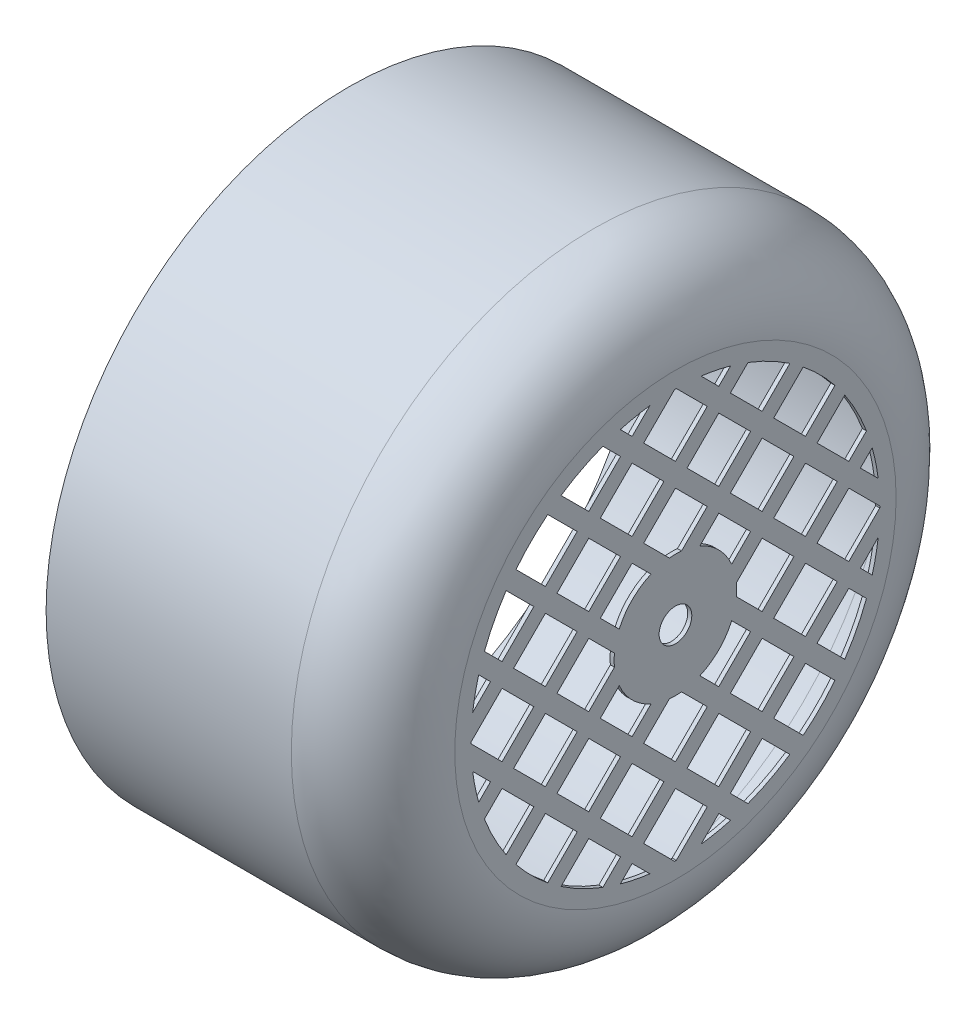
ISO-10303-21;
HEADER;
FILE_DESCRIPTION(('STEP AP214'),'2;1');
FILE_NAME('part.step','',(''),(''),'','','');
FILE_SCHEMA(('AUTOMOTIVE_DESIGN { 1 0 10303 214 1 1 1 1 }'));
ENDSEC;
DATA;
#1=APPLICATION_CONTEXT('core data for automotive mechanical design processes');
#2=APPLICATION_PROTOCOL_DEFINITION('international standard','automotive_design',2000,#1);
#3=PRODUCT_CONTEXT('',#1,'mechanical');
#4=PRODUCT('Part','Part','',(#3));
#5=PRODUCT_RELATED_PRODUCT_CATEGORY('part','',(#4));
#6=PRODUCT_DEFINITION_FORMATION('','',#4);
#7=PRODUCT_DEFINITION_CONTEXT('part definition',#1,'design');
#8=PRODUCT_DEFINITION('design','',#6,#7);
#9=PRODUCT_DEFINITION_SHAPE('','',#8);
#10=(LENGTH_UNIT() NAMED_UNIT(*) SI_UNIT(.MILLI.,.METRE.));
#11=(NAMED_UNIT(*) PLANE_ANGLE_UNIT() SI_UNIT($,.RADIAN.));
#12=(NAMED_UNIT(*) SI_UNIT($,.STERADIAN.) SOLID_ANGLE_UNIT());
#13=UNCERTAINTY_MEASURE_WITH_UNIT(LENGTH_MEASURE(1.E-05),#10,'distance_accuracy_value','');
#14=(GEOMETRIC_REPRESENTATION_CONTEXT(3) GLOBAL_UNCERTAINTY_ASSIGNED_CONTEXT((#13)) GLOBAL_UNIT_ASSIGNED_CONTEXT((#10,
#11,#12)) REPRESENTATION_CONTEXT('',''));
#15=CARTESIAN_POINT('',(0.,0.,0.));
#16=DIRECTION('',(0.,0.,1.));
#17=DIRECTION('',(1.,0.,0.));
#18=AXIS2_PLACEMENT_3D('',#15,#16,#17);
#19=CARTESIAN_POINT('',(0.,-28.337830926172,62.9860632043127));
#20=DIRECTION('',(0.,0.707106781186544,0.707106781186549));
#21=DIRECTION('',(0.,-0.707106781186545,0.70710678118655));
#22=AXIS2_PLACEMENT_3D('',#19,#20,#21);
#23=PLANE('',#22);
#24=DIRECTION('',(0.,-0.707106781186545,0.70710678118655));
#25=VECTOR('',#24,1.);
#26=CARTESIAN_POINT('',(-1.,17.3241161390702,17.3241161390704));
#27=LINE('',#26,#25);
#28=CARTESIAN_POINT('',(-1.,-2.04509570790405E-13,34.6482322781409));
#29=VERTEX_POINT('',#28);
#30=CARTESIAN_POINT('',(-1.,-7.77817459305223,42.426406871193));
#31=VERTEX_POINT('',#30);
#32=EDGE_CURVE('E1101',#29,#31,#27,.T.);
#33=ORIENTED_EDGE('',*,*,#32,.T.);
#34=DIRECTION('',(1.,0.,0.));
#35=VECTOR('',#34,1.);
#36=CARTESIAN_POINT('',(0.,-7.77817459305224,42.426406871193));
#37=LINE('',#36,#35);
#38=CARTESIAN_POINT('',(0.,-7.77817459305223,42.426406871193));
#39=VERTEX_POINT('',#38);
#40=EDGE_CURVE('E1109',#31,#39,#37,.T.);
#41=ORIENTED_EDGE('',*,*,#40,.T.);
#42=DIRECTION('',(0.,-0.707106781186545,0.70710678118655));
#43=VECTOR('',#42,1.);
#44=CARTESIAN_POINT('',(0.,-28.337830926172,62.9860632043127));
#45=LINE('',#44,#43);
#46=CARTESIAN_POINT('',(0.,-2.04509570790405E-13,34.6482322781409));
#47=VERTEX_POINT('',#46);
#48=EDGE_CURVE('E1932',#39,#47,#45,.F.);
#49=ORIENTED_EDGE('',*,*,#48,.T.);
#50=DIRECTION('',(-1.,0.,0.));
#51=VECTOR('',#50,1.);
#52=CARTESIAN_POINT('',(0.,-2.11448464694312E-13,34.6482322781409));
#53=LINE('',#52,#51);
#54=EDGE_CURVE('E1115',#47,#29,#53,.T.);
#55=ORIENTED_EDGE('',*,*,#54,.T.);
#56=EDGE_LOOP('',(#33,#41,#49,#55));
#57=FACE_BOUND('',#56,.T.);
#58=ADVANCED_FACE('F27',(#57),#23,.T.);
#59=CARTESIAN_POINT('',(0.,-31.1662580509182,60.1576360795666));
#60=DIRECTION('',(0.,0.707106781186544,0.707106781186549));
#61=DIRECTION('',(0.,-0.707106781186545,0.70710678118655));
#62=AXIS2_PLACEMENT_3D('',#59,#60,#61);
#63=PLANE('',#62);
#64=DIRECTION('',(1.,0.,0.));
#65=VECTOR('',#64,1.);
#66=CARTESIAN_POINT('',(0.,-10.6066017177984,39.5979797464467));
#67=LINE('',#66,#65);
#68=CARTESIAN_POINT('',(-1.,-10.6066017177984,39.5979797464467));
#69=VERTEX_POINT('',#68);
#70=CARTESIAN_POINT('',(0.,-10.6066017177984,39.5979797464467));
#71=VERTEX_POINT('',#70);
#72=EDGE_CURVE('E1154',#69,#71,#67,.T.);
#73=ORIENTED_EDGE('',*,*,#72,.F.);
#74=DIRECTION('',(0.,-0.707106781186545,0.70710678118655));
#75=VECTOR('',#74,1.);
#76=CARTESIAN_POINT('',(-1.,14.4956890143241,14.4956890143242));
#77=LINE('',#76,#75);
#78=CARTESIAN_POINT('',(-1.,-2.82842712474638,31.8198051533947));
#79=VERTEX_POINT('',#78);
#80=EDGE_CURVE('E2543',#79,#69,#77,.T.);
#81=ORIENTED_EDGE('',*,*,#80,.F.);
#82=DIRECTION('',(-1.,0.,0.));
#83=VECTOR('',#82,1.);
#84=CARTESIAN_POINT('',(0.,-2.82842712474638,31.8198051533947));
#85=LINE('',#84,#83);
#86=CARTESIAN_POINT('',(0.,-2.82842712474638,31.8198051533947));
#87=VERTEX_POINT('',#86);
#88=EDGE_CURVE('E1414',#87,#79,#85,.T.);
#89=ORIENTED_EDGE('',*,*,#88,.F.);
#90=DIRECTION('',(0.,-0.707106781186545,0.70710678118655));
#91=VECTOR('',#90,1.);
#92=CARTESIAN_POINT('',(0.,-31.1662580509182,60.1576360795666));
#93=LINE('',#92,#91);
#94=EDGE_CURVE('E1927',#71,#87,#93,.F.);
#95=ORIENTED_EDGE('',*,*,#94,.F.);
#96=EDGE_LOOP('',(#73,#81,#89,#95));
#97=FACE_BOUND('',#96,.T.);
#98=ADVANCED_FACE('F2542',(#97),#63,.F.);
#99=CARTESIAN_POINT('',(0.,-57.5672791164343,28.5759010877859));
#100=DIRECTION('',(0.,0.707106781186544,0.707106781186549));
#101=DIRECTION('',(0.,-0.707106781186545,0.70710678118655));
#102=AXIS2_PLACEMENT_3D('',#99,#100,#101);
#103=PLANE('',#102);
#104=DIRECTION('',(0.,-0.707106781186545,0.70710678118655));
#105=VECTOR('',#104,1.);
#106=CARTESIAN_POINT('',(-1.,-14.4956890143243,-14.4956890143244));
#107=LINE('',#106,#105);
#108=CARTESIAN_POINT('',(-1.,-31.8198051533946,2.82842712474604));
#109=VERTEX_POINT('',#108);
#110=CARTESIAN_POINT('',(-1.,-39.5979797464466,10.6066017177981));
#111=VERTEX_POINT('',#110);
#112=EDGE_CURVE('E4028',#109,#111,#107,.T.);
#113=ORIENTED_EDGE('',*,*,#112,.T.);
#114=DIRECTION('',(1.,0.,0.));
#115=VECTOR('',#114,1.);
#116=CARTESIAN_POINT('',(0.,-39.5979797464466,10.6066017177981));
#117=LINE('',#116,#115);
#118=CARTESIAN_POINT('',(0.,-39.5979797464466,10.6066017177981));
#119=VERTEX_POINT('',#118);
#120=EDGE_CURVE('E1140',#111,#119,#117,.T.);
#121=ORIENTED_EDGE('',*,*,#120,.T.);
#122=DIRECTION('',(0.,-0.707106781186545,0.70710678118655));
#123=VECTOR('',#122,1.);
#124=CARTESIAN_POINT('',(0.,-57.5672791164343,28.5759010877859));
#125=LINE('',#124,#123);
#126=CARTESIAN_POINT('',(0.,-31.8198051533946,2.82842712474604));
#127=VERTEX_POINT('',#126);
#128=EDGE_CURVE('E1735',#119,#127,#125,.F.);
#129=ORIENTED_EDGE('',*,*,#128,.T.);
#130=DIRECTION('',(-1.,0.,0.));
#131=VECTOR('',#130,1.);
#132=CARTESIAN_POINT('',(0.,-31.8198051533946,2.82842712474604));
#133=LINE('',#132,#131);
#134=EDGE_CURVE('E1398',#127,#109,#133,.T.);
#135=ORIENTED_EDGE('',*,*,#134,.T.);
#136=EDGE_LOOP('',(#113,#121,#129,#135));
#137=FACE_BOUND('',#136,.T.);
#138=ADVANCED_FACE('F2630',(#137),#103,.T.);
#139=CARTESIAN_POINT('',(0.,-60.3957062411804,25.7474739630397));
#140=DIRECTION('',(0.,0.707106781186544,0.707106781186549));
#141=DIRECTION('',(0.,-0.707106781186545,0.70710678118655));
#142=AXIS2_PLACEMENT_3D('',#139,#140,#141);
#143=PLANE('',#142);
#144=DIRECTION('',(1.,0.,0.));
#145=VECTOR('',#144,1.);
#146=CARTESIAN_POINT('',(0.,-42.4264068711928,7.77817459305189));
#147=LINE('',#146,#145);
#148=CARTESIAN_POINT('',(-1.,-42.4264068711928,7.77817459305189));
#149=VERTEX_POINT('',#148);
#150=CARTESIAN_POINT('',(0.,-42.4264068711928,7.77817459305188));
#151=VERTEX_POINT('',#150);
#152=EDGE_CURVE('E1132',#149,#151,#147,.T.);
#153=ORIENTED_EDGE('',*,*,#152,.F.);
#154=DIRECTION('',(0.,-0.707106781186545,0.70710678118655));
#155=VECTOR('',#154,1.);
#156=CARTESIAN_POINT('',(-1.,-17.3241161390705,-17.3241161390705));
#157=LINE('',#156,#155);
#158=CARTESIAN_POINT('',(-1.,-34.6482322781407,-1.76366663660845E-13));
#159=VERTEX_POINT('',#158);
#160=EDGE_CURVE('E2736',#159,#149,#157,.T.);
#161=ORIENTED_EDGE('',*,*,#160,.F.);
#162=DIRECTION('',(-1.,0.,0.));
#163=VECTOR('',#162,1.);
#164=CARTESIAN_POINT('',(0.,-34.6482322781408,-1.69753030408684E-13));
#165=LINE('',#164,#163);
#166=CARTESIAN_POINT('',(0.,-34.6482322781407,-1.76366663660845E-13));
#167=VERTEX_POINT('',#166);
#168=EDGE_CURVE('E1417',#167,#159,#165,.T.);
#169=ORIENTED_EDGE('',*,*,#168,.F.);
#170=DIRECTION('',(0.,-0.707106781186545,0.70710678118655));
#171=VECTOR('',#170,1.);
#172=CARTESIAN_POINT('',(0.,-60.3957062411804,25.7474739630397));
#173=LINE('',#172,#171);
#174=EDGE_CURVE('E1730',#151,#167,#173,.F.);
#175=ORIENTED_EDGE('',*,*,#174,.F.);
#176=EDGE_LOOP('',(#153,#161,#169,#175));
#177=FACE_BOUND('',#176,.T.);
#178=ADVANCED_FACE('F3014',(#177),#143,.F.);
#179=CARTESIAN_POINT('',(0.,-42.0676454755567,55.5026743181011));
#180=DIRECTION('',(0.,0.707106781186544,0.707106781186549));
#181=DIRECTION('',(0.,-0.707106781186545,0.70710678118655));
#182=AXIS2_PLACEMENT_3D('',#179,#180,#181);
#183=PLANE('',#182);
#184=DIRECTION('',(0.,-0.707106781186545,0.70710678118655));
#185=VECTOR('',#184,1.);
#186=CARTESIAN_POINT('',(-1.,6.71751442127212,6.71751442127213));
#187=LINE('',#186,#185);
#188=CARTESIAN_POINT('',(-1.,-10.6066017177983,24.0416305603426));
#189=VERTEX_POINT('',#188);
#190=CARTESIAN_POINT('',(-1.,-18.3847763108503,31.8198051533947));
#191=VERTEX_POINT('',#190);
#192=EDGE_CURVE('E2775',#189,#191,#187,.T.);
#193=ORIENTED_EDGE('',*,*,#192,.T.);
#194=DIRECTION('',(1.,0.,0.));
#195=VECTOR('',#194,1.);
#196=CARTESIAN_POINT('',(0.,-18.3847763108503,31.8198051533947));
#197=LINE('',#196,#195);
#198=CARTESIAN_POINT('',(0.,-18.3847763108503,31.8198051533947));
#199=VERTEX_POINT('',#198);
#200=EDGE_CURVE('E1149',#191,#199,#197,.T.);
#201=ORIENTED_EDGE('',*,*,#200,.T.);
#202=DIRECTION('',(0.,-0.707106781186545,0.70710678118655));
#203=VECTOR('',#202,1.);
#204=CARTESIAN_POINT('',(0.,-42.0676454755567,55.5026743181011));
#205=LINE('',#204,#203);
#206=CARTESIAN_POINT('',(0.,-10.6066017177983,24.0416305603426));
#207=VERTEX_POINT('',#206);
#208=EDGE_CURVE('E1884',#199,#207,#205,.F.);
#209=ORIENTED_EDGE('',*,*,#208,.T.);
#210=DIRECTION('',(-1.,0.,0.));
#211=VECTOR('',#210,1.);
#212=CARTESIAN_POINT('',(0.,-10.6066017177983,24.0416305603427));
#213=LINE('',#212,#211);
#214=EDGE_CURVE('E1409',#207,#189,#213,.T.);
#215=ORIENTED_EDGE('',*,*,#214,.T.);
#216=EDGE_LOOP('',(#193,#201,#209,#215));
#217=FACE_BOUND('',#216,.T.);
#218=ADVANCED_FACE('F3004',(#217),#183,.T.);
#219=CARTESIAN_POINT('',(0.,-44.8960726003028,52.674247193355));
#220=DIRECTION('',(0.,0.707106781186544,0.707106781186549));
#221=DIRECTION('',(0.,-0.707106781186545,0.70710678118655));
#222=AXIS2_PLACEMENT_3D('',#219,#220,#221);
#223=PLANE('',#222);
#224=DIRECTION('',(1.,0.,0.));
#225=VECTOR('',#224,1.);
#226=CARTESIAN_POINT('',(0.,-21.2132034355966,28.9913780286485));
#227=LINE('',#226,#225);
#228=CARTESIAN_POINT('',(-1.,-21.2132034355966,28.9913780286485));
#229=VERTEX_POINT('',#228);
#230=CARTESIAN_POINT('',(0.,-21.2132034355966,28.9913780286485));
#231=VERTEX_POINT('',#230);
#232=EDGE_CURVE('E1147',#229,#231,#227,.T.);
#233=ORIENTED_EDGE('',*,*,#232,.F.);
#234=DIRECTION('',(0.,-0.707106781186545,0.70710678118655));
#235=VECTOR('',#234,1.);
#236=CARTESIAN_POINT('',(-1.,3.88908729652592,3.88908729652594));
#237=LINE('',#236,#235);
#238=CARTESIAN_POINT('',(-1.,-13.4350288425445,21.2132034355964));
#239=VERTEX_POINT('',#238);
#240=EDGE_CURVE('E4080',#239,#229,#237,.T.);
#241=ORIENTED_EDGE('',*,*,#240,.F.);
#242=DIRECTION('',(-1.,0.,0.));
#243=VECTOR('',#242,1.);
#244=CARTESIAN_POINT('',(0.,-13.4350288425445,21.2132034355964));
#245=LINE('',#244,#243);
#246=CARTESIAN_POINT('',(0.,-13.4350288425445,21.2132034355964));
#247=VERTEX_POINT('',#246);
#248=EDGE_CURVE('E1406',#247,#239,#245,.T.);
#249=ORIENTED_EDGE('',*,*,#248,.F.);
#250=DIRECTION('',(0.,-0.707106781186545,0.70710678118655));
#251=VECTOR('',#250,1.);
#252=CARTESIAN_POINT('',(0.,-44.8960726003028,52.674247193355));
#253=LINE('',#252,#251);
#254=EDGE_CURVE('E1878',#231,#247,#253,.F.);
#255=ORIENTED_EDGE('',*,*,#254,.F.);
#256=EDGE_LOOP('',(#233,#241,#249,#255));
#257=FACE_BOUND('',#256,.T.);
#258=ADVANCED_FACE('F3011',(#257),#223,.F.);
#259=CARTESIAN_POINT('',(0.,-51.8277924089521,44.0496178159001));
#260=DIRECTION('',(0.,0.707106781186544,0.707106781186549));
#261=DIRECTION('',(0.,-0.707106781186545,0.70710678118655));
#262=AXIS2_PLACEMENT_3D('',#259,#260,#261);
#263=PLANE('',#262);
#264=DIRECTION('',(0.,-0.707106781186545,0.70710678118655));
#265=VECTOR('',#264,1.);
#266=CARTESIAN_POINT('',(-1.,-3.88908729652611,-3.88908729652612));
#267=LINE('',#266,#265);
#268=CARTESIAN_POINT('',(-1.,-21.2132034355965,13.4350288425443));
#269=VERTEX_POINT('',#268);
#270=CARTESIAN_POINT('',(-1.,-28.9913780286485,21.2132034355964));
#271=VERTEX_POINT('',#270);
#272=EDGE_CURVE('E4078',#269,#271,#267,.T.);
#273=ORIENTED_EDGE('',*,*,#272,.T.);
#274=DIRECTION('',(1.,0.,0.));
#275=VECTOR('',#274,1.);
#276=CARTESIAN_POINT('',(0.,-28.9913780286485,21.2132034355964));
#277=LINE('',#276,#275);
#278=CARTESIAN_POINT('',(0.,-28.9913780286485,21.2132034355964));
#279=VERTEX_POINT('',#278);
#280=EDGE_CURVE('E1142',#271,#279,#277,.T.);
#281=ORIENTED_EDGE('',*,*,#280,.T.);
#282=DIRECTION('',(0.,-0.707106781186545,0.70710678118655));
#283=VECTOR('',#282,1.);
#284=CARTESIAN_POINT('',(0.,-51.8277924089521,44.0496178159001));
#285=LINE('',#284,#283);
#286=CARTESIAN_POINT('',(0.,-21.2132034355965,13.4350288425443));
#287=VERTEX_POINT('',#286);
#288=EDGE_CURVE('E1809',#279,#287,#285,.F.);
#289=ORIENTED_EDGE('',*,*,#288,.T.);
#290=DIRECTION('',(-1.,0.,0.));
#291=VECTOR('',#290,1.);
#292=CARTESIAN_POINT('',(0.,-21.2132034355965,13.4350288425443));
#293=LINE('',#292,#291);
#294=EDGE_CURVE('E1401',#287,#269,#293,.T.);
#295=ORIENTED_EDGE('',*,*,#294,.T.);
#296=EDGE_LOOP('',(#273,#281,#289,#295));
#297=FACE_BOUND('',#296,.T.);
#298=ADVANCED_FACE('F3020',(#297),#263,.T.);
#299=CARTESIAN_POINT('',(0.,-54.6562195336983,41.2211906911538));
#300=DIRECTION('',(0.,0.707106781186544,0.707106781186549));
#301=DIRECTION('',(0.,-0.707106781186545,0.70710678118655));
#302=AXIS2_PLACEMENT_3D('',#299,#300,#301);
#303=PLANE('',#302);
#304=DIRECTION('',(1.,0.,0.));
#305=VECTOR('',#304,1.);
#306=CARTESIAN_POINT('',(0.,-31.8198051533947,18.3847763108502));
#307=LINE('',#306,#305);
#308=CARTESIAN_POINT('',(-1.,-31.8198051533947,18.3847763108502));
#309=VERTEX_POINT('',#308);
#310=CARTESIAN_POINT('',(0.,-31.8198051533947,18.3847763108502));
#311=VERTEX_POINT('',#310);
#312=EDGE_CURVE('E1135',#309,#311,#307,.T.);
#313=ORIENTED_EDGE('',*,*,#312,.F.);
#314=DIRECTION('',(0.,-0.707106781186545,0.70710678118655));
#315=VECTOR('',#314,1.);
#316=CARTESIAN_POINT('',(-1.,-6.71751442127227,-6.71751442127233));
#317=LINE('',#316,#315);
#318=CARTESIAN_POINT('',(-1.,-24.0416305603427,10.6066017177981));
#319=VERTEX_POINT('',#318);
#320=EDGE_CURVE('E4016',#319,#309,#317,.T.);
#321=ORIENTED_EDGE('',*,*,#320,.F.);
#322=DIRECTION('',(-1.,0.,0.));
#323=VECTOR('',#322,1.);
#324=CARTESIAN_POINT('',(0.,-24.0416305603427,10.6066017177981));
#325=LINE('',#324,#323);
#326=CARTESIAN_POINT('',(0.,-24.0416305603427,10.6066017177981));
#327=VERTEX_POINT('',#326);
#328=EDGE_CURVE('E2013',#327,#319,#325,.T.);
#329=ORIENTED_EDGE('',*,*,#328,.F.);
#330=DIRECTION('',(0.,-0.707106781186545,0.70710678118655));
#331=VECTOR('',#330,1.);
#332=CARTESIAN_POINT('',(0.,-54.6562195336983,41.2211906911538));
#333=LINE('',#332,#331);
#334=EDGE_CURVE('E1803',#311,#327,#333,.F.);
#335=ORIENTED_EDGE('',*,*,#334,.F.);
#336=EDGE_LOOP('',(#313,#321,#329,#335));
#337=FACE_BOUND('',#336,.T.);
#338=ADVANCED_FACE('F3062',(#337),#303,.F.);
#339=CARTESIAN_POINT('',(-1.,0.,0.));
#340=DIRECTION('',(1.,0.,0.));
#341=DIRECTION('',(0.,0.,-1.));
#342=AXIS2_PLACEMENT_3D('',#339,#340,#341);
#343=CYLINDRICAL_SURFACE('',#342,50.);
#344=DIRECTION('',(1.,0.,0.));
#345=VECTOR('',#344,1.);
#346=CARTESIAN_POINT('',(-1.,-49.9995797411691,0.205001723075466));
#347=LINE('',#346,#345);
#348=CARTESIAN_POINT('',(0.,-49.9995797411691,0.205001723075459));
#349=VERTEX_POINT('',#348);
#350=CARTESIAN_POINT('',(-1.,-49.9995797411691,0.205001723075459));
#351=VERTEX_POINT('',#350);
#352=EDGE_CURVE('E1124',#349,#351,#347,.F.);
#353=ORIENTED_EDGE('',*,*,#352,.F.);
#354=CARTESIAN_POINT('',(0.,0.,0.));
#355=DIRECTION('',(1.,0.,0.));
#356=DIRECTION('',(0.,0.,-1.));
#357=AXIS2_PLACEMENT_3D('',#354,#355,#356);
#358=CIRCLE('',#357,50.);
#359=CARTESIAN_POINT('',(0.,-49.9995797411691,-0.205001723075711));
#360=VERTEX_POINT('',#359);
#361=EDGE_CURVE('E1964',#349,#360,#358,.T.);
#362=ORIENTED_EDGE('',*,*,#361,.T.);
#363=DIRECTION('',(1.,0.,0.));
#364=VECTOR('',#363,1.);
#365=CARTESIAN_POINT('',(-1.,-49.9995797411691,-0.205001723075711));
#366=LINE('',#365,#364);
#367=CARTESIAN_POINT('',(-1.,-49.999579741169,-0.205001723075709));
#368=VERTEX_POINT('',#367);
#369=EDGE_CURVE('E1775',#368,#360,#366,.T.);
#370=ORIENTED_EDGE('',*,*,#369,.F.);
#371=CARTESIAN_POINT('',(-1.,0.,0.));
#372=DIRECTION('',(1.,0.,0.));
#373=DIRECTION('',(0.,0.,-1.));
#374=AXIS2_PLACEMENT_3D('',#371,#372,#373);
#375=CIRCLE('',#374,50.);
#376=EDGE_CURVE('E1970',#351,#368,#375,.T.);
#377=ORIENTED_EDGE('',*,*,#376,.F.);
#378=EDGE_LOOP('',(#353,#362,#370,#377));
#379=FACE_BOUND('',#378,.T.);
#380=ADVANCED_FACE('F2573',(#379),#343,.F.);
#381=DIRECTION('',(1.,0.,0.));
#382=VECTOR('',#381,1.);
#383=CARTESIAN_POINT('',(-1.,-0.205001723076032,49.9995797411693));
#384=LINE('',#383,#382);
#385=CARTESIAN_POINT('',(-1.,-0.205001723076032,49.9995797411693));
#386=VERTEX_POINT('',#385);
#387=CARTESIAN_POINT('',(0.,-0.205001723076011,49.9995797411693));
#388=VERTEX_POINT('',#387);
#389=EDGE_CURVE('E31',#386,#388,#384,.T.);
#390=ORIENTED_EDGE('',*,*,#389,.F.);
#391=CARTESIAN_POINT('',(-1.,0.205001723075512,49.9995797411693));
#392=VERTEX_POINT('',#391);
#393=EDGE_CURVE('E1104',#392,#386,#375,.T.);
#394=ORIENTED_EDGE('',*,*,#393,.F.);
#395=DIRECTION('',(1.,0.,0.));
#396=VECTOR('',#395,1.);
#397=CARTESIAN_POINT('',(-1.,0.205001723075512,49.9995797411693));
#398=LINE('',#397,#396);
#399=CARTESIAN_POINT('',(0.,0.205001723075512,49.9995797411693));
#400=VERTEX_POINT('',#399);
#401=EDGE_CURVE('E1866',#392,#400,#398,.T.);
#402=ORIENTED_EDGE('',*,*,#401,.T.);
#403=EDGE_CURVE('E2120',#400,#388,#358,.T.);
#404=ORIENTED_EDGE('',*,*,#403,.T.);
#405=EDGE_LOOP('',(#390,#394,#402,#404));
#406=FACE_BOUND('',#405,.T.);
#407=ADVANCED_FACE('F3056',(#406),#343,.F.);
#408=DIRECTION('',(1.,0.,0.));
#409=VECTOR('',#408,1.);
#410=CARTESIAN_POINT('',(-1.,0.205001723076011,-49.9995797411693));
#411=LINE('',#410,#409);
#412=CARTESIAN_POINT('',(-1.,0.205001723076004,-49.9995797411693));
#413=VERTEX_POINT('',#412);
#414=CARTESIAN_POINT('',(0.,0.205001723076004,-49.9995797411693));
#415=VERTEX_POINT('',#414);
#416=EDGE_CURVE('E1206',#413,#415,#411,.T.);
#417=ORIENTED_EDGE('',*,*,#416,.F.);
#418=CARTESIAN_POINT('',(-1.,-0.205001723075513,-49.9995797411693));
#419=VERTEX_POINT('',#418);
#420=EDGE_CURVE('E2236',#419,#413,#375,.T.);
#421=ORIENTED_EDGE('',*,*,#420,.F.);
#422=DIRECTION('',(1.,0.,0.));
#423=VECTOR('',#422,1.);
#424=CARTESIAN_POINT('',(-1.,-0.205001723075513,-49.9995797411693));
#425=LINE('',#424,#423);
#426=CARTESIAN_POINT('',(0.,-0.205001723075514,-49.9995797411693));
#427=VERTEX_POINT('',#426);
#428=EDGE_CURVE('E1781',#427,#419,#425,.F.);
#429=ORIENTED_EDGE('',*,*,#428,.F.);
#430=EDGE_CURVE('E2135',#427,#415,#358,.T.);
#431=ORIENTED_EDGE('',*,*,#430,.T.);
#432=EDGE_LOOP('',(#417,#421,#429,#431));
#433=FACE_BOUND('',#432,.T.);
#434=ADVANCED_FACE('F2160',(#433),#343,.F.);
#435=DIRECTION('',(1.,0.,0.));
#436=VECTOR('',#435,1.);
#437=CARTESIAN_POINT('',(-1.,49.9995797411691,-0.205001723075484));
#438=LINE('',#437,#436);
#439=CARTESIAN_POINT('',(0.,49.9995797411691,-0.205001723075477));
#440=VERTEX_POINT('',#439);
#441=CARTESIAN_POINT('',(-1.,49.9995797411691,-0.205001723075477));
#442=VERTEX_POINT('',#441);
#443=EDGE_CURVE('E1238',#440,#442,#438,.F.);
#444=ORIENTED_EDGE('',*,*,#443,.F.);
#445=CARTESIAN_POINT('',(0.,49.9995797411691,0.205001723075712));
#446=VERTEX_POINT('',#445);
#447=EDGE_CURVE('E2152',#440,#446,#358,.T.);
#448=ORIENTED_EDGE('',*,*,#447,.T.);
#449=DIRECTION('',(1.,0.,0.));
#450=VECTOR('',#449,1.);
#451=CARTESIAN_POINT('',(-1.,49.9995797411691,0.205001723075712));
#452=LINE('',#451,#450);
#453=CARTESIAN_POINT('',(-1.,49.9995797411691,0.205001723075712));
#454=VERTEX_POINT('',#453);
#455=EDGE_CURVE('E1869',#446,#454,#452,.F.);
#456=ORIENTED_EDGE('',*,*,#455,.T.);
#457=EDGE_CURVE('E2244',#442,#454,#375,.T.);
#458=ORIENTED_EDGE('',*,*,#457,.F.);
#459=EDGE_LOOP('',(#444,#448,#456,#458));
#460=FACE_BOUND('',#459,.T.);
#461=ADVANCED_FACE('F2636',(#460),#343,.F.);
#462=CARTESIAN_POINT('',(0.,34.6482322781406,0.));
#463=VERTEX_POINT('',#462);
#464=CARTESIAN_POINT('',(0.,42.4264068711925,-7.77817459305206));
#465=VERTEX_POINT('',#464);
#466=EDGE_CURVE('E2703',#463,#465,#45,.F.);
#467=ORIENTED_EDGE('',*,*,#466,.T.);
#468=DIRECTION('',(-1.,0.,0.));
#469=VECTOR('',#468,1.);
#470=CARTESIAN_POINT('',(0.,42.4264068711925,-7.77817459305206));
#471=LINE('',#470,#469);
#472=CARTESIAN_POINT('',(-1.,42.4264068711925,-7.77817459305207));
#473=VERTEX_POINT('',#472);
#474=EDGE_CURVE('E1233',#465,#473,#471,.T.);
#475=ORIENTED_EDGE('',*,*,#474,.T.);
#476=CARTESIAN_POINT('',(-1.,34.6482322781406,0.));
#477=VERTEX_POINT('',#476);
#478=EDGE_CURVE('E1989',#473,#477,#27,.T.);
#479=ORIENTED_EDGE('',*,*,#478,.T.);
#480=DIRECTION('',(-1.,0.,0.));
#481=VECTOR('',#480,1.);
#482=CARTESIAN_POINT('',(0.,34.6482322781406,0.));
#483=LINE('',#482,#481);
#484=EDGE_CURVE('E1610',#463,#477,#483,.T.);
#485=ORIENTED_EDGE('',*,*,#484,.F.);
#486=EDGE_LOOP('',(#467,#475,#479,#485));
#487=FACE_BOUND('',#486,.T.);
#488=ADVANCED_FACE('F2625',(#487),#23,.T.);
#489=DIRECTION('',(-1.,0.,0.));
#490=VECTOR('',#489,1.);
#491=CARTESIAN_POINT('',(0.,39.5979797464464,-10.6066017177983));
#492=LINE('',#491,#490);
#493=CARTESIAN_POINT('',(0.,39.5979797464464,-10.6066017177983));
#494=VERTEX_POINT('',#493);
#495=CARTESIAN_POINT('',(-1.,39.5979797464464,-10.6066017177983));
#496=VERTEX_POINT('',#495);
#497=EDGE_CURVE('E1230',#494,#496,#492,.T.);
#498=ORIENTED_EDGE('',*,*,#497,.F.);
#499=CARTESIAN_POINT('',(0.,31.8198051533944,-2.82842712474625));
#500=VERTEX_POINT('',#499);
#501=EDGE_CURVE('E2523',#500,#494,#93,.F.);
#502=ORIENTED_EDGE('',*,*,#501,.F.);
#503=DIRECTION('',(-1.,0.,0.));
#504=VECTOR('',#503,1.);
#505=CARTESIAN_POINT('',(0.,31.8198051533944,-2.82842712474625));
#506=LINE('',#505,#504);
#507=CARTESIAN_POINT('',(-1.,31.8198051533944,-2.82842712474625));
#508=VERTEX_POINT('',#507);
#509=EDGE_CURVE('E1619',#500,#508,#506,.T.);
#510=ORIENTED_EDGE('',*,*,#509,.T.);
#511=EDGE_CURVE('E1983',#496,#508,#77,.T.);
#512=ORIENTED_EDGE('',*,*,#511,.F.);
#513=EDGE_LOOP('',(#498,#502,#510,#512));
#514=FACE_BOUND('',#513,.T.);
#515=ADVANCED_FACE('F2632',(#514),#63,.F.);
#516=CARTESIAN_POINT('',(0.,24.0416305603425,-10.6066017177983));
#517=VERTEX_POINT('',#516);
#518=CARTESIAN_POINT('',(0.,31.8198051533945,-18.3847763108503));
#519=VERTEX_POINT('',#518);
#520=EDGE_CURVE('E1883',#517,#519,#205,.F.);
#521=ORIENTED_EDGE('',*,*,#520,.T.);
#522=DIRECTION('',(-1.,0.,0.));
#523=VECTOR('',#522,1.);
#524=CARTESIAN_POINT('',(0.,31.8198051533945,-18.3847763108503));
#525=LINE('',#524,#523);
#526=CARTESIAN_POINT('',(-1.,31.8198051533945,-18.3847763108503));
#527=VERTEX_POINT('',#526);
#528=EDGE_CURVE('E1225',#519,#527,#525,.T.);
#529=ORIENTED_EDGE('',*,*,#528,.T.);
#530=CARTESIAN_POINT('',(-1.,24.0416305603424,-10.6066017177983));
#531=VERTEX_POINT('',#530);
#532=EDGE_CURVE('E1911',#527,#531,#187,.T.);
#533=ORIENTED_EDGE('',*,*,#532,.T.);
#534=DIRECTION('',(-1.,0.,0.));
#535=VECTOR('',#534,1.);
#536=CARTESIAN_POINT('',(0.,24.0416305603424,-10.6066017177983));
#537=LINE('',#536,#535);
#538=EDGE_CURVE('E1613',#517,#531,#537,.T.);
#539=ORIENTED_EDGE('',*,*,#538,.F.);
#540=EDGE_LOOP('',(#521,#529,#533,#539));
#541=FACE_BOUND('',#540,.T.);
#542=ADVANCED_FACE('F2994',(#541),#183,.T.);
#543=DIRECTION('',(-1.,0.,0.));
#544=VECTOR('',#543,1.);
#545=CARTESIAN_POINT('',(0.,28.9913780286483,-21.2132034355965));
#546=LINE('',#545,#544);
#547=CARTESIAN_POINT('',(0.,28.9913780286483,-21.2132034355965));
#548=VERTEX_POINT('',#547);
#549=CARTESIAN_POINT('',(-1.,28.9913780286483,-21.2132034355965));
#550=VERTEX_POINT('',#549);
#551=EDGE_CURVE('E1222',#548,#550,#546,.T.);
#552=ORIENTED_EDGE('',*,*,#551,.F.);
#553=CARTESIAN_POINT('',(0.,21.2132034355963,-13.4350288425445));
#554=VERTEX_POINT('',#553);
#555=EDGE_CURVE('E1877',#554,#548,#253,.F.);
#556=ORIENTED_EDGE('',*,*,#555,.F.);
#557=DIRECTION('',(-1.,0.,0.));
#558=VECTOR('',#557,1.);
#559=CARTESIAN_POINT('',(0.,21.2132034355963,-13.4350288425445));
#560=LINE('',#559,#558);
#561=CARTESIAN_POINT('',(-1.,21.2132034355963,-13.4350288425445));
#562=VERTEX_POINT('',#561);
#563=EDGE_CURVE('E1593',#554,#562,#560,.T.);
#564=ORIENTED_EDGE('',*,*,#563,.T.);
#565=EDGE_CURVE('E1893',#550,#562,#237,.T.);
#566=ORIENTED_EDGE('',*,*,#565,.F.);
#567=EDGE_LOOP('',(#552,#556,#564,#566));
#568=FACE_BOUND('',#567,.T.);
#569=ADVANCED_FACE('F3000',(#568),#223,.F.);
#570=CARTESIAN_POINT('',(0.,13.4350288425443,-21.2132034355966));
#571=VERTEX_POINT('',#570);
#572=CARTESIAN_POINT('',(0.,21.2132034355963,-28.9913780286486));
#573=VERTEX_POINT('',#572);
#574=EDGE_CURVE('E1808',#571,#573,#285,.F.);
#575=ORIENTED_EDGE('',*,*,#574,.T.);
#576=DIRECTION('',(-1.,0.,0.));
#577=VECTOR('',#576,1.);
#578=CARTESIAN_POINT('',(0.,21.2132034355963,-28.9913780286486));
#579=LINE('',#578,#577);
#580=CARTESIAN_POINT('',(-1.,21.2132034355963,-28.9913780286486));
#581=VERTEX_POINT('',#580);
#582=EDGE_CURVE('E1217',#573,#581,#579,.T.);
#583=ORIENTED_EDGE('',*,*,#582,.T.);
#584=CARTESIAN_POINT('',(-1.,13.4350288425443,-21.2132034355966));
#585=VERTEX_POINT('',#584);
#586=EDGE_CURVE('E1836',#581,#585,#267,.T.);
#587=ORIENTED_EDGE('',*,*,#586,.T.);
#588=DIRECTION('',(-1.,0.,0.));
#589=VECTOR('',#588,1.);
#590=CARTESIAN_POINT('',(0.,13.4350288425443,-21.2132034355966));
#591=LINE('',#590,#589);
#592=EDGE_CURVE('E1587',#571,#585,#591,.T.);
#593=ORIENTED_EDGE('',*,*,#592,.F.);
#594=EDGE_LOOP('',(#575,#583,#587,#593));
#595=FACE_BOUND('',#594,.T.);
#596=ADVANCED_FACE('F3009',(#595),#263,.T.);
#597=DIRECTION('',(-1.,0.,0.));
#598=VECTOR('',#597,1.);
#599=CARTESIAN_POINT('',(0.,18.3847763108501,-31.8198051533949));
#600=LINE('',#599,#598);
#601=CARTESIAN_POINT('',(0.,18.3847763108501,-31.8198051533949));
#602=VERTEX_POINT('',#601);
#603=CARTESIAN_POINT('',(-1.,18.3847763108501,-31.8198051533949));
#604=VERTEX_POINT('',#603);
#605=EDGE_CURVE('E1214',#602,#604,#600,.T.);
#606=ORIENTED_EDGE('',*,*,#605,.F.);
#607=CARTESIAN_POINT('',(0.,10.6066017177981,-24.0416305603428));
#608=VERTEX_POINT('',#607);
#609=EDGE_CURVE('E1802',#608,#602,#333,.F.);
#610=ORIENTED_EDGE('',*,*,#609,.F.);
#611=DIRECTION('',(-1.,0.,0.));
#612=VECTOR('',#611,1.);
#613=CARTESIAN_POINT('',(0.,10.6066017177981,-24.0416305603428));
#614=LINE('',#613,#612);
#615=CARTESIAN_POINT('',(-1.,10.6066017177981,-24.0416305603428));
#616=VERTEX_POINT('',#615);
#617=EDGE_CURVE('E1576',#608,#616,#614,.T.);
#618=ORIENTED_EDGE('',*,*,#617,.T.);
#619=EDGE_CURVE('E1818',#604,#616,#317,.T.);
#620=ORIENTED_EDGE('',*,*,#619,.F.);
#621=EDGE_LOOP('',(#606,#610,#618,#620));
#622=FACE_BOUND('',#621,.T.);
#623=ADVANCED_FACE('F3393',(#622),#303,.F.);
#624=CARTESIAN_POINT('',(0.,2.82842712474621,-31.8198051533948));
#625=VERTEX_POINT('',#624);
#626=CARTESIAN_POINT('',(0.,10.6066017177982,-39.5979797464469));
#627=VERTEX_POINT('',#626);
#628=EDGE_CURVE('E2358',#625,#627,#125,.F.);
#629=ORIENTED_EDGE('',*,*,#628,.T.);
#630=DIRECTION('',(-1.,0.,0.));
#631=VECTOR('',#630,1.);
#632=CARTESIAN_POINT('',(0.,10.6066017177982,-39.5979797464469));
#633=LINE('',#632,#631);
#634=CARTESIAN_POINT('',(-1.,10.6066017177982,-39.5979797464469));
#635=VERTEX_POINT('',#634);
#636=EDGE_CURVE('E1209',#627,#635,#633,.T.);
#637=ORIENTED_EDGE('',*,*,#636,.T.);
#638=CARTESIAN_POINT('',(-1.,2.8284271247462,-31.8198051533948));
#639=VERTEX_POINT('',#638);
#640=EDGE_CURVE('E1751',#635,#639,#107,.T.);
#641=ORIENTED_EDGE('',*,*,#640,.T.);
#642=DIRECTION('',(-1.,0.,0.));
#643=VECTOR('',#642,1.);
#644=CARTESIAN_POINT('',(0.,2.82842712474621,-31.8198051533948));
#645=LINE('',#644,#643);
#646=EDGE_CURVE('E1570',#625,#639,#645,.T.);
#647=ORIENTED_EDGE('',*,*,#646,.F.);
#648=EDGE_LOOP('',(#629,#637,#641,#647));
#649=FACE_BOUND('',#648,.T.);
#650=ADVANCED_FACE('F3456',(#649),#103,.T.);
#651=DIRECTION('',(-1.,0.,0.));
#652=VECTOR('',#651,1.);
#653=CARTESIAN_POINT('',(0.,7.77817459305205,-42.4264068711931));
#654=LINE('',#653,#652);
#655=CARTESIAN_POINT('',(0.,7.77817459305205,-42.4264068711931));
#656=VERTEX_POINT('',#655);
#657=CARTESIAN_POINT('',(-1.,7.77817459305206,-42.4264068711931));
#658=VERTEX_POINT('',#657);
#659=EDGE_CURVE('E2019',#656,#658,#654,.T.);
#660=ORIENTED_EDGE('',*,*,#659,.F.);
#661=CARTESIAN_POINT('',(0.,0.,-34.6482322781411));
#662=VERTEX_POINT('',#661);
#663=EDGE_CURVE('E2034',#662,#656,#173,.F.);
#664=ORIENTED_EDGE('',*,*,#663,.F.);
#665=DIRECTION('',(-1.,0.,0.));
#666=VECTOR('',#665,1.);
#667=CARTESIAN_POINT('',(0.,0.,-34.6482322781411));
#668=LINE('',#667,#666);
#669=CARTESIAN_POINT('',(-1.,0.,-34.6482322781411));
#670=VERTEX_POINT('',#669);
#671=EDGE_CURVE('E2010',#662,#670,#668,.T.);
#672=ORIENTED_EDGE('',*,*,#671,.T.);
#673=EDGE_CURVE('E1740',#658,#670,#157,.T.);
#674=ORIENTED_EDGE('',*,*,#673,.F.);
#675=EDGE_LOOP('',(#660,#664,#672,#674));
#676=FACE_BOUND('',#675,.T.);
#677=ADVANCED_FACE('F2033',(#676),#143,.F.);
#678=DIRECTION('',(1.,0.,0.));
#679=VECTOR('',#678,1.);
#680=CARTESIAN_POINT('',(-1.,-41.4288238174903,-27.9937949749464));
#681=LINE('',#680,#679);
#682=CARTESIAN_POINT('',(-1.,-41.4288238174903,-27.9937949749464));
#683=VERTEX_POINT('',#682);
#684=CARTESIAN_POINT('',(0.,-41.4288238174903,-27.9937949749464));
#685=VERTEX_POINT('',#684);
#686=EDGE_CURVE('E1312',#683,#685,#681,.T.);
#687=ORIENTED_EDGE('',*,*,#686,.F.);
#688=CARTESIAN_POINT('',(-1.,-46.7427819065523,-17.7514038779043));
#689=VERTEX_POINT('',#688);
#690=EDGE_CURVE('E2245',#689,#683,#375,.T.);
#691=ORIENTED_EDGE('',*,*,#690,.F.);
#692=DIRECTION('',(1.,0.,0.));
#693=VECTOR('',#692,1.);
#694=CARTESIAN_POINT('',(-1.,-46.7427819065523,-17.7514038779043));
#695=LINE('',#694,#693);
#696=CARTESIAN_POINT('',(0.,-46.7427819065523,-17.7514038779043));
#697=VERTEX_POINT('',#696);
#698=EDGE_CURVE('E1484',#689,#697,#695,.T.);
#699=ORIENTED_EDGE('',*,*,#698,.T.);
#700=EDGE_CURVE('E2122',#697,#685,#358,.T.);
#701=ORIENTED_EDGE('',*,*,#700,.T.);
#702=EDGE_LOOP('',(#687,#691,#699,#701));
#703=FACE_BOUND('',#702,.T.);
#704=ADVANCED_FACE('F2833',(#703),#343,.F.);
#705=CARTESIAN_POINT('',(-1.,0.,0.));
#706=DIRECTION('',(1.,0.,0.));
#707=DIRECTION('',(0.,0.,-1.));
#708=AXIS2_PLACEMENT_3D('',#705,#706,#707);
#709=CYLINDRICAL_SURFACE('',#708,15.);
#710=CARTESIAN_POINT('',(-1.,0.,0.));
#711=DIRECTION('',(1.,0.,0.));
#712=DIRECTION('',(0.,0.,-1.));
#713=AXIS2_PLACEMENT_3D('',#710,#711,#712);
#714=CIRCLE('',#713,15.);
#715=CARTESIAN_POINT('',(-1.,-14.9257420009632,1.49071315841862));
#716=VERTEX_POINT('',#715);
#717=CARTESIAN_POINT('',(-1.,-14.9257420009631,-1.49071315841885));
#718=VERTEX_POINT('',#717);
#719=EDGE_CURVE('E1957',#716,#718,#714,.T.);
#720=ORIENTED_EDGE('',*,*,#719,.T.);
#721=DIRECTION('',(1.,0.,0.));
#722=VECTOR('',#721,1.);
#723=CARTESIAN_POINT('',(-1.,-14.9257420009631,-1.49071315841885));
#724=LINE('',#723,#722);
#725=CARTESIAN_POINT('',(0.,-14.9257420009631,-1.49071315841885));
#726=VERTEX_POINT('',#725);
#727=EDGE_CURVE('E1304',#718,#726,#724,.T.);
#728=ORIENTED_EDGE('',*,*,#727,.T.);
#729=CARTESIAN_POINT('',(0.,0.,0.));
#730=DIRECTION('',(1.,0.,0.));
#731=DIRECTION('',(0.,0.,-1.));
#732=AXIS2_PLACEMENT_3D('',#729,#730,#731);
#733=CIRCLE('',#732,15.);
#734=CARTESIAN_POINT('',(0.,-14.9257420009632,1.49071315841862));
#735=VERTEX_POINT('',#734);
#736=EDGE_CURVE('E1950',#735,#726,#733,.T.);
#737=ORIENTED_EDGE('',*,*,#736,.F.);
#738=DIRECTION('',(1.,0.,0.));
#739=VECTOR('',#738,1.);
#740=CARTESIAN_POINT('',(-1.,-14.9257420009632,1.49071315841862));
#741=LINE('',#740,#739);
#742=EDGE_CURVE('E1823',#735,#716,#741,.F.);
#743=ORIENTED_EDGE('',*,*,#742,.T.);
#744=EDGE_LOOP('',(#720,#728,#737,#743));
#745=FACE_BOUND('',#744,.T.);
#746=ADVANCED_FACE('F2649',(#745),#709,.T.);
#747=DIRECTION('',(1.,0.,0.));
#748=VECTOR('',#747,1.);
#749=CARTESIAN_POINT('',(-1.,27.9937949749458,41.4288238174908));
#750=LINE('',#749,#748);
#751=CARTESIAN_POINT('',(0.,27.9937949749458,41.4288238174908));
#752=VERTEX_POINT('',#751);
#753=CARTESIAN_POINT('',(-1.,27.9937949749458,41.4288238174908));
#754=VERTEX_POINT('',#753);
#755=EDGE_CURVE('E1319',#752,#754,#750,.F.);
#756=ORIENTED_EDGE('',*,*,#755,.F.);
#757=CARTESIAN_POINT('',(0.,17.7514038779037,46.7427819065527));
#758=VERTEX_POINT('',#757);
#759=EDGE_CURVE('E2119',#752,#758,#358,.T.);
#760=ORIENTED_EDGE('',*,*,#759,.T.);
#761=DIRECTION('',(1.,0.,0.));
#762=VECTOR('',#761,1.);
#763=CARTESIAN_POINT('',(-1.,17.7514038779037,46.7427819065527));
#764=LINE('',#763,#762);
#765=CARTESIAN_POINT('',(-1.,17.7514038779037,46.7427819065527));
#766=VERTEX_POINT('',#765);
#767=EDGE_CURVE('E1493',#758,#766,#764,.F.);
#768=ORIENTED_EDGE('',*,*,#767,.T.);
#769=EDGE_CURVE('E2254',#754,#766,#375,.T.);
#770=ORIENTED_EDGE('',*,*,#769,.F.);
#771=EDGE_LOOP('',(#756,#760,#768,#770));
#772=FACE_BOUND('',#771,.T.);
#773=ADVANCED_FACE('F2692',(#772),#343,.F.);
#774=CARTESIAN_POINT('',(0.,1.49071315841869,14.9257420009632));
#775=VERTEX_POINT('',#774);
#776=CARTESIAN_POINT('',(0.,-1.49071315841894,14.9257420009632));
#777=VERTEX_POINT('',#776);
#778=EDGE_CURVE('E1949',#775,#777,#733,.T.);
#779=ORIENTED_EDGE('',*,*,#778,.F.);
#780=DIRECTION('',(1.,0.,0.));
#781=VECTOR('',#780,1.);
#782=CARTESIAN_POINT('',(-1.,1.49071315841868,14.9257420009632));
#783=LINE('',#782,#781);
#784=CARTESIAN_POINT('',(-1.,1.49071315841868,14.9257420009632));
#785=VERTEX_POINT('',#784);
#786=EDGE_CURVE('E1334',#775,#785,#783,.F.);
#787=ORIENTED_EDGE('',*,*,#786,.T.);
#788=CARTESIAN_POINT('',(-1.,-1.49071315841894,14.9257420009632));
#789=VERTEX_POINT('',#788);
#790=EDGE_CURVE('E1956',#785,#789,#714,.T.);
#791=ORIENTED_EDGE('',*,*,#790,.T.);
#792=DIRECTION('',(1.,0.,0.));
#793=VECTOR('',#792,1.);
#794=CARTESIAN_POINT('',(-1.,-1.49071315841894,14.9257420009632));
#795=LINE('',#794,#793);
#796=EDGE_CURVE('E1916',#777,#789,#795,.F.);
#797=ORIENTED_EDGE('',*,*,#796,.F.);
#798=EDGE_LOOP('',(#779,#787,#791,#797));
#799=FACE_BOUND('',#798,.T.);
#800=ADVANCED_FACE('F2496',(#799),#709,.T.);
#801=CARTESIAN_POINT('',(0.,2.82842712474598,31.8198051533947));
#802=VERTEX_POINT('',#801);
#803=CARTESIAN_POINT('',(0.,10.606601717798,24.0416305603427));
#804=VERTEX_POINT('',#803);
#805=EDGE_CURVE('E2694',#802,#804,#45,.F.);
#806=ORIENTED_EDGE('',*,*,#805,.T.);
#807=DIRECTION('',(-1.,0.,0.));
#808=VECTOR('',#807,1.);
#809=CARTESIAN_POINT('',(0.,10.606601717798,24.0416305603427));
#810=LINE('',#809,#808);
#811=CARTESIAN_POINT('',(-1.,10.606601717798,24.0416305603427));
#812=VERTEX_POINT('',#811);
#813=EDGE_CURVE('E1326',#804,#812,#810,.T.);
#814=ORIENTED_EDGE('',*,*,#813,.T.);
#815=CARTESIAN_POINT('',(-1.,2.82842712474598,31.8198051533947));
#816=VERTEX_POINT('',#815);
#817=EDGE_CURVE('E1117',#812,#816,#27,.T.);
#818=ORIENTED_EDGE('',*,*,#817,.T.);
#819=DIRECTION('',(-1.,0.,0.));
#820=VECTOR('',#819,1.);
#821=CARTESIAN_POINT('',(0.,2.82842712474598,31.8198051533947));
#822=LINE('',#821,#820);
#823=EDGE_CURVE('E1502',#802,#816,#822,.T.);
#824=ORIENTED_EDGE('',*,*,#823,.F.);
#825=EDGE_LOOP('',(#806,#814,#818,#824));
#826=FACE_BOUND('',#825,.T.);
#827=ADVANCED_FACE('F2638',(#826),#23,.T.);
#828=DIRECTION('',(-1.,0.,0.));
#829=VECTOR('',#828,1.);
#830=CARTESIAN_POINT('',(0.,7.77817459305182,21.2132034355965));
#831=LINE('',#830,#829);
#832=CARTESIAN_POINT('',(0.,7.77817459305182,21.2132034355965));
#833=VERTEX_POINT('',#832);
#834=CARTESIAN_POINT('',(-1.,7.77817459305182,21.2132034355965));
#835=VERTEX_POINT('',#834);
#836=EDGE_CURVE('E1329',#833,#835,#831,.T.);
#837=ORIENTED_EDGE('',*,*,#836,.F.);
#838=CARTESIAN_POINT('',(0.,-1.8504814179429E-13,28.9913780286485));
#839=VERTEX_POINT('',#838);
#840=EDGE_CURVE('E2524',#839,#833,#93,.F.);
#841=ORIENTED_EDGE('',*,*,#840,.F.);
#842=DIRECTION('',(-1.,0.,0.));
#843=VECTOR('',#842,1.);
#844=CARTESIAN_POINT('',(0.,-1.84180780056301E-13,28.9913780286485));
#845=LINE('',#844,#843);
#846=CARTESIAN_POINT('',(-1.,-1.84722881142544E-13,28.9913780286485));
#847=VERTEX_POINT('',#846);
#848=EDGE_CURVE('E1466',#839,#847,#845,.T.);
#849=ORIENTED_EDGE('',*,*,#848,.T.);
#850=EDGE_CURVE('E2784',#835,#847,#77,.T.);
#851=ORIENTED_EDGE('',*,*,#850,.F.);
#852=EDGE_LOOP('',(#837,#841,#849,#851));
#853=FACE_BOUND('',#852,.T.);
#854=ADVANCED_FACE('F2682',(#853),#63,.F.);
#855=CARTESIAN_POINT('',(0.,76.4104090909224,-26.2058276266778));
#856=DIRECTION('',(0.,-0.707106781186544,-0.70710678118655));
#857=DIRECTION('',(0.,0.707106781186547,-0.707106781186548));
#858=AXIS2_PLACEMENT_3D('',#855,#856,#857);
#859=PLANE('',#858);
#860=DIRECTION('',(0.,0.707106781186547,-0.707106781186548));
#861=VECTOR('',#860,1.);
#862=CARTESIAN_POINT('',(-1.,25.1022907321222,25.1022907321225));
#863=LINE('',#862,#861);
#864=CARTESIAN_POINT('',(-1.,10.606601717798,39.5979797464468));
#865=VERTEX_POINT('',#864);
#866=CARTESIAN_POINT('',(-1.,18.3847763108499,31.8198051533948));
#867=VERTEX_POINT('',#866);
#868=EDGE_CURVE('E1995',#865,#867,#863,.T.);
#869=ORIENTED_EDGE('',*,*,#868,.T.);
#870=DIRECTION('',(1.,0.,0.));
#871=VECTOR('',#870,1.);
#872=CARTESIAN_POINT('',(0.,18.3847763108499,31.8198051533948));
#873=LINE('',#872,#871);
#874=CARTESIAN_POINT('',(0.,18.3847763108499,31.8198051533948));
#875=VERTEX_POINT('',#874);
#876=EDGE_CURVE('E1322',#867,#875,#873,.T.);
#877=ORIENTED_EDGE('',*,*,#876,.T.);
#878=DIRECTION('',(0.,0.707106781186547,-0.707106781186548));
#879=VECTOR('',#878,1.);
#880=CARTESIAN_POINT('',(0.,76.4104090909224,-26.2058276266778));
#881=LINE('',#880,#879);
#882=CARTESIAN_POINT('',(0.,10.606601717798,39.5979797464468));
#883=VERTEX_POINT('',#882);
#884=EDGE_CURVE('E1859',#875,#883,#881,.F.);
#885=ORIENTED_EDGE('',*,*,#884,.T.);
#886=DIRECTION('',(1.,0.,0.));
#887=VECTOR('',#886,1.);
#888=CARTESIAN_POINT('',(0.,10.606601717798,39.5979797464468));
#889=LINE('',#888,#887);
#890=EDGE_CURVE('E1496',#865,#883,#889,.T.);
#891=ORIENTED_EDGE('',*,*,#890,.F.);
#892=EDGE_LOOP('',(#869,#877,#885,#891));
#893=FACE_BOUND('',#892,.T.);
#894=ADVANCED_FACE('F2690',(#893),#859,.T.);
#895=CARTESIAN_POINT('',(0.,79.2388362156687,-23.3774005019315));
#896=DIRECTION('',(0.,-0.707106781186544,-0.70710678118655));
#897=DIRECTION('',(0.,0.707106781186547,-0.707106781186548));
#898=AXIS2_PLACEMENT_3D('',#895,#896,#897);
#899=PLANE('',#898);
#900=DIRECTION('',(1.,0.,0.));
#901=VECTOR('',#900,1.);
#902=CARTESIAN_POINT('',(0.,21.2132034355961,34.648232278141));
#903=LINE('',#902,#901);
#904=CARTESIAN_POINT('',(-1.,21.2132034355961,34.648232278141));
#905=VERTEX_POINT('',#904);
#906=CARTESIAN_POINT('',(0.,21.2132034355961,34.648232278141));
#907=VERTEX_POINT('',#906);
#908=EDGE_CURVE('E1314',#905,#907,#903,.T.);
#909=ORIENTED_EDGE('',*,*,#908,.F.);
#910=DIRECTION('',(0.,0.707106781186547,-0.707106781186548));
#911=VECTOR('',#910,1.);
#912=CARTESIAN_POINT('',(-1.,27.9307178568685,27.9307178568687));
#913=LINE('',#912,#911);
#914=CARTESIAN_POINT('',(-1.,13.4350288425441,42.4264068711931));
#915=VERTEX_POINT('',#914);
#916=EDGE_CURVE('E2001',#915,#905,#913,.T.);
#917=ORIENTED_EDGE('',*,*,#916,.F.);
#918=DIRECTION('',(1.,0.,0.));
#919=VECTOR('',#918,1.);
#920=CARTESIAN_POINT('',(0.,13.4350288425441,42.4264068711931));
#921=LINE('',#920,#919);
#922=CARTESIAN_POINT('',(0.,13.4350288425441,42.4264068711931));
#923=VERTEX_POINT('',#922);
#924=EDGE_CURVE('E1487',#915,#923,#921,.T.);
#925=ORIENTED_EDGE('',*,*,#924,.T.);
#926=DIRECTION('',(0.,0.707106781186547,-0.707106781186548));
#927=VECTOR('',#926,1.);
#928=CARTESIAN_POINT('',(0.,79.2388362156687,-23.3774005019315));
#929=LINE('',#928,#927);
#930=EDGE_CURVE('E1853',#907,#923,#929,.F.);
#931=ORIENTED_EDGE('',*,*,#930,.F.);
#932=EDGE_LOOP('',(#909,#917,#925,#931));
#933=FACE_BOUND('',#932,.T.);
#934=ADVANCED_FACE('F2715',(#933),#899,.F.);
#935=CARTESIAN_POINT('',(0.,23.1657868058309,-79.0272225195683));
#936=DIRECTION('',(0.,-0.707106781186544,-0.70710678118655));
#937=DIRECTION('',(0.,0.707106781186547,-0.707106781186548));
#938=AXIS2_PLACEMENT_3D('',#935,#936,#937);
#939=PLANE('',#938);
#940=DIRECTION('',(0.,0.707106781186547,-0.707106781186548));
#941=VECTOR('',#940,1.);
#942=CARTESIAN_POINT('',(-1.,-27.9307178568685,-27.9307178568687));
#943=LINE('',#942,#941);
#944=CARTESIAN_POINT('',(-1.,-42.4264068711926,-13.4350288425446));
#945=VERTEX_POINT('',#944);
#946=CARTESIAN_POINT('',(-1.,-34.6482322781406,-21.2132034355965));
#947=VERTEX_POINT('',#946);
#948=EDGE_CURVE('E1789',#945,#947,#943,.T.);
#949=ORIENTED_EDGE('',*,*,#948,.T.);
#950=DIRECTION('',(1.,0.,0.));
#951=VECTOR('',#950,1.);
#952=CARTESIAN_POINT('',(0.,-34.6482322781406,-21.2132034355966));
#953=LINE('',#952,#951);
#954=CARTESIAN_POINT('',(0.,-34.6482322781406,-21.2132034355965));
#955=VERTEX_POINT('',#954);
#956=EDGE_CURVE('E1307',#947,#955,#953,.T.);
#957=ORIENTED_EDGE('',*,*,#956,.T.);
#958=DIRECTION('',(0.,0.707106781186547,-0.707106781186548));
#959=VECTOR('',#958,1.);
#960=CARTESIAN_POINT('',(0.,23.1657868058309,-79.0272225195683));
#961=LINE('',#960,#959);
#962=CARTESIAN_POINT('',(0.,-42.4264068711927,-13.4350288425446));
#963=VERTEX_POINT('',#962);
#964=EDGE_CURVE('E1771',#955,#963,#961,.F.);
#965=ORIENTED_EDGE('',*,*,#964,.T.);
#966=DIRECTION('',(1.,0.,0.));
#967=VECTOR('',#966,1.);
#968=CARTESIAN_POINT('',(0.,-42.4264068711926,-13.4350288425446));
#969=LINE('',#968,#967);
#970=EDGE_CURVE('E1478',#945,#963,#969,.T.);
#971=ORIENTED_EDGE('',*,*,#970,.F.);
#972=EDGE_LOOP('',(#949,#957,#965,#971));
#973=FACE_BOUND('',#972,.T.);
#974=ADVANCED_FACE('F2842',(#973),#939,.T.);
#975=CARTESIAN_POINT('',(0.,25.9942139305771,-76.1987953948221));
#976=DIRECTION('',(0.,-0.707106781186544,-0.70710678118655));
#977=DIRECTION('',(0.,0.707106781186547,-0.707106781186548));
#978=AXIS2_PLACEMENT_3D('',#975,#976,#977);
#979=PLANE('',#978);
#980=DIRECTION('',(1.,0.,0.));
#981=VECTOR('',#980,1.);
#982=CARTESIAN_POINT('',(0.,-31.8198051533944,-18.3847763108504));
#983=LINE('',#982,#981);
#984=CARTESIAN_POINT('',(-1.,-31.8198051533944,-18.3847763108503));
#985=VERTEX_POINT('',#984);
#986=CARTESIAN_POINT('',(0.,-31.8198051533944,-18.3847763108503));
#987=VERTEX_POINT('',#986);
#988=EDGE_CURVE('E1296',#985,#987,#983,.T.);
#989=ORIENTED_EDGE('',*,*,#988,.F.);
#990=DIRECTION('',(0.,0.707106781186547,-0.707106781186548));
#991=VECTOR('',#990,1.);
#992=CARTESIAN_POINT('',(-1.,-25.1022907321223,-25.1022907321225));
#993=LINE('',#992,#991);
#994=CARTESIAN_POINT('',(-1.,-39.5979797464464,-10.6066017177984));
#995=VERTEX_POINT('',#994);
#996=EDGE_CURVE('E1776',#995,#985,#993,.T.);
#997=ORIENTED_EDGE('',*,*,#996,.F.);
#998=DIRECTION('',(1.,0.,0.));
#999=VECTOR('',#998,1.);
#1000=CARTESIAN_POINT('',(0.,-39.5979797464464,-10.6066017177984));
#1001=LINE('',#1000,#999);
#1002=CARTESIAN_POINT('',(0.,-39.5979797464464,-10.6066017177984));
#1003=VERTEX_POINT('',#1002);
#1004=EDGE_CURVE('E1475',#995,#1003,#1001,.T.);
#1005=ORIENTED_EDGE('',*,*,#1004,.T.);
#1006=DIRECTION('',(0.,0.707106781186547,-0.707106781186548));
#1007=VECTOR('',#1006,1.);
#1008=CARTESIAN_POINT('',(0.,25.9942139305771,-76.1987953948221));
#1009=LINE('',#1008,#1007);
#1010=EDGE_CURVE('E1764',#987,#1003,#1009,.F.);
#1011=ORIENTED_EDGE('',*,*,#1010,.F.);
#1012=EDGE_LOOP('',(#989,#997,#1005,#1011));
#1013=FACE_BOUND('',#1012,.T.);
#1014=ADVANCED_FACE('F2390',(#1013),#979,.F.);
#1015=CARTESIAN_POINT('',(0.,-28.9913780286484,-1.69427769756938E-13));
#1016=VERTEX_POINT('',#1015);
#1017=CARTESIAN_POINT('',(0.,-21.2132034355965,-7.77817459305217));
#1018=VERTEX_POINT('',#1017);
#1019=EDGE_CURVE('E2360',#1016,#1018,#125,.F.);
#1020=ORIENTED_EDGE('',*,*,#1019,.T.);
#1021=DIRECTION('',(-1.,0.,0.));
#1022=VECTOR('',#1021,1.);
#1023=CARTESIAN_POINT('',(0.,-21.2132034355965,-7.77817459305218));
#1024=LINE('',#1023,#1022);
#1025=CARTESIAN_POINT('',(-1.,-21.2132034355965,-7.77817459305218));
#1026=VERTEX_POINT('',#1025);
#1027=EDGE_CURVE('E1299',#1018,#1026,#1024,.T.);
#1028=ORIENTED_EDGE('',*,*,#1027,.T.);
#1029=CARTESIAN_POINT('',(-1.,-28.9913780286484,-1.6590411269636E-13));
#1030=VERTEX_POINT('',#1029);
#1031=EDGE_CURVE('E4029',#1026,#1030,#107,.T.);
#1032=ORIENTED_EDGE('',*,*,#1031,.T.);
#1033=DIRECTION('',(-1.,0.,0.));
#1034=VECTOR('',#1033,1.);
#1035=CARTESIAN_POINT('',(0.,-28.9913780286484,-1.62434665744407E-13));
#1036=LINE('',#1035,#1034);
#1037=EDGE_CURVE('E1448',#1016,#1030,#1036,.T.);
#1038=ORIENTED_EDGE('',*,*,#1037,.F.);
#1039=EDGE_LOOP('',(#1020,#1028,#1032,#1038));
#1040=FACE_BOUND('',#1039,.T.);
#1041=ADVANCED_FACE('F2368',(#1040),#103,.T.);
#1042=DIRECTION('',(-1.,0.,0.));
#1043=VECTOR('',#1042,1.);
#1044=CARTESIAN_POINT('',(0.,-24.0416305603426,-10.6066017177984));
#1045=LINE('',#1044,#1043);
#1046=CARTESIAN_POINT('',(0.,-24.0416305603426,-10.6066017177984));
#1047=VERTEX_POINT('',#1046);
#1048=CARTESIAN_POINT('',(-1.,-24.0416305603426,-10.6066017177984));
#1049=VERTEX_POINT('',#1048);
#1050=EDGE_CURVE('E1291',#1047,#1049,#1045,.T.);
#1051=ORIENTED_EDGE('',*,*,#1050,.F.);
#1052=CARTESIAN_POINT('',(0.,-31.8198051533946,-2.82842712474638));
#1053=VERTEX_POINT('',#1052);
#1054=EDGE_CURVE('E2042',#1053,#1047,#173,.F.);
#1055=ORIENTED_EDGE('',*,*,#1054,.F.);
#1056=DIRECTION('',(-1.,0.,0.));
#1057=VECTOR('',#1056,1.);
#1058=CARTESIAN_POINT('',(0.,-31.8198051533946,-2.82842712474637));
#1059=LINE('',#1058,#1057);
#1060=CARTESIAN_POINT('',(-1.,-31.8198051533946,-2.82842712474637));
#1061=VERTEX_POINT('',#1060);
#1062=EDGE_CURVE('E1469',#1053,#1061,#1059,.T.);
#1063=ORIENTED_EDGE('',*,*,#1062,.T.);
#1064=EDGE_CURVE('E2734',#1049,#1061,#157,.T.);
#1065=ORIENTED_EDGE('',*,*,#1064,.F.);
#1066=EDGE_LOOP('',(#1051,#1055,#1063,#1065));
#1067=FACE_BOUND('',#1066,.T.);
#1068=ADVANCED_FACE('F2733',(#1067),#143,.F.);
#1069=DIRECTION('',(1.,0.,0.));
#1070=VECTOR('',#1069,1.);
#1071=CARTESIAN_POINT('',(-1.,-48.1441583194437,-13.4959260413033));
#1072=LINE('',#1071,#1070);
#1073=CARTESIAN_POINT('',(-1.,-48.1441583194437,-13.4959260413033));
#1074=VERTEX_POINT('',#1073);
#1075=CARTESIAN_POINT('',(0.,-48.1441583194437,-13.4959260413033));
#1076=VERTEX_POINT('',#1075);
#1077=EDGE_CURVE('E1430',#1074,#1076,#1072,.T.);
#1078=ORIENTED_EDGE('',*,*,#1077,.F.);
#1079=CARTESIAN_POINT('',(-1.,-49.6073181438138,-6.25411756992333));
#1080=VERTEX_POINT('',#1079);
#1081=EDGE_CURVE('E2239',#1080,#1074,#375,.T.);
#1082=ORIENTED_EDGE('',*,*,#1081,.F.);
#1083=DIRECTION('',(1.,0.,0.));
#1084=VECTOR('',#1083,1.);
#1085=CARTESIAN_POINT('',(-1.,-49.6073181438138,-6.25411756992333));
#1086=LINE('',#1085,#1084);
#1087=CARTESIAN_POINT('',(0.,-49.6073181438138,-6.25411756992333));
#1088=VERTEX_POINT('',#1087);
#1089=EDGE_CURVE('E1788',#1080,#1088,#1086,.T.);
#1090=ORIENTED_EDGE('',*,*,#1089,.T.);
#1091=EDGE_CURVE('E2129',#1088,#1076,#358,.T.);
#1092=ORIENTED_EDGE('',*,*,#1091,.T.);
#1093=EDGE_LOOP('',(#1078,#1082,#1090,#1092));
#1094=FACE_BOUND('',#1093,.T.);
#1095=ADVANCED_FACE('F2683',(#1094),#343,.F.);
#1096=DIRECTION('',(1.,0.,0.));
#1097=VECTOR('',#1096,1.);
#1098=CARTESIAN_POINT('',(-1.,13.4959260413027,48.1441583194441));
#1099=LINE('',#1098,#1097);
#1100=CARTESIAN_POINT('',(0.,13.4959260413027,48.1441583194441));
#1101=VERTEX_POINT('',#1100);
#1102=CARTESIAN_POINT('',(-1.,13.4959260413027,48.1441583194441));
#1103=VERTEX_POINT('',#1102);
#1104=EDGE_CURVE('E1437',#1101,#1103,#1099,.F.);
#1105=ORIENTED_EDGE('',*,*,#1104,.F.);
#1106=CARTESIAN_POINT('',(0.,6.25411756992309,49.6073181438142));
#1107=VERTEX_POINT('',#1106);
#1108=EDGE_CURVE('E2108',#1101,#1107,#358,.T.);
#1109=ORIENTED_EDGE('',*,*,#1108,.T.);
#1110=DIRECTION('',(1.,0.,0.));
#1111=VECTOR('',#1110,1.);
#1112=CARTESIAN_POINT('',(-1.,6.25411756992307,49.6073181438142));
#1113=LINE('',#1112,#1111);
#1114=CARTESIAN_POINT('',(-1.,6.25411756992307,49.6073181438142));
#1115=VERTEX_POINT('',#1114);
#1116=EDGE_CURVE('E1857',#1115,#1107,#1113,.T.);
#1117=ORIENTED_EDGE('',*,*,#1116,.F.);
#1118=EDGE_CURVE('E2118',#1103,#1115,#375,.T.);
#1119=ORIENTED_EDGE('',*,*,#1118,.F.);
#1120=EDGE_LOOP('',(#1105,#1109,#1117,#1119));
#1121=FACE_BOUND('',#1120,.T.);
#1122=ADVANCED_FACE('F2117',(#1121),#343,.F.);
#1123=DIRECTION('',(1.,0.,0.));
#1124=VECTOR('',#1123,1.);
#1125=CARTESIAN_POINT('',(0.,-10.6066017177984,45.2548339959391));
#1126=LINE('',#1125,#1124);
#1127=CARTESIAN_POINT('',(-1.,-10.6066017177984,45.2548339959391));
#1128=VERTEX_POINT('',#1127);
#1129=CARTESIAN_POINT('',(0.,-10.6066017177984,45.2548339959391));
#1130=VERTEX_POINT('',#1129);
#1131=EDGE_CURVE('E1159',#1128,#1130,#1126,.T.);
#1132=ORIENTED_EDGE('',*,*,#1131,.F.);
#1133=CARTESIAN_POINT('',(-1.,-13.4959260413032,48.144158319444));
#1134=VERTEX_POINT('',#1133);
#1135=EDGE_CURVE('E42',#1128,#1134,#27,.T.);
#1136=ORIENTED_EDGE('',*,*,#1135,.T.);
#1137=DIRECTION('',(1.,0.,0.));
#1138=VECTOR('',#1137,1.);
#1139=CARTESIAN_POINT('',(-1.,-13.4959260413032,48.144158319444));
#1140=LINE('',#1139,#1138);
#1141=CARTESIAN_POINT('',(0.,-13.4959260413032,48.144158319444));
#1142=VERTEX_POINT('',#1141);
#1143=EDGE_CURVE('E1934',#1142,#1134,#1140,.F.);
#1144=ORIENTED_EDGE('',*,*,#1143,.F.);
#1145=EDGE_CURVE('E1929',#1142,#1130,#45,.F.);
#1146=ORIENTED_EDGE('',*,*,#1145,.T.);
#1147=EDGE_LOOP('',(#1132,#1136,#1144,#1146));
#1148=FACE_BOUND('',#1147,.T.);
#1149=ADVANCED_FACE('F2271',(#1148),#23,.T.);
#1150=CARTESIAN_POINT('',(-1.,-13.4350288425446,42.4264068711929));
#1151=VERTEX_POINT('',#1150);
#1152=CARTESIAN_POINT('',(-1.,-17.7514038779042,46.7427819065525));
#1153=VERTEX_POINT('',#1152);
#1154=EDGE_CURVE('E1981',#1151,#1153,#77,.T.);
#1155=ORIENTED_EDGE('',*,*,#1154,.F.);
#1156=DIRECTION('',(1.,0.,0.));
#1157=VECTOR('',#1156,1.);
#1158=CARTESIAN_POINT('',(0.,-13.4350288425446,42.4264068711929));
#1159=LINE('',#1158,#1157);
#1160=CARTESIAN_POINT('',(0.,-13.4350288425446,42.4264068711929));
#1161=VERTEX_POINT('',#1160);
#1162=EDGE_CURVE('E1191',#1151,#1161,#1159,.T.);
#1163=ORIENTED_EDGE('',*,*,#1162,.T.);
#1164=CARTESIAN_POINT('',(0.,-17.7514038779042,46.7427819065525));
#1165=VERTEX_POINT('',#1164);
#1166=EDGE_CURVE('E1923',#1165,#1161,#93,.F.);
#1167=ORIENTED_EDGE('',*,*,#1166,.F.);
#1168=DIRECTION('',(1.,0.,0.));
#1169=VECTOR('',#1168,1.);
#1170=CARTESIAN_POINT('',(-1.,-17.7514038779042,46.7427819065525));
#1171=LINE('',#1170,#1169);
#1172=EDGE_CURVE('E1941',#1165,#1153,#1171,.F.);
#1173=ORIENTED_EDGE('',*,*,#1172,.T.);
#1174=EDGE_LOOP('',(#1155,#1163,#1167,#1173));
#1175=FACE_BOUND('',#1174,.T.);
#1176=ADVANCED_FACE('F2671',(#1175),#63,.F.);
#1177=CARTESIAN_POINT('',(-1.,7.77817459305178,42.4264068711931));
#1178=VERTEX_POINT('',#1177);
#1179=EDGE_CURVE('E1991',#392,#1178,#863,.T.);
#1180=ORIENTED_EDGE('',*,*,#1179,.T.);
#1181=DIRECTION('',(1.,0.,0.));
#1182=VECTOR('',#1181,1.);
#1183=CARTESIAN_POINT('',(0.,7.77817459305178,42.4264068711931));
#1184=LINE('',#1183,#1182);
#1185=CARTESIAN_POINT('',(0.,7.77817459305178,42.4264068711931));
#1186=VERTEX_POINT('',#1185);
#1187=EDGE_CURVE('E1440',#1178,#1186,#1184,.T.);
#1188=ORIENTED_EDGE('',*,*,#1187,.T.);
#1189=EDGE_CURVE('E1851',#1186,#400,#881,.F.);
#1190=ORIENTED_EDGE('',*,*,#1189,.T.);
#1191=ORIENTED_EDGE('',*,*,#401,.F.);
#1192=EDGE_LOOP('',(#1180,#1188,#1190,#1191));
#1193=FACE_BOUND('',#1192,.T.);
#1194=ADVANCED_FACE('F2680',(#1193),#859,.T.);
#1195=DIRECTION('',(1.,0.,0.));
#1196=VECTOR('',#1195,1.);
#1197=CARTESIAN_POINT('',(0.,10.6066017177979,45.2548339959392));
#1198=LINE('',#1197,#1196);
#1199=CARTESIAN_POINT('',(-1.,10.6066017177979,45.2548339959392));
#1200=VERTEX_POINT('',#1199);
#1201=CARTESIAN_POINT('',(0.,10.606601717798,45.2548339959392));
#1202=VERTEX_POINT('',#1201);
#1203=EDGE_CURVE('E1432',#1200,#1202,#1198,.T.);
#1204=ORIENTED_EDGE('',*,*,#1203,.F.);
#1205=EDGE_CURVE('E1998',#1115,#1200,#913,.T.);
#1206=ORIENTED_EDGE('',*,*,#1205,.F.);
#1207=ORIENTED_EDGE('',*,*,#1116,.T.);
#1208=EDGE_CURVE('E1847',#1202,#1107,#929,.F.);
#1209=ORIENTED_EDGE('',*,*,#1208,.F.);
#1210=EDGE_LOOP('',(#1204,#1206,#1207,#1209));
#1211=FACE_BOUND('',#1210,.T.);
#1212=ADVANCED_FACE('F2114',(#1211),#899,.F.);
#1213=CARTESIAN_POINT('',(-1.,-45.2548339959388,-10.6066017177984));
#1214=VERTEX_POINT('',#1213);
#1215=EDGE_CURVE('E1785',#1080,#1214,#943,.T.);
#1216=ORIENTED_EDGE('',*,*,#1215,.T.);
#1217=DIRECTION('',(1.,0.,0.));
#1218=VECTOR('',#1217,1.);
#1219=CARTESIAN_POINT('',(0.,-45.2548339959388,-10.6066017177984));
#1220=LINE('',#1219,#1218);
#1221=CARTESIAN_POINT('',(0.,-45.2548339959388,-10.6066017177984));
#1222=VERTEX_POINT('',#1221);
#1223=EDGE_CURVE('E1425',#1214,#1222,#1220,.T.);
#1224=ORIENTED_EDGE('',*,*,#1223,.T.);
#1225=EDGE_CURVE('E1762',#1222,#1088,#961,.F.);
#1226=ORIENTED_EDGE('',*,*,#1225,.T.);
#1227=ORIENTED_EDGE('',*,*,#1089,.F.);
#1228=EDGE_LOOP('',(#1216,#1224,#1226,#1227));
#1229=FACE_BOUND('',#1228,.T.);
#1230=ADVANCED_FACE('F2865',(#1229),#939,.T.);
#1231=DIRECTION('',(1.,0.,0.));
#1232=VECTOR('',#1231,1.);
#1233=CARTESIAN_POINT('',(0.,-42.4264068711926,-7.77817459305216));
#1234=LINE('',#1233,#1232);
#1235=CARTESIAN_POINT('',(-1.,-42.4264068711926,-7.77817459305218));
#1236=VERTEX_POINT('',#1235);
#1237=CARTESIAN_POINT('',(0.,-42.4264068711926,-7.77817459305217));
#1238=VERTEX_POINT('',#1237);
#1239=EDGE_CURVE('E1422',#1236,#1238,#1234,.T.);
#1240=ORIENTED_EDGE('',*,*,#1239,.F.);
#1241=EDGE_CURVE('E1773',#368,#1236,#993,.T.);
#1242=ORIENTED_EDGE('',*,*,#1241,.F.);
#1243=ORIENTED_EDGE('',*,*,#369,.T.);
#1244=EDGE_CURVE('E1758',#1238,#360,#1009,.F.);
#1245=ORIENTED_EDGE('',*,*,#1244,.F.);
#1246=EDGE_LOOP('',(#1240,#1242,#1243,#1245));
#1247=FACE_BOUND('',#1246,.T.);
#1248=ADVANCED_FACE('F2569',(#1247),#979,.F.);
#1249=DIRECTION('',(1.,0.,0.));
#1250=VECTOR('',#1249,1.);
#1251=CARTESIAN_POINT('',(0.,-42.4264068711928,13.4350288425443));
#1252=LINE('',#1251,#1250);
#1253=CARTESIAN_POINT('',(-1.,-42.4264068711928,13.4350288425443));
#1254=VERTEX_POINT('',#1253);
#1255=CARTESIAN_POINT('',(0.,-42.4264068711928,13.4350288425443));
#1256=VERTEX_POINT('',#1255);
#1257=EDGE_CURVE('E1175',#1254,#1256,#1252,.T.);
#1258=ORIENTED_EDGE('',*,*,#1257,.F.);
#1259=CARTESIAN_POINT('',(-1.,-46.7427819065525,17.7514038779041));
#1260=VERTEX_POINT('',#1259);
#1261=EDGE_CURVE('E50',#1254,#1260,#107,.T.);
#1262=ORIENTED_EDGE('',*,*,#1261,.T.);
#1263=DIRECTION('',(1.,0.,0.));
#1264=VECTOR('',#1263,1.);
#1265=CARTESIAN_POINT('',(-1.,-46.7427819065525,17.7514038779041));
#1266=LINE('',#1265,#1264);
#1267=CARTESIAN_POINT('',(0.,-46.7427819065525,17.7514038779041));
#1268=VERTEX_POINT('',#1267);
#1269=EDGE_CURVE('E1750',#1268,#1260,#1266,.F.);
#1270=ORIENTED_EDGE('',*,*,#1269,.F.);
#1271=EDGE_CURVE('E1732',#1268,#1256,#125,.F.);
#1272=ORIENTED_EDGE('',*,*,#1271,.T.);
#1273=EDGE_LOOP('',(#1258,#1262,#1270,#1272));
#1274=FACE_BOUND('',#1273,.T.);
#1275=ADVANCED_FACE('F3001',(#1274),#103,.T.);
#1276=CARTESIAN_POINT('',(-1.,-45.2548339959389,10.6066017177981));
#1277=VERTEX_POINT('',#1276);
#1278=CARTESIAN_POINT('',(-1.,-48.1441583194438,13.495926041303));
#1279=VERTEX_POINT('',#1278);
#1280=EDGE_CURVE('E1734',#1277,#1279,#157,.T.);
#1281=ORIENTED_EDGE('',*,*,#1280,.F.);
#1282=DIRECTION('',(1.,0.,0.));
#1283=VECTOR('',#1282,1.);
#1284=CARTESIAN_POINT('',(0.,-45.2548339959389,10.6066017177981));
#1285=LINE('',#1284,#1283);
#1286=CARTESIAN_POINT('',(0.,-45.2548339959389,10.6066017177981));
#1287=VERTEX_POINT('',#1286);
#1288=EDGE_CURVE('E1168',#1277,#1287,#1285,.T.);
#1289=ORIENTED_EDGE('',*,*,#1288,.T.);
#1290=CARTESIAN_POINT('',(0.,-48.1441583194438,13.495926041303));
#1291=VERTEX_POINT('',#1290);
#1292=EDGE_CURVE('E1726',#1291,#1287,#173,.F.);
#1293=ORIENTED_EDGE('',*,*,#1292,.F.);
#1294=DIRECTION('',(1.,0.,0.));
#1295=VECTOR('',#1294,1.);
#1296=CARTESIAN_POINT('',(-1.,-48.1441583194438,13.495926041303));
#1297=LINE('',#1296,#1295);
#1298=EDGE_CURVE('E1739',#1291,#1279,#1297,.F.);
#1299=ORIENTED_EDGE('',*,*,#1298,.T.);
#1300=EDGE_LOOP('',(#1281,#1289,#1293,#1299));
#1301=FACE_BOUND('',#1300,.T.);
#1302=ADVANCED_FACE('F2743',(#1301),#143,.F.);
#1303=DIRECTION('',(1.,0.,0.));
#1304=VECTOR('',#1303,1.);
#1305=CARTESIAN_POINT('',(0.,-21.2132034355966,34.6482322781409));
#1306=LINE('',#1305,#1304);
#1307=CARTESIAN_POINT('',(-1.,-21.2132034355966,34.6482322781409));
#1308=VERTEX_POINT('',#1307);
#1309=CARTESIAN_POINT('',(0.,-21.2132034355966,34.6482322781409));
#1310=VERTEX_POINT('',#1309);
#1311=EDGE_CURVE('E1186',#1308,#1310,#1306,.T.);
#1312=ORIENTED_EDGE('',*,*,#1311,.F.);
#1313=CARTESIAN_POINT('',(-1.,-27.9937949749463,41.4288238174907));
#1314=VERTEX_POINT('',#1313);
#1315=EDGE_CURVE('E1912',#1308,#1314,#187,.T.);
#1316=ORIENTED_EDGE('',*,*,#1315,.T.);
#1317=DIRECTION('',(1.,0.,0.));
#1318=VECTOR('',#1317,1.);
#1319=CARTESIAN_POINT('',(-1.,-27.9937949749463,41.4288238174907));
#1320=LINE('',#1319,#1318);
#1321=CARTESIAN_POINT('',(0.,-27.9937949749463,41.4288238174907));
#1322=VERTEX_POINT('',#1321);
#1323=EDGE_CURVE('E1919',#1322,#1314,#1320,.F.);
#1324=ORIENTED_EDGE('',*,*,#1323,.F.);
#1325=EDGE_CURVE('E1885',#1322,#1310,#205,.F.);
#1326=ORIENTED_EDGE('',*,*,#1325,.T.);
#1327=EDGE_LOOP('',(#1312,#1316,#1324,#1326));
#1328=FACE_BOUND('',#1327,.T.);
#1329=ADVANCED_FACE('F2773',(#1328),#183,.T.);
#1330=CARTESIAN_POINT('',(-1.,-24.0416305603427,31.8198051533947));
#1331=VERTEX_POINT('',#1330);
#1332=CARTESIAN_POINT('',(-1.,-31.2517009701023,39.0298755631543));
#1333=VERTEX_POINT('',#1332);
#1334=EDGE_CURVE('E1894',#1331,#1333,#237,.T.);
#1335=ORIENTED_EDGE('',*,*,#1334,.F.);
#1336=DIRECTION('',(1.,0.,0.));
#1337=VECTOR('',#1336,1.);
#1338=CARTESIAN_POINT('',(0.,-24.0416305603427,31.8198051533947));
#1339=LINE('',#1338,#1337);
#1340=CARTESIAN_POINT('',(0.,-24.0416305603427,31.8198051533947));
#1341=VERTEX_POINT('',#1340);
#1342=EDGE_CURVE('E1183',#1331,#1341,#1339,.T.);
#1343=ORIENTED_EDGE('',*,*,#1342,.T.);
#1344=CARTESIAN_POINT('',(0.,-31.2517009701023,39.0298755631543));
#1345=VERTEX_POINT('',#1344);
#1346=EDGE_CURVE('E1879',#1345,#1341,#253,.F.);
#1347=ORIENTED_EDGE('',*,*,#1346,.F.);
#1348=DIRECTION('',(1.,0.,0.));
#1349=VECTOR('',#1348,1.);
#1350=CARTESIAN_POINT('',(-1.,-31.2517009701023,39.0298755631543));
#1351=LINE('',#1350,#1349);
#1352=EDGE_CURVE('E1901',#1345,#1333,#1351,.F.);
#1353=ORIENTED_EDGE('',*,*,#1352,.T.);
#1354=EDGE_LOOP('',(#1335,#1343,#1347,#1353));
#1355=FACE_BOUND('',#1354,.T.);
#1356=ADVANCED_FACE('F2989',(#1355),#223,.F.);
#1357=DIRECTION('',(1.,0.,0.));
#1358=VECTOR('',#1357,1.);
#1359=CARTESIAN_POINT('',(0.,-31.8198051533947,24.0416305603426));
#1360=LINE('',#1359,#1358);
#1361=CARTESIAN_POINT('',(-1.,-31.8198051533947,24.0416305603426));
#1362=VERTEX_POINT('',#1361);
#1363=CARTESIAN_POINT('',(0.,-31.8198051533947,24.0416305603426));
#1364=VERTEX_POINT('',#1363);
#1365=EDGE_CURVE('E1178',#1362,#1364,#1360,.T.);
#1366=ORIENTED_EDGE('',*,*,#1365,.F.);
#1367=CARTESIAN_POINT('',(-1.,-39.0298755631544,31.2517009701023));
#1368=VERTEX_POINT('',#1367);
#1369=EDGE_CURVE('E1837',#1362,#1368,#267,.T.);
#1370=ORIENTED_EDGE('',*,*,#1369,.T.);
#1371=DIRECTION('',(1.,0.,0.));
#1372=VECTOR('',#1371,1.);
#1373=CARTESIAN_POINT('',(-1.,-39.0298755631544,31.2517009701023));
#1374=LINE('',#1373,#1372);
#1375=CARTESIAN_POINT('',(0.,-39.0298755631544,31.2517009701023));
#1376=VERTEX_POINT('',#1375);
#1377=EDGE_CURVE('E1844',#1376,#1368,#1374,.F.);
#1378=ORIENTED_EDGE('',*,*,#1377,.F.);
#1379=EDGE_CURVE('E1810',#1376,#1364,#285,.F.);
#1380=ORIENTED_EDGE('',*,*,#1379,.T.);
#1381=EDGE_LOOP('',(#1366,#1370,#1378,#1380));
#1382=FACE_BOUND('',#1381,.T.);
#1383=ADVANCED_FACE('F2301',(#1382),#263,.T.);
#1384=CARTESIAN_POINT('',(-1.,-34.6482322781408,21.2132034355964));
#1385=VERTEX_POINT('',#1384);
#1386=CARTESIAN_POINT('',(-1.,-41.4288238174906,27.9937949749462));
#1387=VERTEX_POINT('',#1386);
#1388=EDGE_CURVE('E1819',#1385,#1387,#317,.T.);
#1389=ORIENTED_EDGE('',*,*,#1388,.F.);
#1390=DIRECTION('',(1.,0.,0.));
#1391=VECTOR('',#1390,1.);
#1392=CARTESIAN_POINT('',(0.,-34.6482322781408,21.2132034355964));
#1393=LINE('',#1392,#1391);
#1394=CARTESIAN_POINT('',(0.,-34.6482322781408,21.2132034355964));
#1395=VERTEX_POINT('',#1394);
#1396=EDGE_CURVE('E1170',#1385,#1395,#1393,.T.);
#1397=ORIENTED_EDGE('',*,*,#1396,.T.);
#1398=CARTESIAN_POINT('',(0.,-41.4288238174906,27.9937949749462));
#1399=VERTEX_POINT('',#1398);
#1400=EDGE_CURVE('E1804',#1399,#1395,#333,.F.);
#1401=ORIENTED_EDGE('',*,*,#1400,.F.);
#1402=DIRECTION('',(1.,0.,0.));
#1403=VECTOR('',#1402,1.);
#1404=CARTESIAN_POINT('',(-1.,-41.4288238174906,27.9937949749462));
#1405=LINE('',#1404,#1403);
#1406=EDGE_CURVE('E1826',#1399,#1387,#1405,.F.);
#1407=ORIENTED_EDGE('',*,*,#1406,.T.);
#1408=EDGE_LOOP('',(#1389,#1397,#1401,#1407));
#1409=FACE_BOUND('',#1408,.T.);
#1410=ADVANCED_FACE('F3353',(#1409),#303,.F.);
#1411=DIRECTION('',(1.,0.,0.));
#1412=VECTOR('',#1411,1.);
#1413=CARTESIAN_POINT('',(-1.,-17.7514038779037,-46.7427819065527));
#1414=LINE('',#1413,#1412);
#1415=CARTESIAN_POINT('',(-1.,-17.7514038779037,-46.7427819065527));
#1416=VERTEX_POINT('',#1415);
#1417=CARTESIAN_POINT('',(0.,-17.7514038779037,-46.7427819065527));
#1418=VERTEX_POINT('',#1417);
#1419=EDGE_CURVE('E1532',#1416,#1418,#1414,.T.);
#1420=ORIENTED_EDGE('',*,*,#1419,.F.);
#1421=CARTESIAN_POINT('',(-1.,-27.9937949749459,-41.4288238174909));
#1422=VERTEX_POINT('',#1421);
#1423=EDGE_CURVE('E2241',#1422,#1416,#375,.T.);
#1424=ORIENTED_EDGE('',*,*,#1423,.F.);
#1425=DIRECTION('',(1.,0.,0.));
#1426=VECTOR('',#1425,1.);
#1427=CARTESIAN_POINT('',(-1.,-27.9937949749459,-41.4288238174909));
#1428=LINE('',#1427,#1426);
#1429=CARTESIAN_POINT('',(0.,-27.9937949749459,-41.4288238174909));
#1430=VERTEX_POINT('',#1429);
#1431=EDGE_CURVE('E1695',#1422,#1430,#1428,.T.);
#1432=ORIENTED_EDGE('',*,*,#1431,.T.);
#1433=EDGE_CURVE('E2136',#1430,#1418,#358,.T.);
#1434=ORIENTED_EDGE('',*,*,#1433,.T.);
#1435=EDGE_LOOP('',(#1420,#1424,#1432,#1434));
#1436=FACE_BOUND('',#1435,.T.);
#1437=ADVANCED_FACE('F2672',(#1436),#343,.F.);
#1438=DIRECTION('',(1.,0.,0.));
#1439=VECTOR('',#1438,1.);
#1440=CARTESIAN_POINT('',(-1.,46.7427819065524,17.7514038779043));
#1441=LINE('',#1440,#1439);
#1442=CARTESIAN_POINT('',(0.,46.7427819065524,17.7514038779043));
#1443=VERTEX_POINT('',#1442);
#1444=CARTESIAN_POINT('',(-1.,46.7427819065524,17.7514038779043));
#1445=VERTEX_POINT('',#1444);
#1446=EDGE_CURVE('E1547',#1443,#1445,#1441,.F.);
#1447=ORIENTED_EDGE('',*,*,#1446,.F.);
#1448=CARTESIAN_POINT('',(0.,41.4288238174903,27.9937949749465));
#1449=VERTEX_POINT('',#1448);
#1450=EDGE_CURVE('E2121',#1443,#1449,#358,.T.);
#1451=ORIENTED_EDGE('',*,*,#1450,.T.);
#1452=DIRECTION('',(1.,0.,0.));
#1453=VECTOR('',#1452,1.);
#1454=CARTESIAN_POINT('',(-1.,41.4288238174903,27.9937949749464));
#1455=LINE('',#1454,#1453);
#1456=CARTESIAN_POINT('',(-1.,41.4288238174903,27.9937949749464));
#1457=VERTEX_POINT('',#1456);
#1458=EDGE_CURVE('E1704',#1449,#1457,#1455,.F.);
#1459=ORIENTED_EDGE('',*,*,#1458,.T.);
#1460=EDGE_CURVE('E2242',#1445,#1457,#375,.T.);
#1461=ORIENTED_EDGE('',*,*,#1460,.F.);
#1462=EDGE_LOOP('',(#1447,#1451,#1459,#1461));
#1463=FACE_BOUND('',#1462,.T.);
#1464=ADVANCED_FACE('F2439',(#1463),#343,.F.);
#1465=CARTESIAN_POINT('',(0.,24.0416305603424,10.6066017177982));
#1466=VERTEX_POINT('',#1465);
#1467=CARTESIAN_POINT('',(0.,31.8198051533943,2.82842712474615));
#1468=VERTEX_POINT('',#1467);
#1469=EDGE_CURVE('E1933',#1466,#1468,#45,.F.);
#1470=ORIENTED_EDGE('',*,*,#1469,.T.);
#1471=DIRECTION('',(-1.,0.,0.));
#1472=VECTOR('',#1471,1.);
#1473=CARTESIAN_POINT('',(0.,31.8198051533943,2.82842712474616));
#1474=LINE('',#1473,#1472);
#1475=CARTESIAN_POINT('',(-1.,31.8198051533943,2.82842712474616));
#1476=VERTEX_POINT('',#1475);
#1477=EDGE_CURVE('E1554',#1468,#1476,#1474,.T.);
#1478=ORIENTED_EDGE('',*,*,#1477,.T.);
#1479=CARTESIAN_POINT('',(-1.,24.0416305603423,10.6066017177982));
#1480=VERTEX_POINT('',#1479);
#1481=EDGE_CURVE('E1119',#1476,#1480,#27,.T.);
#1482=ORIENTED_EDGE('',*,*,#1481,.T.);
#1483=DIRECTION('',(-1.,0.,0.));
#1484=VECTOR('',#1483,1.);
#1485=CARTESIAN_POINT('',(0.,24.0416305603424,10.6066017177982));
#1486=LINE('',#1485,#1484);
#1487=EDGE_CURVE('E1713',#1466,#1480,#1486,.T.);
#1488=ORIENTED_EDGE('',*,*,#1487,.F.);
#1489=EDGE_LOOP('',(#1470,#1478,#1482,#1488));
#1490=FACE_BOUND('',#1489,.T.);
#1491=ADVANCED_FACE('F2654',(#1490),#23,.T.);
#1492=DIRECTION('',(-1.,0.,0.));
#1493=VECTOR('',#1492,1.);
#1494=CARTESIAN_POINT('',(0.,28.9913780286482,0.));
#1495=LINE('',#1494,#1493);
#1496=CARTESIAN_POINT('',(0.,28.9913780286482,0.));
#1497=VERTEX_POINT('',#1496);
#1498=CARTESIAN_POINT('',(-1.,28.9913780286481,0.));
#1499=VERTEX_POINT('',#1498);
#1500=EDGE_CURVE('E1562',#1497,#1499,#1495,.T.);
#1501=ORIENTED_EDGE('',*,*,#1500,.F.);
#1502=CARTESIAN_POINT('',(0.,21.2132034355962,7.77817459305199));
#1503=VERTEX_POINT('',#1502);
#1504=EDGE_CURVE('E1928',#1503,#1497,#93,.F.);
#1505=ORIENTED_EDGE('',*,*,#1504,.F.);
#1506=DIRECTION('',(-1.,0.,0.));
#1507=VECTOR('',#1506,1.);
#1508=CARTESIAN_POINT('',(0.,21.2132034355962,7.77817459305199));
#1509=LINE('',#1508,#1507);
#1510=CARTESIAN_POINT('',(-1.,21.2132034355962,7.77817459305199));
#1511=VERTEX_POINT('',#1510);
#1512=EDGE_CURVE('E1716',#1503,#1511,#1509,.T.);
#1513=ORIENTED_EDGE('',*,*,#1512,.T.);
#1514=EDGE_CURVE('E2521',#1499,#1511,#77,.T.);
#1515=ORIENTED_EDGE('',*,*,#1514,.F.);
#1516=EDGE_LOOP('',(#1501,#1505,#1513,#1515));
#1517=FACE_BOUND('',#1516,.T.);
#1518=ADVANCED_FACE('F2520',(#1517),#63,.F.);
#1519=CARTESIAN_POINT('',(0.,14.9257420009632,-1.49071315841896));
#1520=VERTEX_POINT('',#1519);
#1521=CARTESIAN_POINT('',(0.,21.2132034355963,-7.77817459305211));
#1522=VERTEX_POINT('',#1521);
#1523=EDGE_CURVE('E1880',#1520,#1522,#205,.F.);
#1524=ORIENTED_EDGE('',*,*,#1523,.T.);
#1525=DIRECTION('',(-1.,0.,0.));
#1526=VECTOR('',#1525,1.);
#1527=CARTESIAN_POINT('',(0.,21.2132034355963,-7.77817459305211));
#1528=LINE('',#1527,#1526);
#1529=CARTESIAN_POINT('',(-1.,21.2132034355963,-7.77817459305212));
#1530=VERTEX_POINT('',#1529);
#1531=EDGE_CURVE('E1557',#1522,#1530,#1528,.T.);
#1532=ORIENTED_EDGE('',*,*,#1531,.T.);
#1533=CARTESIAN_POINT('',(-1.,14.9257420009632,-1.49071315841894));
#1534=VERTEX_POINT('',#1533);
#1535=EDGE_CURVE('E1906',#1530,#1534,#187,.T.);
#1536=ORIENTED_EDGE('',*,*,#1535,.T.);
#1537=DIRECTION('',(1.,0.,0.));
#1538=VECTOR('',#1537,1.);
#1539=CARTESIAN_POINT('',(-1.,14.9257420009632,-1.49071315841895));
#1540=LINE('',#1539,#1538);
#1541=EDGE_CURVE('E1904',#1534,#1520,#1540,.T.);
#1542=ORIENTED_EDGE('',*,*,#1541,.T.);
#1543=EDGE_LOOP('',(#1524,#1532,#1536,#1542));
#1544=FACE_BOUND('',#1543,.T.);
#1545=ADVANCED_FACE('F2670',(#1544),#183,.T.);
#1546=DIRECTION('',(-1.,0.,0.));
#1547=VECTOR('',#1546,1.);
#1548=CARTESIAN_POINT('',(0.,18.3847763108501,-10.6066017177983));
#1549=LINE('',#1548,#1547);
#1550=CARTESIAN_POINT('',(0.,18.3847763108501,-10.6066017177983));
#1551=VERTEX_POINT('',#1550);
#1552=CARTESIAN_POINT('',(-1.,18.3847763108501,-10.6066017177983));
#1553=VERTEX_POINT('',#1552);
#1554=EDGE_CURVE('E1539',#1551,#1553,#1549,.T.);
#1555=ORIENTED_EDGE('',*,*,#1554,.F.);
#1556=CARTESIAN_POINT('',(0.,13.7569644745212,-5.9787898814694));
#1557=VERTEX_POINT('',#1556);
#1558=EDGE_CURVE('E1873',#1557,#1551,#253,.F.);
#1559=ORIENTED_EDGE('',*,*,#1558,.F.);
#1560=DIRECTION('',(1.,0.,0.));
#1561=VECTOR('',#1560,1.);
#1562=CARTESIAN_POINT('',(-1.,13.7569644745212,-5.9787898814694));
#1563=LINE('',#1562,#1561);
#1564=CARTESIAN_POINT('',(-1.,13.7569644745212,-5.97878988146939));
#1565=VERTEX_POINT('',#1564);
#1566=EDGE_CURVE('E1886',#1565,#1557,#1563,.T.);
#1567=ORIENTED_EDGE('',*,*,#1566,.F.);
#1568=EDGE_CURVE('E1889',#1553,#1565,#237,.T.);
#1569=ORIENTED_EDGE('',*,*,#1568,.F.);
#1570=EDGE_LOOP('',(#1555,#1559,#1567,#1569));
#1571=FACE_BOUND('',#1570,.T.);
#1572=ADVANCED_FACE('F2982',(#1571),#223,.F.);
#1573=CARTESIAN_POINT('',(-1.,31.8198051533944,18.3847763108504));
#1574=VERTEX_POINT('',#1573);
#1575=CARTESIAN_POINT('',(-1.,39.5979797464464,10.6066017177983));
#1576=VERTEX_POINT('',#1575);
#1577=EDGE_CURVE('E1997',#1574,#1576,#863,.T.);
#1578=ORIENTED_EDGE('',*,*,#1577,.T.);
#1579=DIRECTION('',(1.,0.,0.));
#1580=VECTOR('',#1579,1.);
#1581=CARTESIAN_POINT('',(0.,39.5979797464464,10.6066017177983));
#1582=LINE('',#1581,#1580);
#1583=CARTESIAN_POINT('',(0.,39.5979797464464,10.6066017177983));
#1584=VERTEX_POINT('',#1583);
#1585=EDGE_CURVE('E1550',#1576,#1584,#1582,.T.);
#1586=ORIENTED_EDGE('',*,*,#1585,.T.);
#1587=CARTESIAN_POINT('',(0.,31.8198051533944,18.3847763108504));
#1588=VERTEX_POINT('',#1587);
#1589=EDGE_CURVE('E1858',#1584,#1588,#881,.F.);
#1590=ORIENTED_EDGE('',*,*,#1589,.T.);
#1591=DIRECTION('',(1.,0.,0.));
#1592=VECTOR('',#1591,1.);
#1593=CARTESIAN_POINT('',(0.,31.8198051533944,18.3847763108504));
#1594=LINE('',#1593,#1592);
#1595=EDGE_CURVE('E1707',#1574,#1588,#1594,.T.);
#1596=ORIENTED_EDGE('',*,*,#1595,.F.);
#1597=EDGE_LOOP('',(#1578,#1586,#1590,#1596));
#1598=FACE_BOUND('',#1597,.T.);
#1599=ADVANCED_FACE('F2913',(#1598),#859,.T.);
#1600=DIRECTION('',(1.,0.,0.));
#1601=VECTOR('',#1600,1.);
#1602=CARTESIAN_POINT('',(0.,42.4264068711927,13.4350288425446));
#1603=LINE('',#1602,#1601);
#1604=CARTESIAN_POINT('',(-1.,42.4264068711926,13.4350288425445));
#1605=VERTEX_POINT('',#1604);
#1606=CARTESIAN_POINT('',(0.,42.4264068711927,13.4350288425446));
#1607=VERTEX_POINT('',#1606);
#1608=EDGE_CURVE('E1542',#1605,#1607,#1603,.T.);
#1609=ORIENTED_EDGE('',*,*,#1608,.F.);
#1610=CARTESIAN_POINT('',(-1.,34.6482322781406,21.2132034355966));
#1611=VERTEX_POINT('',#1610);
#1612=EDGE_CURVE('E2003',#1611,#1605,#913,.T.);
#1613=ORIENTED_EDGE('',*,*,#1612,.F.);
#1614=DIRECTION('',(1.,0.,0.));
#1615=VECTOR('',#1614,1.);
#1616=CARTESIAN_POINT('',(0.,34.6482322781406,21.2132034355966));
#1617=LINE('',#1616,#1615);
#1618=CARTESIAN_POINT('',(0.,34.6482322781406,21.2132034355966));
#1619=VERTEX_POINT('',#1618);
#1620=EDGE_CURVE('E1698',#1611,#1619,#1617,.T.);
#1621=ORIENTED_EDGE('',*,*,#1620,.T.);
#1622=EDGE_CURVE('E1852',#1607,#1619,#929,.F.);
#1623=ORIENTED_EDGE('',*,*,#1622,.F.);
#1624=EDGE_LOOP('',(#1609,#1613,#1621,#1623));
#1625=FACE_BOUND('',#1624,.T.);
#1626=ADVANCED_FACE('F2434',(#1625),#899,.F.);
#1627=CARTESIAN_POINT('',(0.,5.97878988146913,-13.7569644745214));
#1628=VERTEX_POINT('',#1627);
#1629=CARTESIAN_POINT('',(0.,10.6066017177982,-18.3847763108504));
#1630=VERTEX_POINT('',#1629);
#1631=EDGE_CURVE('E1805',#1628,#1630,#285,.F.);
#1632=ORIENTED_EDGE('',*,*,#1631,.T.);
#1633=DIRECTION('',(-1.,0.,0.));
#1634=VECTOR('',#1633,1.);
#1635=CARTESIAN_POINT('',(0.,10.6066017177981,-18.3847763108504));
#1636=LINE('',#1635,#1634);
#1637=CARTESIAN_POINT('',(-1.,10.6066017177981,-18.3847763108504));
#1638=VERTEX_POINT('',#1637);
#1639=EDGE_CURVE('E1534',#1630,#1638,#1636,.T.);
#1640=ORIENTED_EDGE('',*,*,#1639,.T.);
#1641=CARTESIAN_POINT('',(-1.,5.97878988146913,-13.7569644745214));
#1642=VERTEX_POINT('',#1641);
#1643=EDGE_CURVE('E1831',#1638,#1642,#267,.T.);
#1644=ORIENTED_EDGE('',*,*,#1643,.T.);
#1645=DIRECTION('',(1.,0.,0.));
#1646=VECTOR('',#1645,1.);
#1647=CARTESIAN_POINT('',(-1.,5.97878988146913,-13.7569644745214));
#1648=LINE('',#1647,#1646);
#1649=EDGE_CURVE('E1829',#1642,#1628,#1648,.T.);
#1650=ORIENTED_EDGE('',*,*,#1649,.T.);
#1651=EDGE_LOOP('',(#1632,#1640,#1644,#1650));
#1652=FACE_BOUND('',#1651,.T.);
#1653=ADVANCED_FACE('F3050',(#1652),#263,.T.);
#1654=DIRECTION('',(-1.,0.,0.));
#1655=VECTOR('',#1654,1.);
#1656=CARTESIAN_POINT('',(0.,7.77817459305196,-21.2132034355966));
#1657=LINE('',#1656,#1655);
#1658=CARTESIAN_POINT('',(0.,7.77817459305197,-21.2132034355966));
#1659=VERTEX_POINT('',#1658);
#1660=CARTESIAN_POINT('',(-1.,7.77817459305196,-21.2132034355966));
#1661=VERTEX_POINT('',#1660);
#1662=EDGE_CURVE('E1524',#1659,#1661,#1657,.T.);
#1663=ORIENTED_EDGE('',*,*,#1662,.F.);
#1664=CARTESIAN_POINT('',(0.,1.49071315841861,-14.9257420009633));
#1665=VERTEX_POINT('',#1664);
#1666=EDGE_CURVE('E1798',#1665,#1659,#333,.F.);
#1667=ORIENTED_EDGE('',*,*,#1666,.F.);
#1668=DIRECTION('',(1.,0.,0.));
#1669=VECTOR('',#1668,1.);
#1670=CARTESIAN_POINT('',(-1.,1.49071315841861,-14.9257420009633));
#1671=LINE('',#1670,#1669);
#1672=CARTESIAN_POINT('',(-1.,1.49071315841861,-14.9257420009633));
#1673=VERTEX_POINT('',#1672);
#1674=EDGE_CURVE('E1811',#1673,#1665,#1671,.T.);
#1675=ORIENTED_EDGE('',*,*,#1674,.F.);
#1676=EDGE_CURVE('E1814',#1661,#1673,#317,.T.);
#1677=ORIENTED_EDGE('',*,*,#1676,.F.);
#1678=EDGE_LOOP('',(#1663,#1667,#1675,#1677));
#1679=FACE_BOUND('',#1678,.T.);
#1680=ADVANCED_FACE('F3247',(#1679),#303,.F.);
#1681=CARTESIAN_POINT('',(-1.,-21.2132034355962,-34.648232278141));
#1682=VERTEX_POINT('',#1681);
#1683=CARTESIAN_POINT('',(-1.,-13.4350288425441,-42.4264068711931));
#1684=VERTEX_POINT('',#1683);
#1685=EDGE_CURVE('E1791',#1682,#1684,#943,.T.);
#1686=ORIENTED_EDGE('',*,*,#1685,.T.);
#1687=DIRECTION('',(1.,0.,0.));
#1688=VECTOR('',#1687,1.);
#1689=CARTESIAN_POINT('',(0.,-13.4350288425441,-42.4264068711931));
#1690=LINE('',#1689,#1688);
#1691=CARTESIAN_POINT('',(0.,-13.4350288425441,-42.4264068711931));
#1692=VERTEX_POINT('',#1691);
#1693=EDGE_CURVE('E1527',#1684,#1692,#1690,.T.);
#1694=ORIENTED_EDGE('',*,*,#1693,.T.);
#1695=CARTESIAN_POINT('',(0.,-21.2132034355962,-34.6482322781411));
#1696=VERTEX_POINT('',#1695);
#1697=EDGE_CURVE('E1770',#1692,#1696,#961,.F.);
#1698=ORIENTED_EDGE('',*,*,#1697,.T.);
#1699=DIRECTION('',(1.,0.,0.));
#1700=VECTOR('',#1699,1.);
#1701=CARTESIAN_POINT('',(0.,-21.2132034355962,-34.648232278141));
#1702=LINE('',#1701,#1700);
#1703=EDGE_CURVE('E1689',#1682,#1696,#1702,.T.);
#1704=ORIENTED_EDGE('',*,*,#1703,.F.);
#1705=EDGE_LOOP('',(#1686,#1694,#1698,#1704));
#1706=FACE_BOUND('',#1705,.T.);
#1707=ADVANCED_FACE('F2851',(#1706),#939,.T.);
#1708=DIRECTION('',(1.,0.,0.));
#1709=VECTOR('',#1708,1.);
#1710=CARTESIAN_POINT('',(0.,-10.606601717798,-39.5979797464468));
#1711=LINE('',#1710,#1709);
#1712=CARTESIAN_POINT('',(-1.,-10.606601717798,-39.5979797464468));
#1713=VERTEX_POINT('',#1712);
#1714=CARTESIAN_POINT('',(0.,-10.606601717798,-39.5979797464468));
#1715=VERTEX_POINT('',#1714);
#1716=EDGE_CURVE('E1516',#1713,#1715,#1711,.T.);
#1717=ORIENTED_EDGE('',*,*,#1716,.F.);
#1718=CARTESIAN_POINT('',(-1.,-18.38477631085,-31.8198051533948));
#1719=VERTEX_POINT('',#1718);
#1720=EDGE_CURVE('E1778',#1719,#1713,#993,.T.);
#1721=ORIENTED_EDGE('',*,*,#1720,.F.);
#1722=DIRECTION('',(1.,0.,0.));
#1723=VECTOR('',#1722,1.);
#1724=CARTESIAN_POINT('',(0.,-18.38477631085,-31.8198051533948));
#1725=LINE('',#1724,#1723);
#1726=CARTESIAN_POINT('',(0.,-18.38477631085,-31.8198051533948));
#1727=VERTEX_POINT('',#1726);
#1728=EDGE_CURVE('E1678',#1719,#1727,#1725,.T.);
#1729=ORIENTED_EDGE('',*,*,#1728,.T.);
#1730=EDGE_CURVE('E1763',#1715,#1727,#1009,.F.);
#1731=ORIENTED_EDGE('',*,*,#1730,.F.);
#1732=EDGE_LOOP('',(#1717,#1721,#1729,#1731));
#1733=FACE_BOUND('',#1732,.T.);
#1734=ADVANCED_FACE('F2404',(#1733),#979,.F.);
#1735=CARTESIAN_POINT('',(0.,-7.77817459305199,-21.2132034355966));
#1736=VERTEX_POINT('',#1735);
#1737=CARTESIAN_POINT('',(0.,0.,-28.9913780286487));
#1738=VERTEX_POINT('',#1737);
#1739=EDGE_CURVE('E1736',#1736,#1738,#125,.F.);
#1740=ORIENTED_EDGE('',*,*,#1739,.T.);
#1741=DIRECTION('',(-1.,0.,0.));
#1742=VECTOR('',#1741,1.);
#1743=CARTESIAN_POINT('',(0.,0.,-28.9913780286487));
#1744=LINE('',#1743,#1742);
#1745=CARTESIAN_POINT('',(-1.,0.,-28.9913780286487));
#1746=VERTEX_POINT('',#1745);
#1747=EDGE_CURVE('E1519',#1738,#1746,#1744,.T.);
#1748=ORIENTED_EDGE('',*,*,#1747,.T.);
#1749=CARTESIAN_POINT('',(-1.,-7.77817459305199,-21.2132034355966));
#1750=VERTEX_POINT('',#1749);
#1751=EDGE_CURVE('E2471',#1746,#1750,#107,.T.);
#1752=ORIENTED_EDGE('',*,*,#1751,.T.);
#1753=DIRECTION('',(-1.,0.,0.));
#1754=VECTOR('',#1753,1.);
#1755=CARTESIAN_POINT('',(0.,-7.77817459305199,-21.2132034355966));
#1756=LINE('',#1755,#1754);
#1757=EDGE_CURVE('E1681',#1736,#1750,#1756,.T.);
#1758=ORIENTED_EDGE('',*,*,#1757,.F.);
#1759=EDGE_LOOP('',(#1740,#1748,#1752,#1758));
#1760=FACE_BOUND('',#1759,.T.);
#1761=ADVANCED_FACE('F2470',(#1760),#103,.T.);
#1762=DIRECTION('',(-1.,0.,0.));
#1763=VECTOR('',#1762,1.);
#1764=CARTESIAN_POINT('',(0.,-2.82842712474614,-31.8198051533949));
#1765=LINE('',#1764,#1763);
#1766=CARTESIAN_POINT('',(0.,-2.82842712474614,-31.8198051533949));
#1767=VERTEX_POINT('',#1766);
#1768=CARTESIAN_POINT('',(-1.,-2.82842712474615,-31.8198051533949));
#1769=VERTEX_POINT('',#1768);
#1770=EDGE_CURVE('E2007',#1767,#1769,#1765,.T.);
#1771=ORIENTED_EDGE('',*,*,#1770,.F.);
#1772=CARTESIAN_POINT('',(0.,-10.6066017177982,-24.0416305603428));
#1773=VERTEX_POINT('',#1772);
#1774=EDGE_CURVE('E1731',#1773,#1767,#173,.F.);
#1775=ORIENTED_EDGE('',*,*,#1774,.F.);
#1776=DIRECTION('',(-1.,0.,0.));
#1777=VECTOR('',#1776,1.);
#1778=CARTESIAN_POINT('',(0.,-10.6066017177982,-24.0416305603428));
#1779=LINE('',#1778,#1777);
#1780=CARTESIAN_POINT('',(-1.,-10.6066017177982,-24.0416305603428));
#1781=VERTEX_POINT('',#1780);
#1782=EDGE_CURVE('E2004',#1773,#1781,#1779,.T.);
#1783=ORIENTED_EDGE('',*,*,#1782,.T.);
#1784=EDGE_CURVE('E2737',#1769,#1781,#157,.T.);
#1785=ORIENTED_EDGE('',*,*,#1784,.F.);
#1786=EDGE_LOOP('',(#1771,#1775,#1783,#1785));
#1787=FACE_BOUND('',#1786,.T.);
#1788=ADVANCED_FACE('F2938',(#1787),#143,.F.);
#1789=CARTESIAN_POINT('',(-1.,-39.0298755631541,-31.2517009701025));
#1790=VERTEX_POINT('',#1789);
#1791=CARTESIAN_POINT('',(-1.,-31.251700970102,-39.0298755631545));
#1792=VERTEX_POINT('',#1791);
#1793=EDGE_CURVE('E2256',#1790,#1792,#375,.T.);
#1794=ORIENTED_EDGE('',*,*,#1793,.F.);
#1795=DIRECTION('',(1.,0.,0.));
#1796=VECTOR('',#1795,1.);
#1797=CARTESIAN_POINT('',(-1.,-39.0298755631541,-31.2517009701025));
#1798=LINE('',#1797,#1796);
#1799=CARTESIAN_POINT('',(0.,-39.0298755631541,-31.2517009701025));
#1800=VERTEX_POINT('',#1799);
#1801=EDGE_CURVE('E1358',#1790,#1800,#1798,.T.);
#1802=ORIENTED_EDGE('',*,*,#1801,.T.);
#1803=CARTESIAN_POINT('',(0.,-31.251700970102,-39.0298755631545));
#1804=VERTEX_POINT('',#1803);
#1805=EDGE_CURVE('E2123',#1800,#1804,#358,.T.);
#1806=ORIENTED_EDGE('',*,*,#1805,.T.);
#1807=DIRECTION('',(1.,0.,0.));
#1808=VECTOR('',#1807,1.);
#1809=CARTESIAN_POINT('',(-1.,-31.251700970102,-39.0298755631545));
#1810=LINE('',#1809,#1808);
#1811=EDGE_CURVE('E1649',#1792,#1804,#1810,.T.);
#1812=ORIENTED_EDGE('',*,*,#1811,.F.);
#1813=EDGE_LOOP('',(#1794,#1802,#1806,#1812));
#1814=FACE_BOUND('',#1813,.T.);
#1815=ADVANCED_FACE('F2674',(#1814),#343,.F.);
#1816=DIRECTION('',(1.,0.,0.));
#1817=VECTOR('',#1816,1.);
#1818=CARTESIAN_POINT('',(-1.,-13.7569644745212,-5.97878988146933));
#1819=LINE('',#1818,#1817);
#1820=CARTESIAN_POINT('',(-1.,-13.7569644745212,-5.97878988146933));
#1821=VERTEX_POINT('',#1820);
#1822=CARTESIAN_POINT('',(0.,-13.7569644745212,-5.97878988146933));
#1823=VERTEX_POINT('',#1822);
#1824=EDGE_CURVE('E1351',#1821,#1823,#1819,.T.);
#1825=ORIENTED_EDGE('',*,*,#1824,.F.);
#1826=CARTESIAN_POINT('',(-1.,-5.97878988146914,-13.7569644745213));
#1827=VERTEX_POINT('',#1826);
#1828=EDGE_CURVE('E1958',#1821,#1827,#714,.T.);
#1829=ORIENTED_EDGE('',*,*,#1828,.T.);
#1830=DIRECTION('',(1.,0.,0.));
#1831=VECTOR('',#1830,1.);
#1832=CARTESIAN_POINT('',(-1.,-5.97878988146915,-13.7569644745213));
#1833=LINE('',#1832,#1831);
#1834=CARTESIAN_POINT('',(0.,-5.97878988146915,-13.7569644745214));
#1835=VERTEX_POINT('',#1834);
#1836=EDGE_CURVE('E1641',#1827,#1835,#1833,.T.);
#1837=ORIENTED_EDGE('',*,*,#1836,.T.);
#1838=EDGE_CURVE('E1951',#1823,#1835,#733,.T.);
#1839=ORIENTED_EDGE('',*,*,#1838,.F.);
#1840=EDGE_LOOP('',(#1825,#1829,#1837,#1839));
#1841=FACE_BOUND('',#1840,.T.);
#1842=ADVANCED_FACE('F2663',(#1841),#709,.T.);
#1843=CARTESIAN_POINT('',(0.,39.0298755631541,31.2517009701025));
#1844=VERTEX_POINT('',#1843);
#1845=CARTESIAN_POINT('',(0.,31.251700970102,39.0298755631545));
#1846=VERTEX_POINT('',#1845);
#1847=EDGE_CURVE('E2091',#1844,#1846,#358,.T.);
#1848=ORIENTED_EDGE('',*,*,#1847,.T.);
#1849=DIRECTION('',(1.,0.,0.));
#1850=VECTOR('',#1849,1.);
#1851=CARTESIAN_POINT('',(-1.,31.251700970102,39.0298755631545));
#1852=LINE('',#1851,#1850);
#1853=CARTESIAN_POINT('',(-1.,31.251700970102,39.0298755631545));
#1854=VERTEX_POINT('',#1853);
#1855=EDGE_CURVE('E1366',#1846,#1854,#1852,.F.);
#1856=ORIENTED_EDGE('',*,*,#1855,.T.);
#1857=CARTESIAN_POINT('',(-1.,39.0298755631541,31.2517009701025));
#1858=VERTEX_POINT('',#1857);
#1859=EDGE_CURVE('E2208',#1858,#1854,#375,.T.);
#1860=ORIENTED_EDGE('',*,*,#1859,.F.);
#1861=DIRECTION('',(1.,0.,0.));
#1862=VECTOR('',#1861,1.);
#1863=CARTESIAN_POINT('',(-1.,39.0298755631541,31.2517009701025));
#1864=LINE('',#1863,#1862);
#1865=EDGE_CURVE('E1657',#1844,#1858,#1864,.F.);
#1866=ORIENTED_EDGE('',*,*,#1865,.F.);
#1867=EDGE_LOOP('',(#1848,#1856,#1860,#1866));
#1868=FACE_BOUND('',#1867,.T.);
#1869=ADVANCED_FACE('F2661',(#1868),#343,.F.);
#1870=DIRECTION('',(1.,0.,0.));
#1871=VECTOR('',#1870,1.);
#1872=CARTESIAN_POINT('',(-1.,5.97878988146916,13.7569644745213));
#1873=LINE('',#1872,#1871);
#1874=CARTESIAN_POINT('',(0.,5.97878988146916,13.7569644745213));
#1875=VERTEX_POINT('',#1874);
#1876=CARTESIAN_POINT('',(-1.,5.97878988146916,13.7569644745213));
#1877=VERTEX_POINT('',#1876);
#1878=EDGE_CURVE('E1384',#1875,#1877,#1873,.F.);
#1879=ORIENTED_EDGE('',*,*,#1878,.F.);
#1880=CARTESIAN_POINT('',(0.,13.7569644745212,5.97878988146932));
#1881=VERTEX_POINT('',#1880);
#1882=EDGE_CURVE('E2482',#1881,#1875,#733,.T.);
#1883=ORIENTED_EDGE('',*,*,#1882,.F.);
#1884=DIRECTION('',(1.,0.,0.));
#1885=VECTOR('',#1884,1.);
#1886=CARTESIAN_POINT('',(-1.,13.7569644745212,5.97878988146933));
#1887=LINE('',#1886,#1885);
#1888=CARTESIAN_POINT('',(-1.,13.7569644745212,5.97878988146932));
#1889=VERTEX_POINT('',#1888);
#1890=EDGE_CURVE('E1672',#1881,#1889,#1887,.F.);
#1891=ORIENTED_EDGE('',*,*,#1890,.T.);
#1892=EDGE_CURVE('E2287',#1889,#1877,#714,.T.);
#1893=ORIENTED_EDGE('',*,*,#1892,.T.);
#1894=EDGE_LOOP('',(#1879,#1883,#1891,#1893));
#1895=FACE_BOUND('',#1894,.T.);
#1896=ADVANCED_FACE('F2652',(#1895),#709,.T.);
#1897=DIRECTION('',(-1.,0.,0.));
#1898=VECTOR('',#1897,1.);
#1899=CARTESIAN_POINT('',(0.,13.4350288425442,21.2132034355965));
#1900=LINE('',#1899,#1898);
#1901=CARTESIAN_POINT('',(0.,13.4350288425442,21.2132034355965));
#1902=VERTEX_POINT('',#1901);
#1903=CARTESIAN_POINT('',(-1.,13.4350288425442,21.2132034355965));
#1904=VERTEX_POINT('',#1903);
#1905=EDGE_CURVE('E1375',#1902,#1904,#1900,.T.);
#1906=ORIENTED_EDGE('',*,*,#1905,.F.);
#1907=CARTESIAN_POINT('',(0.,21.2132034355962,13.4350288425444));
#1908=VERTEX_POINT('',#1907);
#1909=EDGE_CURVE('E2702',#1902,#1908,#45,.F.);
#1910=ORIENTED_EDGE('',*,*,#1909,.T.);
#1911=DIRECTION('',(-1.,0.,0.));
#1912=VECTOR('',#1911,1.);
#1913=CARTESIAN_POINT('',(0.,21.2132034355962,13.4350288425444));
#1914=LINE('',#1913,#1912);
#1915=CARTESIAN_POINT('',(-1.,21.2132034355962,13.4350288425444));
#1916=VERTEX_POINT('',#1915);
#1917=EDGE_CURVE('E1664',#1908,#1916,#1914,.T.);
#1918=ORIENTED_EDGE('',*,*,#1917,.T.);
#1919=EDGE_CURVE('E1990',#1916,#1904,#27,.T.);
#1920=ORIENTED_EDGE('',*,*,#1919,.T.);
#1921=EDGE_LOOP('',(#1906,#1910,#1918,#1920));
#1922=FACE_BOUND('',#1921,.T.);
#1923=ADVANCED_FACE('F2641',(#1922),#23,.T.);
#1924=CARTESIAN_POINT('',(0.,10.606601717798,18.3847763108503));
#1925=VERTEX_POINT('',#1924);
#1926=CARTESIAN_POINT('',(0.,18.3847763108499,10.6066017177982));
#1927=VERTEX_POINT('',#1926);
#1928=EDGE_CURVE('E2522',#1925,#1927,#93,.F.);
#1929=ORIENTED_EDGE('',*,*,#1928,.F.);
#1930=DIRECTION('',(-1.,0.,0.));
#1931=VECTOR('',#1930,1.);
#1932=CARTESIAN_POINT('',(0.,10.606601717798,18.3847763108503));
#1933=LINE('',#1932,#1931);
#1934=CARTESIAN_POINT('',(-1.,10.606601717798,18.3847763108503));
#1935=VERTEX_POINT('',#1934);
#1936=EDGE_CURVE('E1378',#1925,#1935,#1933,.T.);
#1937=ORIENTED_EDGE('',*,*,#1936,.T.);
#1938=CARTESIAN_POINT('',(-1.,18.3847763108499,10.6066017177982));
#1939=VERTEX_POINT('',#1938);
#1940=EDGE_CURVE('E1984',#1939,#1935,#77,.T.);
#1941=ORIENTED_EDGE('',*,*,#1940,.F.);
#1942=DIRECTION('',(-1.,0.,0.));
#1943=VECTOR('',#1942,1.);
#1944=CARTESIAN_POINT('',(0.,18.3847763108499,10.6066017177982));
#1945=LINE('',#1944,#1943);
#1946=EDGE_CURVE('E1667',#1927,#1939,#1945,.T.);
#1947=ORIENTED_EDGE('',*,*,#1946,.F.);
#1948=EDGE_LOOP('',(#1929,#1937,#1941,#1947));
#1949=FACE_BOUND('',#1948,.T.);
#1950=ADVANCED_FACE('F2647',(#1949),#63,.F.);
#1951=DIRECTION('',(1.,0.,0.));
#1952=VECTOR('',#1951,1.);
#1953=CARTESIAN_POINT('',(0.,21.2132034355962,28.9913780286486));
#1954=LINE('',#1953,#1952);
#1955=CARTESIAN_POINT('',(-1.,21.2132034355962,28.9913780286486));
#1956=VERTEX_POINT('',#1955);
#1957=CARTESIAN_POINT('',(0.,21.2132034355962,28.9913780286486));
#1958=VERTEX_POINT('',#1957);
#1959=EDGE_CURVE('E1369',#1956,#1958,#1954,.T.);
#1960=ORIENTED_EDGE('',*,*,#1959,.F.);
#1961=CARTESIAN_POINT('',(-1.,28.9913780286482,21.2132034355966));
#1962=VERTEX_POINT('',#1961);
#1963=EDGE_CURVE('E1996',#1956,#1962,#863,.T.);
#1964=ORIENTED_EDGE('',*,*,#1963,.T.);
#1965=DIRECTION('',(1.,0.,0.));
#1966=VECTOR('',#1965,1.);
#1967=CARTESIAN_POINT('',(0.,28.9913780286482,21.2132034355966));
#1968=LINE('',#1967,#1966);
#1969=CARTESIAN_POINT('',(0.,28.9913780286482,21.2132034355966));
#1970=VERTEX_POINT('',#1969);
#1971=EDGE_CURVE('E1660',#1962,#1970,#1968,.T.);
#1972=ORIENTED_EDGE('',*,*,#1971,.T.);
#1973=EDGE_CURVE('E1860',#1970,#1958,#881,.F.);
#1974=ORIENTED_EDGE('',*,*,#1973,.T.);
#1975=EDGE_LOOP('',(#1960,#1964,#1972,#1974));
#1976=FACE_BOUND('',#1975,.T.);
#1977=ADVANCED_FACE('F2659',(#1976),#859,.T.);
#1978=CARTESIAN_POINT('',(-1.,24.0416305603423,31.8198051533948));
#1979=VERTEX_POINT('',#1978);
#1980=CARTESIAN_POINT('',(-1.,31.8198051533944,24.0416305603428));
#1981=VERTEX_POINT('',#1980);
#1982=EDGE_CURVE('E2002',#1979,#1981,#913,.T.);
#1983=ORIENTED_EDGE('',*,*,#1982,.F.);
#1984=DIRECTION('',(1.,0.,0.));
#1985=VECTOR('',#1984,1.);
#1986=CARTESIAN_POINT('',(0.,24.0416305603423,31.8198051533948));
#1987=LINE('',#1986,#1985);
#1988=CARTESIAN_POINT('',(0.,24.0416305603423,31.8198051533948));
#1989=VERTEX_POINT('',#1988);
#1990=EDGE_CURVE('E1361',#1979,#1989,#1987,.T.);
#1991=ORIENTED_EDGE('',*,*,#1990,.T.);
#1992=CARTESIAN_POINT('',(0.,31.8198051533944,24.0416305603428));
#1993=VERTEX_POINT('',#1992);
#1994=EDGE_CURVE('E1854',#1993,#1989,#929,.F.);
#1995=ORIENTED_EDGE('',*,*,#1994,.F.);
#1996=DIRECTION('',(1.,0.,0.));
#1997=VECTOR('',#1996,1.);
#1998=CARTESIAN_POINT('',(0.,31.8198051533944,24.0416305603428));
#1999=LINE('',#1998,#1997);
#2000=EDGE_CURVE('E1652',#1981,#1993,#1999,.T.);
#2001=ORIENTED_EDGE('',*,*,#2000,.F.);
#2002=EDGE_LOOP('',(#1983,#1991,#1995,#2001));
#2003=FACE_BOUND('',#2002,.T.);
#2004=ADVANCED_FACE('F2098',(#2003),#899,.F.);
#2005=DIRECTION('',(1.,0.,0.));
#2006=VECTOR('',#2005,1.);
#2007=CARTESIAN_POINT('',(0.,-31.8198051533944,-24.0416305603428));
#2008=LINE('',#2007,#2006);
#2009=CARTESIAN_POINT('',(-1.,-31.8198051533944,-24.0416305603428));
#2010=VERTEX_POINT('',#2009);
#2011=CARTESIAN_POINT('',(0.,-31.8198051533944,-24.0416305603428));
#2012=VERTEX_POINT('',#2011);
#2013=EDGE_CURVE('E1353',#2010,#2012,#2008,.T.);
#2014=ORIENTED_EDGE('',*,*,#2013,.F.);
#2015=CARTESIAN_POINT('',(-1.,-24.0416305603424,-31.8198051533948));
#2016=VERTEX_POINT('',#2015);
#2017=EDGE_CURVE('E1790',#2010,#2016,#943,.T.);
#2018=ORIENTED_EDGE('',*,*,#2017,.T.);
#2019=DIRECTION('',(1.,0.,0.));
#2020=VECTOR('',#2019,1.);
#2021=CARTESIAN_POINT('',(0.,-24.0416305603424,-31.8198051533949));
#2022=LINE('',#2021,#2020);
#2023=CARTESIAN_POINT('',(0.,-24.0416305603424,-31.8198051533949));
#2024=VERTEX_POINT('',#2023);
#2025=EDGE_CURVE('E1644',#2016,#2024,#2022,.T.);
#2026=ORIENTED_EDGE('',*,*,#2025,.T.);
#2027=EDGE_CURVE('E1772',#2024,#2012,#961,.F.);
#2028=ORIENTED_EDGE('',*,*,#2027,.T.);
#2029=EDGE_LOOP('',(#2014,#2018,#2026,#2028));
#2030=FACE_BOUND('',#2029,.T.);
#2031=ADVANCED_FACE('F3045',(#2030),#939,.T.);
#2032=CARTESIAN_POINT('',(-1.,-28.9913780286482,-21.2132034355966));
#2033=VERTEX_POINT('',#2032);
#2034=CARTESIAN_POINT('',(-1.,-21.2132034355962,-28.9913780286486));
#2035=VERTEX_POINT('',#2034);
#2036=EDGE_CURVE('E1777',#2033,#2035,#993,.T.);
#2037=ORIENTED_EDGE('',*,*,#2036,.F.);
#2038=DIRECTION('',(1.,0.,0.));
#2039=VECTOR('',#2038,1.);
#2040=CARTESIAN_POINT('',(0.,-28.9913780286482,-21.2132034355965));
#2041=LINE('',#2040,#2039);
#2042=CARTESIAN_POINT('',(0.,-28.9913780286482,-21.2132034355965));
#2043=VERTEX_POINT('',#2042);
#2044=EDGE_CURVE('E1343',#2033,#2043,#2041,.T.);
#2045=ORIENTED_EDGE('',*,*,#2044,.T.);
#2046=CARTESIAN_POINT('',(0.,-21.2132034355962,-28.9913780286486));
#2047=VERTEX_POINT('',#2046);
#2048=EDGE_CURVE('E1765',#2047,#2043,#1009,.F.);
#2049=ORIENTED_EDGE('',*,*,#2048,.F.);
#2050=DIRECTION('',(1.,0.,0.));
#2051=VECTOR('',#2050,1.);
#2052=CARTESIAN_POINT('',(0.,-21.2132034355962,-28.9913780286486));
#2053=LINE('',#2052,#2051);
#2054=EDGE_CURVE('E1633',#2035,#2047,#2053,.T.);
#2055=ORIENTED_EDGE('',*,*,#2054,.F.);
#2056=EDGE_LOOP('',(#2037,#2045,#2049,#2055));
#2057=FACE_BOUND('',#2056,.T.);
#2058=ADVANCED_FACE('F2230',(#2057),#979,.F.);
#2059=DIRECTION('',(-1.,0.,0.));
#2060=VECTOR('',#2059,1.);
#2061=CARTESIAN_POINT('',(0.,-18.3847763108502,-10.6066017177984));
#2062=LINE('',#2061,#2060);
#2063=CARTESIAN_POINT('',(0.,-18.3847763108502,-10.6066017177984));
#2064=VERTEX_POINT('',#2063);
#2065=CARTESIAN_POINT('',(-1.,-18.3847763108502,-10.6066017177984));
#2066=VERTEX_POINT('',#2065);
#2067=EDGE_CURVE('E1345',#2064,#2066,#2062,.T.);
#2068=ORIENTED_EDGE('',*,*,#2067,.F.);
#2069=CARTESIAN_POINT('',(0.,-10.6066017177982,-18.3847763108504));
#2070=VERTEX_POINT('',#2069);
#2071=EDGE_CURVE('E2359',#2064,#2070,#125,.F.);
#2072=ORIENTED_EDGE('',*,*,#2071,.T.);
#2073=DIRECTION('',(-1.,0.,0.));
#2074=VECTOR('',#2073,1.);
#2075=CARTESIAN_POINT('',(0.,-10.6066017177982,-18.3847763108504));
#2076=LINE('',#2075,#2074);
#2077=CARTESIAN_POINT('',(-1.,-10.6066017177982,-18.3847763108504));
#2078=VERTEX_POINT('',#2077);
#2079=EDGE_CURVE('E1636',#2070,#2078,#2076,.T.);
#2080=ORIENTED_EDGE('',*,*,#2079,.T.);
#2081=EDGE_CURVE('E1752',#2078,#2066,#107,.T.);
#2082=ORIENTED_EDGE('',*,*,#2081,.T.);
#2083=EDGE_LOOP('',(#2068,#2072,#2080,#2082));
#2084=FACE_BOUND('',#2083,.T.);
#2085=ADVANCED_FACE('F3267',(#2084),#103,.T.);
#2086=CARTESIAN_POINT('',(0.,-21.2132034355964,-13.4350288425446));
#2087=VERTEX_POINT('',#2086);
#2088=CARTESIAN_POINT('',(0.,-13.4350288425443,-21.2132034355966));
#2089=VERTEX_POINT('',#2088);
#2090=EDGE_CURVE('E2044',#2087,#2089,#173,.F.);
#2091=ORIENTED_EDGE('',*,*,#2090,.F.);
#2092=DIRECTION('',(-1.,0.,0.));
#2093=VECTOR('',#2092,1.);
#2094=CARTESIAN_POINT('',(0.,-21.2132034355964,-13.4350288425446));
#2095=LINE('',#2094,#2093);
#2096=CARTESIAN_POINT('',(-1.,-21.2132034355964,-13.4350288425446));
#2097=VERTEX_POINT('',#2096);
#2098=EDGE_CURVE('E1337',#2087,#2097,#2095,.T.);
#2099=ORIENTED_EDGE('',*,*,#2098,.T.);
#2100=CARTESIAN_POINT('',(-1.,-13.4350288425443,-21.2132034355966));
#2101=VERTEX_POINT('',#2100);
#2102=EDGE_CURVE('E1741',#2101,#2097,#157,.T.);
#2103=ORIENTED_EDGE('',*,*,#2102,.F.);
#2104=DIRECTION('',(-1.,0.,0.));
#2105=VECTOR('',#2104,1.);
#2106=CARTESIAN_POINT('',(0.,-13.4350288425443,-21.2132034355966));
#2107=LINE('',#2106,#2105);
#2108=EDGE_CURVE('E1994',#2089,#2101,#2107,.T.);
#2109=ORIENTED_EDGE('',*,*,#2108,.F.);
#2110=EDGE_LOOP('',(#2091,#2099,#2103,#2109));
#2111=FACE_BOUND('',#2110,.T.);
#2112=ADVANCED_FACE('F2062',(#2111),#143,.F.);
#2113=CARTESIAN_POINT('',(-1.,6.25411756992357,-49.6073181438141));
#2114=VERTEX_POINT('',#2113);
#2115=CARTESIAN_POINT('',(-1.,13.4959260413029,-48.1441583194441));
#2116=VERTEX_POINT('',#2115);
#2117=EDGE_CURVE('E2238',#2114,#2116,#375,.T.);
#2118=ORIENTED_EDGE('',*,*,#2117,.F.);
#2119=DIRECTION('',(1.,0.,0.));
#2120=VECTOR('',#2119,1.);
#2121=CARTESIAN_POINT('',(-1.,6.25411756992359,-49.6073181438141));
#2122=LINE('',#2121,#2120);
#2123=CARTESIAN_POINT('',(0.,6.25411756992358,-49.6073181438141));
#2124=VERTEX_POINT('',#2123);
#2125=EDGE_CURVE('E1244',#2114,#2124,#2122,.T.);
#2126=ORIENTED_EDGE('',*,*,#2125,.T.);
#2127=CARTESIAN_POINT('',(0.,13.4959260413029,-48.1441583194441));
#2128=VERTEX_POINT('',#2127);
#2129=EDGE_CURVE('E2124',#2124,#2128,#358,.T.);
#2130=ORIENTED_EDGE('',*,*,#2129,.T.);
#2131=DIRECTION('',(1.,0.,0.));
#2132=VECTOR('',#2131,1.);
#2133=CARTESIAN_POINT('',(-1.,13.4959260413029,-48.1441583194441));
#2134=LINE('',#2133,#2132);
#2135=EDGE_CURVE('E1744',#2116,#2128,#2134,.T.);
#2136=ORIENTED_EDGE('',*,*,#2135,.F.);
#2137=EDGE_LOOP('',(#2118,#2126,#2130,#2136));
#2138=FACE_BOUND('',#2137,.T.);
#2139=ADVANCED_FACE('F3166',(#2138),#343,.F.);
#2140=CARTESIAN_POINT('',(0.,-49.6073181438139,6.25411756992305));
#2141=VERTEX_POINT('',#2140);
#2142=EDGE_CURVE('E2148',#1291,#2141,#358,.T.);
#2143=ORIENTED_EDGE('',*,*,#2142,.T.);
#2144=DIRECTION('',(1.,0.,0.));
#2145=VECTOR('',#2144,1.);
#2146=CARTESIAN_POINT('',(-1.,-49.6073181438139,6.25411756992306));
#2147=LINE('',#2146,#2145);
#2148=CARTESIAN_POINT('',(-1.,-49.6073181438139,6.25411756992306));
#2149=VERTEX_POINT('',#2148);
#2150=EDGE_CURVE('E1162',#2141,#2149,#2147,.F.);
#2151=ORIENTED_EDGE('',*,*,#2150,.T.);
#2152=EDGE_CURVE('E2240',#1279,#2149,#375,.T.);
#2153=ORIENTED_EDGE('',*,*,#2152,.F.);
#2154=ORIENTED_EDGE('',*,*,#1298,.F.);
#2155=EDGE_LOOP('',(#2143,#2151,#2153,#2154));
#2156=FACE_BOUND('',#2155,.T.);
#2157=ADVANCED_FACE('F2741',(#2156),#343,.F.);
#2158=CARTESIAN_POINT('',(-1.,17.7514038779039,-46.7427819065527));
#2159=VERTEX_POINT('',#2158);
#2160=CARTESIAN_POINT('',(-1.,27.993794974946,-41.4288238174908));
#2161=VERTEX_POINT('',#2160);
#2162=EDGE_CURVE('E2243',#2159,#2161,#375,.T.);
#2163=ORIENTED_EDGE('',*,*,#2162,.F.);
#2164=DIRECTION('',(1.,0.,0.));
#2165=VECTOR('',#2164,1.);
#2166=CARTESIAN_POINT('',(-1.,17.7514038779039,-46.7427819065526));
#2167=LINE('',#2166,#2165);
#2168=CARTESIAN_POINT('',(0.,17.7514038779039,-46.7427819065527));
#2169=VERTEX_POINT('',#2168);
#2170=EDGE_CURVE('E1755',#2159,#2169,#2167,.T.);
#2171=ORIENTED_EDGE('',*,*,#2170,.T.);
#2172=CARTESIAN_POINT('',(0.,27.993794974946,-41.4288238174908));
#2173=VERTEX_POINT('',#2172);
#2174=EDGE_CURVE('E2144',#2169,#2173,#358,.T.);
#2175=ORIENTED_EDGE('',*,*,#2174,.T.);
#2176=DIRECTION('',(1.,0.,0.));
#2177=VECTOR('',#2176,1.);
#2178=CARTESIAN_POINT('',(-1.,27.993794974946,-41.4288238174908));
#2179=LINE('',#2178,#2177);
#2180=EDGE_CURVE('E1817',#2161,#2173,#2179,.T.);
#2181=ORIENTED_EDGE('',*,*,#2180,.F.);
#2182=EDGE_LOOP('',(#2163,#2171,#2175,#2181));
#2183=FACE_BOUND('',#2182,.T.);
#2184=ADVANCED_FACE('F3154',(#2183),#343,.F.);
#2185=EDGE_CURVE('E2126',#1399,#1268,#358,.T.);
#2186=ORIENTED_EDGE('',*,*,#2185,.T.);
#2187=ORIENTED_EDGE('',*,*,#1269,.T.);
#2188=EDGE_CURVE('E2247',#1387,#1260,#375,.T.);
#2189=ORIENTED_EDGE('',*,*,#2188,.F.);
#2190=ORIENTED_EDGE('',*,*,#1406,.F.);
#2191=EDGE_LOOP('',(#2186,#2187,#2189,#2190));
#2192=FACE_BOUND('',#2191,.T.);
#2193=ADVANCED_FACE('F3148',(#2192),#343,.F.);
#2194=CARTESIAN_POINT('',(-1.,-13.4959260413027,-48.1441583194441));
#2195=VERTEX_POINT('',#2194);
#2196=CARTESIAN_POINT('',(-1.,-6.25411756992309,-49.6073181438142));
#2197=VERTEX_POINT('',#2196);
#2198=EDGE_CURVE('E2237',#2195,#2197,#375,.T.);
#2199=ORIENTED_EDGE('',*,*,#2198,.F.);
#2200=DIRECTION('',(1.,0.,0.));
#2201=VECTOR('',#2200,1.);
#2202=CARTESIAN_POINT('',(-1.,-13.4959260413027,-48.1441583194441));
#2203=LINE('',#2202,#2201);
#2204=CARTESIAN_POINT('',(0.,-13.4959260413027,-48.1441583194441));
#2205=VERTEX_POINT('',#2204);
#2206=EDGE_CURVE('E1584',#2195,#2205,#2203,.T.);
#2207=ORIENTED_EDGE('',*,*,#2206,.T.);
#2208=CARTESIAN_POINT('',(0.,-6.25411756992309,-49.6073181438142));
#2209=VERTEX_POINT('',#2208);
#2210=EDGE_CURVE('E2127',#2205,#2209,#358,.T.);
#2211=ORIENTED_EDGE('',*,*,#2210,.T.);
#2212=DIRECTION('',(1.,0.,0.));
#2213=VECTOR('',#2212,1.);
#2214=CARTESIAN_POINT('',(-1.,-6.25411756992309,-49.6073181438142));
#2215=LINE('',#2214,#2213);
#2216=EDGE_CURVE('E1794',#2209,#2197,#2215,.F.);
#2217=ORIENTED_EDGE('',*,*,#2216,.T.);
#2218=EDGE_LOOP('',(#2199,#2207,#2211,#2217));
#2219=FACE_BOUND('',#2218,.T.);
#2220=ADVANCED_FACE('F2929',(#2219),#343,.F.);
#2221=EDGE_CURVE('E1963',#1345,#1376,#358,.T.);
#2222=ORIENTED_EDGE('',*,*,#2221,.T.);
#2223=ORIENTED_EDGE('',*,*,#1377,.T.);
#2224=EDGE_CURVE('E1969',#1333,#1368,#375,.T.);
#2225=ORIENTED_EDGE('',*,*,#2224,.F.);
#2226=ORIENTED_EDGE('',*,*,#1352,.F.);
#2227=EDGE_LOOP('',(#2222,#2223,#2225,#2226));
#2228=FACE_BOUND('',#2227,.T.);
#2229=ADVANCED_FACE('F2291',(#2228),#343,.F.);
#2230=DIRECTION('',(1.,0.,0.));
#2231=VECTOR('',#2230,1.);
#2232=CARTESIAN_POINT('',(-1.,-1.4907131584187,-14.9257420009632));
#2233=LINE('',#2232,#2231);
#2234=CARTESIAN_POINT('',(-1.,-1.4907131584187,-14.9257420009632));
#2235=VERTEX_POINT('',#2234);
#2236=CARTESIAN_POINT('',(0.,-1.4907131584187,-14.9257420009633));
#2237=VERTEX_POINT('',#2236);
#2238=EDGE_CURVE('E1687',#2235,#2237,#2233,.T.);
#2239=ORIENTED_EDGE('',*,*,#2238,.F.);
#2240=EDGE_CURVE('E2479',#2235,#1673,#714,.T.);
#2241=ORIENTED_EDGE('',*,*,#2240,.T.);
#2242=ORIENTED_EDGE('',*,*,#1674,.T.);
#2243=EDGE_CURVE('E2481',#2237,#1665,#733,.T.);
#2244=ORIENTED_EDGE('',*,*,#2243,.F.);
#2245=EDGE_LOOP('',(#2239,#2241,#2242,#2244));
#2246=FACE_BOUND('',#2245,.T.);
#2247=ADVANCED_FACE('F2478',(#2246),#709,.T.);
#2248=DIRECTION('',(1.,0.,0.));
#2249=VECTOR('',#2248,1.);
#2250=CARTESIAN_POINT('',(-1.,-13.7569644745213,5.97878988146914));
#2251=LINE('',#2250,#2249);
#2252=CARTESIAN_POINT('',(0.,-13.7569644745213,5.97878988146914));
#2253=VERTEX_POINT('',#2252);
#2254=CARTESIAN_POINT('',(-1.,-13.7569644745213,5.97878988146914));
#2255=VERTEX_POINT('',#2254);
#2256=EDGE_CURVE('E1841',#2253,#2255,#2251,.F.);
#2257=ORIENTED_EDGE('',*,*,#2256,.F.);
#2258=CARTESIAN_POINT('',(0.,-5.97878988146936,13.7569644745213));
#2259=VERTEX_POINT('',#2258);
#2260=EDGE_CURVE('E1946',#2259,#2253,#733,.T.);
#2261=ORIENTED_EDGE('',*,*,#2260,.F.);
#2262=DIRECTION('',(1.,0.,0.));
#2263=VECTOR('',#2262,1.);
#2264=CARTESIAN_POINT('',(-1.,-5.97878988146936,13.7569644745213));
#2265=LINE('',#2264,#2263);
#2266=CARTESIAN_POINT('',(-1.,-5.97878988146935,13.7569644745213));
#2267=VERTEX_POINT('',#2266);
#2268=EDGE_CURVE('E1898',#2259,#2267,#2265,.F.);
#2269=ORIENTED_EDGE('',*,*,#2268,.T.);
#2270=EDGE_CURVE('E1953',#2267,#2255,#714,.T.);
#2271=ORIENTED_EDGE('',*,*,#2270,.T.);
#2272=EDGE_LOOP('',(#2257,#2261,#2269,#2271));
#2273=FACE_BOUND('',#2272,.T.);
#2274=ADVANCED_FACE('F2319',(#2273),#709,.T.);
#2275=CARTESIAN_POINT('',(0.,49.6073181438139,6.25411756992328));
#2276=VERTEX_POINT('',#2275);
#2277=CARTESIAN_POINT('',(0.,48.1441583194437,13.4959260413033));
#2278=VERTEX_POINT('',#2277);
#2279=EDGE_CURVE('E2125',#2276,#2278,#358,.T.);
#2280=ORIENTED_EDGE('',*,*,#2279,.T.);
#2281=DIRECTION('',(1.,0.,0.));
#2282=VECTOR('',#2281,1.);
#2283=CARTESIAN_POINT('',(-1.,48.1441583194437,13.4959260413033));
#2284=LINE('',#2283,#2282);
#2285=CARTESIAN_POINT('',(-1.,48.1441583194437,13.4959260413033));
#2286=VERTEX_POINT('',#2285);
#2287=EDGE_CURVE('E1601',#2278,#2286,#2284,.F.);
#2288=ORIENTED_EDGE('',*,*,#2287,.T.);
#2289=CARTESIAN_POINT('',(-1.,49.6073181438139,6.25411756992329));
#2290=VERTEX_POINT('',#2289);
#2291=EDGE_CURVE('E2255',#2290,#2286,#375,.T.);
#2292=ORIENTED_EDGE('',*,*,#2291,.F.);
#2293=DIRECTION('',(1.,0.,0.));
#2294=VECTOR('',#2293,1.);
#2295=CARTESIAN_POINT('',(-1.,49.6073181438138,6.25411756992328));
#2296=LINE('',#2295,#2294);
#2297=EDGE_CURVE('E1863',#2276,#2290,#2296,.F.);
#2298=ORIENTED_EDGE('',*,*,#2297,.F.);
#2299=EDGE_LOOP('',(#2280,#2288,#2292,#2298));
#2300=FACE_BOUND('',#2299,.T.);
#2301=ADVANCED_FACE('F3121',(#2300),#343,.F.);
#2302=CARTESIAN_POINT('',(0.,48.1441583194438,-13.4959260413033));
#2303=VERTEX_POINT('',#2302);
#2304=CARTESIAN_POINT('',(0.,49.6073181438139,-6.25411756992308));
#2305=VERTEX_POINT('',#2304);
#2306=EDGE_CURVE('E1965',#2303,#2305,#358,.T.);
#2307=ORIENTED_EDGE('',*,*,#2306,.T.);
#2308=DIRECTION('',(1.,0.,0.));
#2309=VECTOR('',#2308,1.);
#2310=CARTESIAN_POINT('',(-1.,49.6073181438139,-6.25411756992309));
#2311=LINE('',#2310,#2309);
#2312=CARTESIAN_POINT('',(-1.,49.6073181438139,-6.25411756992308));
#2313=VERTEX_POINT('',#2312);
#2314=EDGE_CURVE('E1279',#2305,#2313,#2311,.F.);
#2315=ORIENTED_EDGE('',*,*,#2314,.T.);
#2316=CARTESIAN_POINT('',(-1.,48.1441583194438,-13.4959260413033));
#2317=VERTEX_POINT('',#2316);
#2318=EDGE_CURVE('E1971',#2317,#2313,#375,.T.);
#2319=ORIENTED_EDGE('',*,*,#2318,.F.);
#2320=DIRECTION('',(1.,0.,0.));
#2321=VECTOR('',#2320,1.);
#2322=CARTESIAN_POINT('',(-1.,48.1441583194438,-13.4959260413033));
#2323=LINE('',#2322,#2321);
#2324=EDGE_CURVE('E1938',#2317,#2303,#2323,.T.);
#2325=ORIENTED_EDGE('',*,*,#2324,.T.);
#2326=EDGE_LOOP('',(#2307,#2315,#2319,#2325));
#2327=FACE_BOUND('',#2326,.T.);
#2328=ADVANCED_FACE('F3115',(#2327),#343,.F.);
#2329=CARTESIAN_POINT('',(-1.,31.2517009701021,-39.0298755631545));
#2330=VERTEX_POINT('',#2329);
#2331=CARTESIAN_POINT('',(-1.,39.0298755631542,-31.2517009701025));
#2332=VERTEX_POINT('',#2331);
#2333=EDGE_CURVE('E2246',#2330,#2332,#375,.T.);
#2334=ORIENTED_EDGE('',*,*,#2333,.F.);
#2335=DIRECTION('',(1.,0.,0.));
#2336=VECTOR('',#2335,1.);
#2337=CARTESIAN_POINT('',(-1.,31.2517009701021,-39.0298755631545));
#2338=LINE('',#2337,#2336);
#2339=CARTESIAN_POINT('',(0.,31.2517009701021,-39.0298755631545));
#2340=VERTEX_POINT('',#2339);
#2341=EDGE_CURVE('E1835',#2330,#2340,#2338,.T.);
#2342=ORIENTED_EDGE('',*,*,#2341,.T.);
#2343=CARTESIAN_POINT('',(0.,39.0298755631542,-31.2517009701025));
#2344=VERTEX_POINT('',#2343);
#2345=EDGE_CURVE('E2134',#2340,#2344,#358,.T.);
#2346=ORIENTED_EDGE('',*,*,#2345,.T.);
#2347=DIRECTION('',(1.,0.,0.));
#2348=VECTOR('',#2347,1.);
#2349=CARTESIAN_POINT('',(-1.,39.0298755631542,-31.2517009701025));
#2350=LINE('',#2349,#2348);
#2351=EDGE_CURVE('E1892',#2332,#2344,#2350,.T.);
#2352=ORIENTED_EDGE('',*,*,#2351,.F.);
#2353=EDGE_LOOP('',(#2334,#2342,#2346,#2352));
#2354=FACE_BOUND('',#2353,.T.);
#2355=ADVANCED_FACE('F2338',(#2354),#343,.F.);
#2356=EDGE_CURVE('E1960',#1165,#1322,#358,.T.);
#2357=ORIENTED_EDGE('',*,*,#2356,.T.);
#2358=ORIENTED_EDGE('',*,*,#1323,.T.);
#2359=EDGE_CURVE('E1966',#1153,#1314,#375,.T.);
#2360=ORIENTED_EDGE('',*,*,#2359,.F.);
#2361=ORIENTED_EDGE('',*,*,#1172,.F.);
#2362=EDGE_LOOP('',(#2357,#2358,#2360,#2361));
#2363=FACE_BOUND('',#2362,.T.);
#2364=ADVANCED_FACE('F2769',(#2363),#343,.F.);
#2365=ORIENTED_EDGE('',*,*,#1649,.F.);
#2366=EDGE_CURVE('E2499',#1642,#1565,#714,.T.);
#2367=ORIENTED_EDGE('',*,*,#2366,.T.);
#2368=ORIENTED_EDGE('',*,*,#1566,.T.);
#2369=EDGE_CURVE('E1937',#1628,#1557,#733,.T.);
#2370=ORIENTED_EDGE('',*,*,#2369,.F.);
#2371=EDGE_LOOP('',(#2365,#2367,#2368,#2370));
#2372=FACE_BOUND('',#2371,.T.);
#2373=ADVANCED_FACE('F2650',(#2372),#709,.T.);
#2374=CARTESIAN_POINT('',(-1.,41.4288238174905,-27.9937949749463));
#2375=VERTEX_POINT('',#2374);
#2376=CARTESIAN_POINT('',(-1.,46.7427819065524,-17.7514038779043));
#2377=VERTEX_POINT('',#2376);
#2378=EDGE_CURVE('E2253',#2375,#2377,#375,.T.);
#2379=ORIENTED_EDGE('',*,*,#2378,.F.);
#2380=DIRECTION('',(1.,0.,0.));
#2381=VECTOR('',#2380,1.);
#2382=CARTESIAN_POINT('',(-1.,41.4288238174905,-27.9937949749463));
#2383=LINE('',#2382,#2381);
#2384=CARTESIAN_POINT('',(0.,41.4288238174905,-27.9937949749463));
#2385=VERTEX_POINT('',#2384);
#2386=EDGE_CURVE('E1910',#2375,#2385,#2383,.T.);
#2387=ORIENTED_EDGE('',*,*,#2386,.T.);
#2388=CARTESIAN_POINT('',(0.,46.7427819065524,-17.7514038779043));
#2389=VERTEX_POINT('',#2388);
#2390=EDGE_CURVE('E2154',#2385,#2389,#358,.T.);
#2391=ORIENTED_EDGE('',*,*,#2390,.T.);
#2392=DIRECTION('',(1.,0.,0.));
#2393=VECTOR('',#2392,1.);
#2394=CARTESIAN_POINT('',(-1.,46.7427819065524,-17.7514038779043));
#2395=LINE('',#2394,#2393);
#2396=EDGE_CURVE('E1931',#2377,#2389,#2395,.T.);
#2397=ORIENTED_EDGE('',*,*,#2396,.F.);
#2398=EDGE_LOOP('',(#2379,#2387,#2391,#2397));
#2399=FACE_BOUND('',#2398,.T.);
#2400=ADVANCED_FACE('F3064',(#2399),#343,.F.);
#2401=CARTESIAN_POINT('',(-80.,0.,0.));
#2402=DIRECTION('',(1.,0.,0.));
#2403=DIRECTION('',(0.,0.,-1.));
#2404=AXIS2_PLACEMENT_3D('',#2401,#2402,#2403);
#2405=CYLINDRICAL_SURFACE('',#2404,74.);
#2406=CARTESIAN_POINT('',(-80.,0.,0.));
#2407=DIRECTION('',(1.,0.,0.));
#2408=DIRECTION('',(0.,0.,-1.));
#2409=AXIS2_PLACEMENT_3D('',#2406,#2407,#2408);
#2410=CIRCLE('',#2409,74.);
#2411=CARTESIAN_POINT('',(-80.,0.,-74.0000000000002));
#2412=VERTEX_POINT('',#2411);
#2413=EDGE_CURVE('E1972',#2412,#2412,#2410,.T.);
#2414=ORIENTED_EDGE('',*,*,#2413,.T.);
#2415=EDGE_LOOP('',(#2414));
#2416=FACE_BOUND('',#2415,.T.);
#2417=CARTESIAN_POINT('',(-20.,0.,0.));
#2418=DIRECTION('',(1.,0.,0.));
#2419=DIRECTION('',(0.,0.,-1.));
#2420=AXIS2_PLACEMENT_3D('',#2417,#2418,#2419);
#2421=CIRCLE('',#2420,74.);
#2422=CARTESIAN_POINT('',(-20.,0.,-74.0000000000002));
#2423=VERTEX_POINT('',#2422);
#2424=EDGE_CURVE('E1978',#2423,#2423,#2421,.F.);
#2425=ORIENTED_EDGE('',*,*,#2424,.T.);
#2426=EDGE_LOOP('',(#2425));
#2427=FACE_BOUND('',#2426,.T.);
#2428=ADVANCED_FACE('F3067',(#2416,#2427),#2405,.T.);
#2429=CARTESIAN_POINT('',(-80.,0.,0.));
#2430=DIRECTION('',(1.,0.,0.));
#2431=DIRECTION('',(0.,0.,-1.));
#2432=AXIS2_PLACEMENT_3D('',#2429,#2430,#2431);
#2433=PLANE('',#2432);
#2434=CARTESIAN_POINT('',(-80.,0.,0.));
#2435=DIRECTION('',(1.,0.,0.));
#2436=DIRECTION('',(0.,0.,-1.));
#2437=AXIS2_PLACEMENT_3D('',#2434,#2435,#2436);
#2438=CIRCLE('',#2437,73.);
#2439=CARTESIAN_POINT('',(-80.,0.,-73.0000000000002));
#2440=VERTEX_POINT('',#2439);
#2441=EDGE_CURVE('E2597',#2440,#2440,#2438,.T.);
#2442=ORIENTED_EDGE('',*,*,#2441,.T.);
#2443=EDGE_LOOP('',(#2442));
#2444=FACE_BOUND('',#2443,.T.);
#2445=ORIENTED_EDGE('',*,*,#2413,.F.);
#2446=EDGE_LOOP('',(#2445));
#2447=FACE_BOUND('',#2446,.T.);
#2448=ADVANCED_FACE('F2921',(#2444,#2447),#2433,.F.);
#2449=CARTESIAN_POINT('',(0.,0.,0.));
#2450=DIRECTION('',(1.,0.,0.));
#2451=DIRECTION('',(0.,0.,-1.));
#2452=AXIS2_PLACEMENT_3D('',#2449,#2450,#2451);
#2453=PLANE('',#2452);
#2454=CARTESIAN_POINT('',(0.,0.,0.));
#2455=DIRECTION('',(1.,0.,0.));
#2456=DIRECTION('',(0.,0.,-1.));
#2457=AXIS2_PLACEMENT_3D('',#2454,#2455,#2456);
#2458=CIRCLE('',#2457,4.);
#2459=CARTESIAN_POINT('',(0.,0.,-4.00000000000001));
#2460=VERTEX_POINT('',#2459);
#2461=EDGE_CURVE('E2587',#2460,#2460,#2458,.T.);
#2462=ORIENTED_EDGE('',*,*,#2461,.F.);
#2463=EDGE_LOOP('',(#2462));
#2464=FACE_BOUND('',#2463,.T.);
#2465=DIRECTION('',(0.,-0.707106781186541,-0.707106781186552));
#2466=VECTOR('',#2465,1.);
#2467=CARTESIAN_POINT('',(0.,-82.5852010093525,-26.7237652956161));
#2468=LINE('',#2467,#2466);
#2469=EDGE_CURVE('E1110',#2141,#1287,#2468,.F.);
#2470=ORIENTED_EDGE('',*,*,#2469,.F.);
#2471=ORIENTED_EDGE('',*,*,#2142,.F.);
#2472=ORIENTED_EDGE('',*,*,#1292,.T.);
#2473=EDGE_LOOP('',(#2470,#2471,#2472));
#2474=FACE_BOUND('',#2473,.T.);
#2475=DIRECTION('',(0.,-0.707106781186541,-0.707106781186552));
#2476=VECTOR('',#2475,1.);
#2477=CARTESIAN_POINT('',(0.,-79.7567738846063,-29.5521924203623));
#2478=LINE('',#2477,#2476);
#2479=EDGE_CURVE('E2581',#119,#311,#2478,.F.);
#2480=ORIENTED_EDGE('',*,*,#2479,.T.);
#2481=ORIENTED_EDGE('',*,*,#334,.T.);
#2482=DIRECTION('',(0.,0.707106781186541,0.707106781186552));
#2483=VECTOR('',#2482,1.);
#2484=CARTESIAN_POINT('',(0.,27.0488082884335,61.6970405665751));
#2485=LINE('',#2484,#2483);
#2486=EDGE_CURVE('E2552',#327,#127,#2485,.F.);
#2487=ORIENTED_EDGE('',*,*,#2486,.T.);
#2488=ORIENTED_EDGE('',*,*,#128,.F.);
#2489=EDGE_LOOP('',(#2480,#2481,#2487,#2488));
#2490=FACE_BOUND('',#2489,.T.);
#2491=ORIENTED_EDGE('',*,*,#288,.F.);
#2492=EDGE_CURVE('E2585',#279,#231,#2478,.F.);
#2493=ORIENTED_EDGE('',*,*,#2492,.T.);
#2494=ORIENTED_EDGE('',*,*,#254,.T.);
#2495=EDGE_CURVE('E2549',#247,#287,#2485,.F.);
#2496=ORIENTED_EDGE('',*,*,#2495,.T.);
#2497=EDGE_LOOP('',(#2491,#2493,#2494,#2496));
#2498=FACE_BOUND('',#2497,.T.);
#2499=ORIENTED_EDGE('',*,*,#208,.F.);
#2500=EDGE_CURVE('E2538',#199,#71,#2478,.F.);
#2501=ORIENTED_EDGE('',*,*,#2500,.T.);
#2502=ORIENTED_EDGE('',*,*,#94,.T.);
#2503=EDGE_CURVE('E2537',#87,#207,#2485,.F.);
#2504=ORIENTED_EDGE('',*,*,#2503,.T.);
#2505=EDGE_LOOP('',(#2499,#2501,#2502,#2504));
#2506=FACE_BOUND('',#2505,.T.);
#2507=ORIENTED_EDGE('',*,*,#48,.F.);
#2508=EDGE_CURVE('E1123',#39,#388,#2478,.F.);
#2509=ORIENTED_EDGE('',*,*,#2508,.T.);
#2510=ORIENTED_EDGE('',*,*,#403,.F.);
#2511=ORIENTED_EDGE('',*,*,#1189,.F.);
#2512=EDGE_CURVE('E2548',#1186,#47,#2485,.F.);
#2513=ORIENTED_EDGE('',*,*,#2512,.T.);
#2514=EDGE_LOOP('',(#2507,#2509,#2510,#2511,#2513));
#2515=FACE_BOUND('',#2514,.T.);
#2516=CARTESIAN_POINT('',(0.,-6.25411756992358,49.6073181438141));
#2517=VERTEX_POINT('',#2516);
#2518=EDGE_CURVE('E1962',#2517,#1142,#358,.T.);
#2519=ORIENTED_EDGE('',*,*,#2518,.F.);
#2520=EDGE_CURVE('E2580',#1130,#2517,#2468,.F.);
#2521=ORIENTED_EDGE('',*,*,#2520,.F.);
#2522=ORIENTED_EDGE('',*,*,#1145,.F.);
#2523=EDGE_LOOP('',(#2519,#2521,#2522));
#2524=FACE_BOUND('',#2523,.T.);
#2525=ORIENTED_EDGE('',*,*,#1166,.T.);
#2526=EDGE_CURVE('E2583',#1310,#1161,#2468,.F.);
#2527=ORIENTED_EDGE('',*,*,#2526,.F.);
#2528=ORIENTED_EDGE('',*,*,#1325,.F.);
#2529=ORIENTED_EDGE('',*,*,#2356,.F.);
#2530=EDGE_LOOP('',(#2525,#2527,#2528,#2529));
#2531=FACE_BOUND('',#2530,.T.);
#2532=ORIENTED_EDGE('',*,*,#1346,.T.);
#2533=EDGE_CURVE('E2304',#1364,#1341,#2468,.F.);
#2534=ORIENTED_EDGE('',*,*,#2533,.F.);
#2535=ORIENTED_EDGE('',*,*,#1379,.F.);
#2536=ORIENTED_EDGE('',*,*,#2221,.F.);
#2537=EDGE_LOOP('',(#2532,#2534,#2535,#2536));
#2538=FACE_BOUND('',#2537,.T.);
#2539=ORIENTED_EDGE('',*,*,#1400,.T.);
#2540=EDGE_CURVE('E2749',#1256,#1395,#2468,.F.);
#2541=ORIENTED_EDGE('',*,*,#2540,.F.);
#2542=ORIENTED_EDGE('',*,*,#1271,.F.);
#2543=ORIENTED_EDGE('',*,*,#2185,.F.);
#2544=EDGE_LOOP('',(#2539,#2541,#2542,#2543));
#2545=FACE_BOUND('',#2544,.T.);
#2546=ORIENTED_EDGE('',*,*,#361,.F.);
#2547=EDGE_CURVE('E2575',#349,#151,#2478,.F.);
#2548=ORIENTED_EDGE('',*,*,#2547,.T.);
#2549=ORIENTED_EDGE('',*,*,#174,.T.);
#2550=EDGE_CURVE('E1390',#167,#1238,#2485,.F.);
#2551=ORIENTED_EDGE('',*,*,#2550,.T.);
#2552=ORIENTED_EDGE('',*,*,#1244,.T.);
#2553=EDGE_LOOP('',(#2546,#2548,#2549,#2551,#2552));
#2554=FACE_BOUND('',#2553,.T.);
#2555=CARTESIAN_POINT('',(0.,0.,0.));
#2556=DIRECTION('',(1.,0.,0.));
#2557=DIRECTION('',(0.,0.,-1.));
#2558=AXIS2_PLACEMENT_3D('',#2555,#2556,#2557);
#2559=CIRCLE('',#2558,54.);
#2560=CARTESIAN_POINT('',(0.,0.,-54.0000000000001));
#2561=VERTEX_POINT('',#2560);
#2562=EDGE_CURVE('E1975',#2561,#2561,#2559,.T.);
#2563=ORIENTED_EDGE('',*,*,#2562,.T.);
#2564=EDGE_LOOP('',(#2563));
#2565=FACE_BOUND('',#2564,.T.);
#2566=DIRECTION('',(0.,0.707106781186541,0.707106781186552));
#2567=VECTOR('',#2566,1.);
#2568=CARTESIAN_POINT('',(0.,34.4124326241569,42.1906072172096));
#2569=LINE('',#2568,#2567);
#2570=EDGE_CURVE('E1289',#2087,#2043,#2569,.F.);
#2571=ORIENTED_EDGE('',*,*,#2570,.F.);
#2572=ORIENTED_EDGE('',*,*,#2090,.T.);
#2573=DIRECTION('',(0.,0.707106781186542,0.707106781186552));
#2574=VECTOR('',#2573,1.);
#2575=CARTESIAN_POINT('',(0.,42.1906072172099,34.4124326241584));
#2576=LINE('',#2575,#2574);
#2577=EDGE_CURVE('E1625',#2089,#2047,#2576,.F.);
#2578=ORIENTED_EDGE('',*,*,#2577,.T.);
#2579=ORIENTED_EDGE('',*,*,#2048,.T.);
#2580=EDGE_LOOP('',(#2571,#2572,#2578,#2579));
#2581=FACE_BOUND('',#2580,.T.);
#2582=ORIENTED_EDGE('',*,*,#2071,.F.);
#2583=EDGE_CURVE('E2216',#1823,#2064,#2569,.F.);
#2584=ORIENTED_EDGE('',*,*,#2583,.F.);
#2585=ORIENTED_EDGE('',*,*,#1838,.T.);
#2586=EDGE_CURVE('E2067',#1835,#2070,#2576,.F.);
#2587=ORIENTED_EDGE('',*,*,#2586,.T.);
#2588=EDGE_LOOP('',(#2582,#2584,#2585,#2587));
#2589=FACE_BOUND('',#2588,.T.);
#2590=ORIENTED_EDGE('',*,*,#964,.F.);
#2591=DIRECTION('',(0.,0.707106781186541,0.707106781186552));
#2592=VECTOR('',#2591,1.);
#2593=CARTESIAN_POINT('',(0.,31.5840054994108,45.0190343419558));
#2594=LINE('',#2593,#2592);
#2595=EDGE_CURVE('E1282',#955,#685,#2594,.F.);
#2596=ORIENTED_EDGE('',*,*,#2595,.T.);
#2597=ORIENTED_EDGE('',*,*,#700,.F.);
#2598=DIRECTION('',(0.,0.707106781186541,0.707106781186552));
#2599=VECTOR('',#2598,1.);
#2600=CARTESIAN_POINT('',(0.,29.8772354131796,58.8686134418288));
#2601=LINE('',#2600,#2599);
#2602=EDGE_CURVE('E1392',#963,#697,#2601,.F.);
#2603=ORIENTED_EDGE('',*,*,#2602,.F.);
#2604=EDGE_LOOP('',(#2590,#2596,#2597,#2603));
#2605=FACE_BOUND('',#2604,.T.);
#2606=EDGE_CURVE('E1286',#752,#907,#2594,.F.);
#2607=ORIENTED_EDGE('',*,*,#2606,.T.);
#2608=ORIENTED_EDGE('',*,*,#930,.T.);
#2609=EDGE_CURVE('E1395',#758,#923,#2601,.F.);
#2610=ORIENTED_EDGE('',*,*,#2609,.F.);
#2611=ORIENTED_EDGE('',*,*,#759,.F.);
#2612=EDGE_LOOP('',(#2607,#2608,#2610,#2611));
#2613=FACE_BOUND('',#2612,.T.);
#2614=ORIENTED_EDGE('',*,*,#884,.F.);
#2615=EDGE_CURVE('E2383',#875,#804,#2594,.F.);
#2616=ORIENTED_EDGE('',*,*,#2615,.T.);
#2617=ORIENTED_EDGE('',*,*,#805,.F.);
#2618=EDGE_CURVE('E2721',#883,#802,#2601,.F.);
#2619=ORIENTED_EDGE('',*,*,#2618,.F.);
#2620=EDGE_LOOP('',(#2614,#2616,#2617,#2619));
#2621=FACE_BOUND('',#2620,.T.);
#2622=EDGE_CURVE('E2213',#1925,#1875,#2569,.F.);
#2623=ORIENTED_EDGE('',*,*,#2622,.F.);
#2624=ORIENTED_EDGE('',*,*,#1928,.T.);
#2625=EDGE_CURVE('E2069',#1927,#1881,#2576,.F.);
#2626=ORIENTED_EDGE('',*,*,#2625,.T.);
#2627=ORIENTED_EDGE('',*,*,#1882,.T.);
#2628=EDGE_LOOP('',(#2623,#2624,#2626,#2627));
#2629=FACE_BOUND('',#2628,.T.);
#2630=ORIENTED_EDGE('',*,*,#1805,.F.);
#2631=EDGE_CURVE('E1287',#2012,#1800,#2569,.F.);
#2632=ORIENTED_EDGE('',*,*,#2631,.F.);
#2633=ORIENTED_EDGE('',*,*,#2027,.F.);
#2634=EDGE_CURVE('E1622',#2024,#1804,#2576,.F.);
#2635=ORIENTED_EDGE('',*,*,#2634,.T.);
#2636=EDGE_LOOP('',(#2630,#2632,#2633,#2635));
#2637=FACE_BOUND('',#2636,.T.);
#2638=ORIENTED_EDGE('',*,*,#1054,.T.);
#2639=EDGE_CURVE('E1285',#1047,#987,#2594,.F.);
#2640=ORIENTED_EDGE('',*,*,#2639,.T.);
#2641=ORIENTED_EDGE('',*,*,#1010,.T.);
#2642=EDGE_CURVE('E1394',#1053,#1003,#2601,.F.);
#2643=ORIENTED_EDGE('',*,*,#2642,.F.);
#2644=EDGE_LOOP('',(#2638,#2640,#2641,#2643));
#2645=FACE_BOUND('',#2644,.T.);
#2646=EDGE_CURVE('E2377',#726,#1018,#2594,.F.);
#2647=ORIENTED_EDGE('',*,*,#2646,.T.);
#2648=ORIENTED_EDGE('',*,*,#1019,.F.);
#2649=CARTESIAN_POINT('',(0.,-21.2132034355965,7.77817459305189));
#2650=VERTEX_POINT('',#2649);
#2651=EDGE_CURVE('E2374',#2650,#1016,#2601,.F.);
#2652=ORIENTED_EDGE('',*,*,#2651,.F.);
#2653=EDGE_CURVE('E1801',#2650,#735,#333,.F.);
#2654=ORIENTED_EDGE('',*,*,#2653,.T.);
#2655=ORIENTED_EDGE('',*,*,#736,.T.);
#2656=EDGE_LOOP('',(#2647,#2648,#2652,#2654,#2655));
#2657=FACE_BOUND('',#2656,.T.);
#2658=ORIENTED_EDGE('',*,*,#840,.T.);
#2659=EDGE_CURVE('E2381',#833,#775,#2594,.F.);
#2660=ORIENTED_EDGE('',*,*,#2659,.T.);
#2661=ORIENTED_EDGE('',*,*,#778,.T.);
#2662=CARTESIAN_POINT('',(0.,-7.77817459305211,21.2132034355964));
#2663=VERTEX_POINT('',#2662);
#2664=EDGE_CURVE('E1882',#2663,#777,#205,.F.);
#2665=ORIENTED_EDGE('',*,*,#2664,.F.);
#2666=EDGE_CURVE('E2722',#839,#2663,#2601,.F.);
#2667=ORIENTED_EDGE('',*,*,#2666,.F.);
#2668=EDGE_LOOP('',(#2658,#2660,#2661,#2665,#2667));
#2669=FACE_BOUND('',#2668,.T.);
#2670=ORIENTED_EDGE('',*,*,#1909,.F.);
#2671=EDGE_CURVE('E2211',#1958,#1902,#2569,.F.);
#2672=ORIENTED_EDGE('',*,*,#2671,.F.);
#2673=ORIENTED_EDGE('',*,*,#1973,.F.);
#2674=EDGE_CURVE('E2073',#1970,#1908,#2576,.F.);
#2675=ORIENTED_EDGE('',*,*,#2674,.T.);
#2676=EDGE_LOOP('',(#2670,#2672,#2673,#2675));
#2677=FACE_BOUND('',#2676,.T.);
#2678=ORIENTED_EDGE('',*,*,#1994,.T.);
#2679=EDGE_CURVE('E1290',#1846,#1989,#2569,.F.);
#2680=ORIENTED_EDGE('',*,*,#2679,.F.);
#2681=ORIENTED_EDGE('',*,*,#1847,.F.);
#2682=EDGE_CURVE('E1626',#1844,#1993,#2576,.F.);
#2683=ORIENTED_EDGE('',*,*,#2682,.T.);
#2684=EDGE_LOOP('',(#2678,#2680,#2681,#2683));
#2685=FACE_BOUND('',#2684,.T.);
#2686=DIRECTION('',(0.,0.707106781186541,0.707106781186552));
#2687=VECTOR('',#2686,1.);
#2688=CARTESIAN_POINT('',(0.,58.8686134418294,29.8772354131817));
#2689=LINE('',#2688,#2687);
#2690=EDGE_CURVE('E1508',#1767,#1715,#2689,.F.);
#2691=ORIENTED_EDGE('',*,*,#2690,.T.);
#2692=ORIENTED_EDGE('',*,*,#1730,.T.);
#2693=DIRECTION('',(0.,0.707106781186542,0.707106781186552));
#2694=VECTOR('',#2693,1.);
#2695=CARTESIAN_POINT('',(0.,45.0190343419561,31.5840054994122));
#2696=LINE('',#2695,#2694);
#2697=EDGE_CURVE('E1629',#1773,#1727,#2696,.F.);
#2698=ORIENTED_EDGE('',*,*,#2697,.F.);
#2699=ORIENTED_EDGE('',*,*,#1774,.T.);
#2700=EDGE_LOOP('',(#2691,#2692,#2698,#2699));
#2701=FACE_BOUND('',#2700,.T.);
#2702=ORIENTED_EDGE('',*,*,#1697,.F.);
#2703=EDGE_CURVE('E1505',#1692,#1418,#2689,.F.);
#2704=ORIENTED_EDGE('',*,*,#2703,.T.);
#2705=ORIENTED_EDGE('',*,*,#1433,.F.);
#2706=EDGE_CURVE('E1627',#1696,#1430,#2696,.F.);
#2707=ORIENTED_EDGE('',*,*,#2706,.F.);
#2708=EDGE_LOOP('',(#2702,#2704,#2705,#2707));
#2709=FACE_BOUND('',#2708,.T.);
#2710=EDGE_CURVE('E1509',#1443,#1607,#2689,.F.);
#2711=ORIENTED_EDGE('',*,*,#2710,.T.);
#2712=ORIENTED_EDGE('',*,*,#1622,.T.);
#2713=EDGE_CURVE('E1630',#1449,#1619,#2696,.F.);
#2714=ORIENTED_EDGE('',*,*,#2713,.F.);
#2715=ORIENTED_EDGE('',*,*,#1450,.F.);
#2716=EDGE_LOOP('',(#2711,#2712,#2714,#2715));
#2717=FACE_BOUND('',#2716,.T.);
#2718=ORIENTED_EDGE('',*,*,#1589,.F.);
#2719=EDGE_CURVE('E2442',#1584,#1468,#2689,.F.);
#2720=ORIENTED_EDGE('',*,*,#2719,.T.);
#2721=ORIENTED_EDGE('',*,*,#1469,.F.);
#2722=EDGE_CURVE('E2413',#1588,#1466,#2696,.F.);
#2723=ORIENTED_EDGE('',*,*,#2722,.F.);
#2724=EDGE_LOOP('',(#2718,#2720,#2721,#2723));
#2725=FACE_BOUND('',#2724,.T.);
#2726=ORIENTED_EDGE('',*,*,#2210,.F.);
#2727=DIRECTION('',(0.,0.707106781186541,0.707106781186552));
#2728=VECTOR('',#2727,1.);
#2729=CARTESIAN_POINT('',(0.,61.6970405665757,27.0488082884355));
#2730=LINE('',#2729,#2728);
#2731=CARTESIAN_POINT('',(0.,-10.606601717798,-45.2548339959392));
#2732=VERTEX_POINT('',#2731);
#2733=EDGE_CURVE('E1510',#2732,#2205,#2730,.F.);
#2734=ORIENTED_EDGE('',*,*,#2733,.F.);
#2735=EDGE_CURVE('E1766',#2209,#2732,#961,.F.);
#2736=ORIENTED_EDGE('',*,*,#2735,.F.);
#2737=EDGE_LOOP('',(#2726,#2734,#2736));
#2738=FACE_BOUND('',#2737,.T.);
#2739=EDGE_CURVE('E2455',#1659,#1738,#2689,.F.);
#2740=ORIENTED_EDGE('',*,*,#2739,.T.);
#2741=ORIENTED_EDGE('',*,*,#1739,.F.);
#2742=EDGE_CURVE('E2408',#2237,#1736,#2696,.F.);
#2743=ORIENTED_EDGE('',*,*,#2742,.F.);
#2744=ORIENTED_EDGE('',*,*,#2243,.T.);
#2745=ORIENTED_EDGE('',*,*,#1666,.T.);
#2746=EDGE_LOOP('',(#2740,#2741,#2743,#2744,#2745));
#2747=FACE_BOUND('',#2746,.T.);
#2748=EDGE_CURVE('E2449',#1551,#1630,#2689,.F.);
#2749=ORIENTED_EDGE('',*,*,#2748,.T.);
#2750=ORIENTED_EDGE('',*,*,#1631,.F.);
#2751=ORIENTED_EDGE('',*,*,#2369,.T.);
#2752=ORIENTED_EDGE('',*,*,#1558,.T.);
#2753=EDGE_LOOP('',(#2749,#2750,#2751,#2752));
#2754=FACE_BOUND('',#2753,.T.);
#2755=EDGE_CURVE('E2444',#1497,#1522,#2689,.F.);
#2756=ORIENTED_EDGE('',*,*,#2755,.T.);
#2757=ORIENTED_EDGE('',*,*,#1523,.F.);
#2758=CARTESIAN_POINT('',(0.,14.9257420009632,1.49071315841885));
#2759=VERTEX_POINT('',#2758);
#2760=EDGE_CURVE('E1952',#1520,#2759,#733,.T.);
#2761=ORIENTED_EDGE('',*,*,#2760,.T.);
#2762=EDGE_CURVE('E2409',#1503,#2759,#2696,.F.);
#2763=ORIENTED_EDGE('',*,*,#2762,.F.);
#2764=ORIENTED_EDGE('',*,*,#1504,.T.);
#2765=EDGE_LOOP('',(#2756,#2757,#2761,#2763,#2764));
#2766=FACE_BOUND('',#2765,.T.);
#2767=CARTESIAN_POINT('',(0.,45.2548339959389,10.6066017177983));
#2768=VERTEX_POINT('',#2767);
#2769=EDGE_CURVE('E1848',#2276,#2768,#929,.F.);
#2770=ORIENTED_EDGE('',*,*,#2769,.T.);
#2771=EDGE_CURVE('E1513',#2278,#2768,#2730,.F.);
#2772=ORIENTED_EDGE('',*,*,#2771,.F.);
#2773=ORIENTED_EDGE('',*,*,#2279,.F.);
#2774=EDGE_LOOP('',(#2770,#2772,#2773));
#2775=FACE_BOUND('',#2774,.T.);
#2776=EDGE_CURVE('E1391',#1101,#1202,#2485,.F.);
#2777=ORIENTED_EDGE('',*,*,#2776,.T.);
#2778=ORIENTED_EDGE('',*,*,#1208,.T.);
#2779=ORIENTED_EDGE('',*,*,#1108,.F.);
#2780=EDGE_LOOP('',(#2777,#2778,#2779));
#2781=FACE_BOUND('',#2780,.T.);
#2782=ORIENTED_EDGE('',*,*,#1225,.F.);
#2783=EDGE_CURVE('E1387',#1222,#1076,#2485,.F.);
#2784=ORIENTED_EDGE('',*,*,#2783,.T.);
#2785=ORIENTED_EDGE('',*,*,#1091,.F.);
#2786=EDGE_LOOP('',(#2782,#2784,#2785));
#2787=FACE_BOUND('',#2786,.T.);
#2788=CARTESIAN_POINT('',(0.,-18.3847763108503,10.6066017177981));
#2789=VERTEX_POINT('',#2788);
#2790=EDGE_CURVE('E1807',#2789,#2253,#285,.F.);
#2791=ORIENTED_EDGE('',*,*,#2790,.F.);
#2792=CARTESIAN_POINT('',(0.,-10.6066017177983,18.3847763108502));
#2793=VERTEX_POINT('',#2792);
#2794=EDGE_CURVE('E2322',#2793,#2789,#2601,.F.);
#2795=ORIENTED_EDGE('',*,*,#2794,.F.);
#2796=EDGE_CURVE('E1876',#2793,#2259,#253,.F.);
#2797=ORIENTED_EDGE('',*,*,#2796,.T.);
#2798=ORIENTED_EDGE('',*,*,#2260,.T.);
#2799=EDGE_LOOP('',(#2791,#2795,#2797,#2798));
#2800=FACE_BOUND('',#2799,.T.);
#2801=DIRECTION('',(0.,0.707106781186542,0.707106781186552));
#2802=VECTOR('',#2801,1.);
#2803=CARTESIAN_POINT('',(0.,72.637032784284,22.4324513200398));
#2804=LINE('',#2803,#2802);
#2805=EDGE_CURVE('E1198',#440,#465,#2804,.F.);
#2806=ORIENTED_EDGE('',*,*,#2805,.T.);
#2807=ORIENTED_EDGE('',*,*,#466,.F.);
#2808=CARTESIAN_POINT('',(0.,42.4264068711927,7.77817459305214));
#2809=VERTEX_POINT('',#2808);
#2810=EDGE_CURVE('E2181',#2809,#463,#2730,.F.);
#2811=ORIENTED_EDGE('',*,*,#2810,.F.);
#2812=EDGE_CURVE('E1855',#446,#2809,#881,.F.);
#2813=ORIENTED_EDGE('',*,*,#2812,.F.);
#2814=ORIENTED_EDGE('',*,*,#447,.F.);
#2815=EDGE_LOOP('',(#2806,#2807,#2811,#2813,#2814));
#2816=FACE_BOUND('',#2815,.T.);
#2817=EDGE_CURVE('E4063',#494,#519,#2804,.F.);
#2818=ORIENTED_EDGE('',*,*,#2817,.T.);
#2819=ORIENTED_EDGE('',*,*,#520,.F.);
#2820=EDGE_CURVE('E2176',#500,#517,#2730,.F.);
#2821=ORIENTED_EDGE('',*,*,#2820,.F.);
#2822=ORIENTED_EDGE('',*,*,#501,.T.);
#2823=EDGE_LOOP('',(#2818,#2819,#2821,#2822));
#2824=FACE_BOUND('',#2823,.T.);
#2825=EDGE_CURVE('E4064',#548,#573,#2804,.F.);
#2826=ORIENTED_EDGE('',*,*,#2825,.T.);
#2827=ORIENTED_EDGE('',*,*,#574,.F.);
#2828=EDGE_CURVE('E2171',#554,#571,#2730,.F.);
#2829=ORIENTED_EDGE('',*,*,#2828,.F.);
#2830=ORIENTED_EDGE('',*,*,#555,.T.);
#2831=EDGE_LOOP('',(#2826,#2827,#2829,#2830));
#2832=FACE_BOUND('',#2831,.T.);
#2833=EDGE_CURVE('E1197',#602,#627,#2804,.F.);
#2834=ORIENTED_EDGE('',*,*,#2833,.T.);
#2835=ORIENTED_EDGE('',*,*,#628,.F.);
#2836=EDGE_CURVE('E2169',#608,#625,#2730,.F.);
#2837=ORIENTED_EDGE('',*,*,#2836,.F.);
#2838=ORIENTED_EDGE('',*,*,#609,.T.);
#2839=EDGE_LOOP('',(#2834,#2835,#2837,#2838));
#2840=FACE_BOUND('',#2839,.T.);
#2841=ORIENTED_EDGE('',*,*,#2129,.F.);
#2842=DIRECTION('',(0.,0.707106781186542,0.707106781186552));
#2843=VECTOR('',#2842,1.);
#2844=CARTESIAN_POINT('',(0.,75.4654599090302,19.6040241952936));
#2845=LINE('',#2844,#2843);
#2846=CARTESIAN_POINT('',(0.,10.6066017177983,-45.2548339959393));
#2847=VERTEX_POINT('',#2846);
#2848=EDGE_CURVE('E1199',#2847,#2124,#2845,.F.);
#2849=ORIENTED_EDGE('',*,*,#2848,.F.);
#2850=EDGE_CURVE('E1725',#2847,#2128,#173,.F.);
#2851=ORIENTED_EDGE('',*,*,#2850,.T.);
#2852=EDGE_LOOP('',(#2841,#2849,#2851));
#2853=FACE_BOUND('',#2852,.T.);
#2854=EDGE_CURVE('E1194',#656,#415,#2804,.F.);
#2855=ORIENTED_EDGE('',*,*,#2854,.T.);
#2856=ORIENTED_EDGE('',*,*,#430,.F.);
#2857=CARTESIAN_POINT('',(0.,-7.77817459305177,-42.4264068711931));
#2858=VERTEX_POINT('',#2857);
#2859=EDGE_CURVE('E1759',#427,#2858,#1009,.F.);
#2860=ORIENTED_EDGE('',*,*,#2859,.T.);
#2861=EDGE_CURVE('E1512',#662,#2858,#2730,.F.);
#2862=ORIENTED_EDGE('',*,*,#2861,.F.);
#2863=ORIENTED_EDGE('',*,*,#663,.T.);
#2864=EDGE_LOOP('',(#2855,#2856,#2860,#2862,#2863));
#2865=FACE_BOUND('',#2864,.T.);
#2866=CARTESIAN_POINT('',(0.,45.2548339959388,-10.6066017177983));
#2867=VERTEX_POINT('',#2866);
#2868=EDGE_CURVE('E1926',#2867,#2303,#45,.F.);
#2869=ORIENTED_EDGE('',*,*,#2868,.F.);
#2870=EDGE_CURVE('E1203',#2305,#2867,#2845,.F.);
#2871=ORIENTED_EDGE('',*,*,#2870,.F.);
#2872=ORIENTED_EDGE('',*,*,#2306,.F.);
#2873=EDGE_LOOP('',(#2869,#2871,#2872));
#2874=FACE_BOUND('',#2873,.T.);
#2875=CARTESIAN_POINT('',(0.,34.6482322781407,-21.2132034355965));
#2876=VERTEX_POINT('',#2875);
#2877=EDGE_CURVE('E2494',#2876,#2385,#205,.F.);
#2878=ORIENTED_EDGE('',*,*,#2877,.F.);
#2879=CARTESIAN_POINT('',(0.,42.4264068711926,-13.4350288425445));
#2880=VERTEX_POINT('',#2879);
#2881=EDGE_CURVE('E2348',#2880,#2876,#2845,.F.);
#2882=ORIENTED_EDGE('',*,*,#2881,.F.);
#2883=EDGE_CURVE('E1922',#2880,#2389,#93,.F.);
#2884=ORIENTED_EDGE('',*,*,#2883,.T.);
#2885=ORIENTED_EDGE('',*,*,#2390,.F.);
#2886=EDGE_LOOP('',(#2878,#2882,#2884,#2885));
#2887=FACE_BOUND('',#2886,.T.);
#2888=CARTESIAN_POINT('',(0.,24.0416305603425,-31.8198051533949));
#2889=VERTEX_POINT('',#2888);
#2890=EDGE_CURVE('E2305',#2889,#2340,#285,.F.);
#2891=ORIENTED_EDGE('',*,*,#2890,.F.);
#2892=CARTESIAN_POINT('',(0.,31.8198051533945,-24.0416305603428));
#2893=VERTEX_POINT('',#2892);
#2894=EDGE_CURVE('E2332',#2893,#2889,#2845,.F.);
#2895=ORIENTED_EDGE('',*,*,#2894,.F.);
#2896=EDGE_CURVE('E1872',#2893,#2344,#253,.F.);
#2897=ORIENTED_EDGE('',*,*,#2896,.T.);
#2898=ORIENTED_EDGE('',*,*,#2345,.F.);
#2899=EDGE_LOOP('',(#2891,#2895,#2897,#2898));
#2900=FACE_BOUND('',#2899,.T.);
#2901=CARTESIAN_POINT('',(0.,13.4350288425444,-42.4264068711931));
#2902=VERTEX_POINT('',#2901);
#2903=EDGE_CURVE('E1729',#2902,#2169,#125,.F.);
#2904=ORIENTED_EDGE('',*,*,#2903,.F.);
#2905=CARTESIAN_POINT('',(0.,21.2132034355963,-34.6482322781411));
#2906=VERTEX_POINT('',#2905);
#2907=EDGE_CURVE('E1202',#2906,#2902,#2845,.F.);
#2908=ORIENTED_EDGE('',*,*,#2907,.F.);
#2909=EDGE_CURVE('E1797',#2906,#2173,#333,.F.);
#2910=ORIENTED_EDGE('',*,*,#2909,.T.);
#2911=ORIENTED_EDGE('',*,*,#2174,.F.);
#2912=EDGE_LOOP('',(#2904,#2908,#2910,#2911));
#2913=FACE_BOUND('',#2912,.T.);
#2914=ADVANCED_FACE('F2038',(#2464,#2474,#2490,#2498,#2506,#2515,#2524,#2531,#2538,#2545,#2554,
#2565,#2581,#2589,#2605,#2613,#2621,#2629,#2637,#2645,#2657,#2669,#2677,#2685,#2701,#2709,#2717,
#2725,#2738,#2747,#2754,#2766,#2775,#2781,#2787,#2800,#2816,#2824,#2832,#2840,#2853,#2865,#2874,
#2887,#2900,#2913),#2453,.T.);
#2915=CARTESIAN_POINT('',(-20.,0.,0.));
#2916=DIRECTION('',(1.,0.,0.));
#2917=DIRECTION('',(0.,0.,-1.));
#2918=AXIS2_PLACEMENT_3D('',#2915,#2916,#2917);
#2919=TOROIDAL_SURFACE('',#2918,54.,20.);
#2920=ORIENTED_EDGE('',*,*,#2562,.F.);
#2921=EDGE_LOOP('',(#2920));
#2922=FACE_BOUND('',#2921,.T.);
#2923=ORIENTED_EDGE('',*,*,#2424,.F.);
#2924=EDGE_LOOP('',(#2923));
#2925=FACE_BOUND('',#2924,.T.);
#2926=ADVANCED_FACE('F29',(#2922,#2925),#2919,.T.);
#2927=CARTESIAN_POINT('',(-1.,-6.25411756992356,49.6073181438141));
#2928=VERTEX_POINT('',#2927);
#2929=EDGE_CURVE('E1968',#2928,#1134,#375,.T.);
#2930=ORIENTED_EDGE('',*,*,#2929,.F.);
#2931=DIRECTION('',(1.,0.,0.));
#2932=VECTOR('',#2931,1.);
#2933=CARTESIAN_POINT('',(-1.,-6.25411756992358,49.6073181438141));
#2934=LINE('',#2933,#2932);
#2935=EDGE_CURVE('E11',#2928,#2517,#2934,.T.);
#2936=ORIENTED_EDGE('',*,*,#2935,.T.);
#2937=ORIENTED_EDGE('',*,*,#2518,.T.);
#2938=ORIENTED_EDGE('',*,*,#1143,.T.);
#2939=EDGE_LOOP('',(#2930,#2936,#2937,#2938));
#2940=FACE_BOUND('',#2939,.T.);
#2941=ADVANCED_FACE('F2273',(#2940),#343,.F.);
#2942=DIRECTION('',(1.,0.,0.));
#2943=VECTOR('',#2942,1.);
#2944=CARTESIAN_POINT('',(-1.,14.9257420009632,1.49071315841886));
#2945=LINE('',#2944,#2943);
#2946=CARTESIAN_POINT('',(-1.,14.9257420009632,1.49071315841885));
#2947=VERTEX_POINT('',#2946);
#2948=EDGE_CURVE('E1722',#2759,#2947,#2945,.F.);
#2949=ORIENTED_EDGE('',*,*,#2948,.F.);
#2950=ORIENTED_EDGE('',*,*,#2760,.F.);
#2951=ORIENTED_EDGE('',*,*,#1541,.F.);
#2952=EDGE_CURVE('E1959',#1534,#2947,#714,.T.);
#2953=ORIENTED_EDGE('',*,*,#2952,.T.);
#2954=EDGE_LOOP('',(#2949,#2950,#2951,#2953));
#2955=FACE_BOUND('',#2954,.T.);
#2956=ADVANCED_FACE('F2515',(#2955),#709,.T.);
#2957=DIRECTION('',(-1.,0.,0.));
#2958=VECTOR('',#2957,1.);
#2959=CARTESIAN_POINT('',(0.,45.2548339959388,-10.6066017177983));
#2960=LINE('',#2959,#2958);
#2961=CARTESIAN_POINT('',(-1.,45.2548339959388,-10.6066017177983));
#2962=VERTEX_POINT('',#2961);
#2963=EDGE_CURVE('E1273',#2867,#2962,#2960,.T.);
#2964=ORIENTED_EDGE('',*,*,#2963,.F.);
#2965=ORIENTED_EDGE('',*,*,#2868,.T.);
#2966=ORIENTED_EDGE('',*,*,#2324,.F.);
#2967=EDGE_CURVE('E1985',#2317,#2962,#27,.T.);
#2968=ORIENTED_EDGE('',*,*,#2967,.T.);
#2969=EDGE_LOOP('',(#2964,#2965,#2966,#2968));
#2970=FACE_BOUND('',#2969,.T.);
#2971=ADVANCED_FACE('F2626',(#2970),#23,.T.);
#2972=ORIENTED_EDGE('',*,*,#2883,.F.);
#2973=DIRECTION('',(-1.,0.,0.));
#2974=VECTOR('',#2973,1.);
#2975=CARTESIAN_POINT('',(0.,42.4264068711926,-13.4350288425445));
#2976=LINE('',#2975,#2974);
#2977=CARTESIAN_POINT('',(-1.,42.4264068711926,-13.4350288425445));
#2978=VERTEX_POINT('',#2977);
#2979=EDGE_CURVE('E1270',#2880,#2978,#2976,.T.);
#2980=ORIENTED_EDGE('',*,*,#2979,.T.);
#2981=EDGE_CURVE('E1982',#2377,#2978,#77,.T.);
#2982=ORIENTED_EDGE('',*,*,#2981,.F.);
#2983=ORIENTED_EDGE('',*,*,#2396,.T.);
#2984=EDGE_LOOP('',(#2972,#2980,#2982,#2983));
#2985=FACE_BOUND('',#2984,.T.);
#2986=ADVANCED_FACE('F2633',(#2985),#63,.F.);
#2987=DIRECTION('',(-1.,0.,0.));
#2988=VECTOR('',#2987,1.);
#2989=CARTESIAN_POINT('',(0.,-7.77817459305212,21.2132034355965));
#2990=LINE('',#2989,#2988);
#2991=CARTESIAN_POINT('',(-1.,-7.77817459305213,21.2132034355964));
#2992=VERTEX_POINT('',#2991);
#2993=EDGE_CURVE('E1460',#2663,#2992,#2990,.T.);
#2994=ORIENTED_EDGE('',*,*,#2993,.F.);
#2995=ORIENTED_EDGE('',*,*,#2664,.T.);
#2996=ORIENTED_EDGE('',*,*,#796,.T.);
#2997=EDGE_CURVE('E1913',#789,#2992,#187,.T.);
#2998=ORIENTED_EDGE('',*,*,#2997,.T.);
#2999=EDGE_LOOP('',(#2994,#2995,#2996,#2998));
#3000=FACE_BOUND('',#2999,.T.);
#3001=ADVANCED_FACE('F2492',(#3000),#183,.T.);
#3002=ORIENTED_EDGE('',*,*,#2796,.F.);
#3003=DIRECTION('',(-1.,0.,0.));
#3004=VECTOR('',#3003,1.);
#3005=CARTESIAN_POINT('',(0.,-10.6066017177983,18.3847763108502));
#3006=LINE('',#3005,#3004);
#3007=CARTESIAN_POINT('',(-1.,-10.6066017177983,18.3847763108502));
#3008=VERTEX_POINT('',#3007);
#3009=EDGE_CURVE('E1457',#2793,#3008,#3006,.T.);
#3010=ORIENTED_EDGE('',*,*,#3009,.T.);
#3011=EDGE_CURVE('E1895',#2267,#3008,#237,.T.);
#3012=ORIENTED_EDGE('',*,*,#3011,.F.);
#3013=ORIENTED_EDGE('',*,*,#2268,.F.);
#3014=EDGE_LOOP('',(#3002,#3010,#3012,#3013));
#3015=FACE_BOUND('',#3014,.T.);
#3016=ADVANCED_FACE('F2991',(#3015),#223,.F.);
#3017=DIRECTION('',(-1.,0.,0.));
#3018=VECTOR('',#3017,1.);
#3019=CARTESIAN_POINT('',(0.,34.6482322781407,-21.2132034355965));
#3020=LINE('',#3019,#3018);
#3021=CARTESIAN_POINT('',(-1.,34.6482322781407,-21.2132034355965));
#3022=VERTEX_POINT('',#3021);
#3023=EDGE_CURVE('E1264',#2876,#3022,#3020,.T.);
#3024=ORIENTED_EDGE('',*,*,#3023,.F.);
#3025=ORIENTED_EDGE('',*,*,#2877,.T.);
#3026=ORIENTED_EDGE('',*,*,#2386,.F.);
#3027=EDGE_CURVE('E1907',#2375,#3022,#187,.T.);
#3028=ORIENTED_EDGE('',*,*,#3027,.T.);
#3029=EDGE_LOOP('',(#3024,#3025,#3026,#3028));
#3030=FACE_BOUND('',#3029,.T.);
#3031=ADVANCED_FACE('F2983',(#3030),#183,.T.);
#3032=ORIENTED_EDGE('',*,*,#2896,.F.);
#3033=DIRECTION('',(-1.,0.,0.));
#3034=VECTOR('',#3033,1.);
#3035=CARTESIAN_POINT('',(0.,31.8198051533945,-24.0416305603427));
#3036=LINE('',#3035,#3034);
#3037=CARTESIAN_POINT('',(-1.,31.8198051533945,-24.0416305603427));
#3038=VERTEX_POINT('',#3037);
#3039=EDGE_CURVE('E1261',#2893,#3038,#3036,.T.);
#3040=ORIENTED_EDGE('',*,*,#3039,.T.);
#3041=EDGE_CURVE('E1890',#2332,#3038,#237,.T.);
#3042=ORIENTED_EDGE('',*,*,#3041,.F.);
#3043=ORIENTED_EDGE('',*,*,#2351,.T.);
#3044=EDGE_LOOP('',(#3032,#3040,#3042,#3043));
#3045=FACE_BOUND('',#3044,.T.);
#3046=ADVANCED_FACE('F2341',(#3045),#223,.F.);
#3047=DIRECTION('',(1.,0.,0.));
#3048=VECTOR('',#3047,1.);
#3049=CARTESIAN_POINT('',(0.,42.4264068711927,7.77817459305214));
#3050=LINE('',#3049,#3048);
#3051=CARTESIAN_POINT('',(-1.,42.4264068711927,7.77817459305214));
#3052=VERTEX_POINT('',#3051);
#3053=EDGE_CURVE('E1604',#3052,#2809,#3050,.T.);
#3054=ORIENTED_EDGE('',*,*,#3053,.F.);
#3055=EDGE_CURVE('E2000',#3052,#454,#863,.T.);
#3056=ORIENTED_EDGE('',*,*,#3055,.T.);
#3057=ORIENTED_EDGE('',*,*,#455,.F.);
#3058=ORIENTED_EDGE('',*,*,#2812,.T.);
#3059=EDGE_LOOP('',(#3054,#3056,#3057,#3058));
#3060=FACE_BOUND('',#3059,.T.);
#3061=ADVANCED_FACE('F2885',(#3060),#859,.T.);
#3062=CARTESIAN_POINT('',(-1.,45.2548339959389,10.6066017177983));
#3063=VERTEX_POINT('',#3062);
#3064=EDGE_CURVE('E1988',#3063,#2290,#913,.T.);
#3065=ORIENTED_EDGE('',*,*,#3064,.F.);
#3066=DIRECTION('',(1.,0.,0.));
#3067=VECTOR('',#3066,1.);
#3068=CARTESIAN_POINT('',(0.,45.2548339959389,10.6066017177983));
#3069=LINE('',#3068,#3067);
#3070=EDGE_CURVE('E1596',#3063,#2768,#3069,.T.);
#3071=ORIENTED_EDGE('',*,*,#3070,.T.);
#3072=ORIENTED_EDGE('',*,*,#2769,.F.);
#3073=ORIENTED_EDGE('',*,*,#2297,.T.);
#3074=EDGE_LOOP('',(#3065,#3071,#3072,#3073));
#3075=FACE_BOUND('',#3074,.T.);
#3076=ADVANCED_FACE('F2199',(#3075),#899,.F.);
#3077=DIRECTION('',(-1.,0.,0.));
#3078=VECTOR('',#3077,1.);
#3079=CARTESIAN_POINT('',(0.,-18.3847763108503,10.6066017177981));
#3080=LINE('',#3079,#3078);
#3081=CARTESIAN_POINT('',(-1.,-18.3847763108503,10.6066017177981));
#3082=VERTEX_POINT('',#3081);
#3083=EDGE_CURVE('E1451',#2789,#3082,#3080,.T.);
#3084=ORIENTED_EDGE('',*,*,#3083,.F.);
#3085=ORIENTED_EDGE('',*,*,#2790,.T.);
#3086=ORIENTED_EDGE('',*,*,#2256,.T.);
#3087=EDGE_CURVE('E1838',#2255,#3082,#267,.T.);
#3088=ORIENTED_EDGE('',*,*,#3087,.T.);
#3089=EDGE_LOOP('',(#3084,#3085,#3086,#3088));
#3090=FACE_BOUND('',#3089,.T.);
#3091=ADVANCED_FACE('F2312',(#3090),#263,.T.);
#3092=ORIENTED_EDGE('',*,*,#2653,.F.);
#3093=DIRECTION('',(-1.,0.,0.));
#3094=VECTOR('',#3093,1.);
#3095=CARTESIAN_POINT('',(0.,-21.2132034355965,7.7781745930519));
#3096=LINE('',#3095,#3094);
#3097=CARTESIAN_POINT('',(-1.,-21.2132034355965,7.7781745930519));
#3098=VERTEX_POINT('',#3097);
#3099=EDGE_CURVE('E2016',#2650,#3098,#3096,.T.);
#3100=ORIENTED_EDGE('',*,*,#3099,.T.);
#3101=EDGE_CURVE('E1820',#716,#3098,#317,.T.);
#3102=ORIENTED_EDGE('',*,*,#3101,.F.);
#3103=ORIENTED_EDGE('',*,*,#742,.F.);
#3104=EDGE_LOOP('',(#3092,#3100,#3102,#3103));
#3105=FACE_BOUND('',#3104,.T.);
#3106=ADVANCED_FACE('F3226',(#3105),#303,.F.);
#3107=DIRECTION('',(-1.,0.,0.));
#3108=VECTOR('',#3107,1.);
#3109=CARTESIAN_POINT('',(0.,24.0416305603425,-31.8198051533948));
#3110=LINE('',#3109,#3108);
#3111=CARTESIAN_POINT('',(-1.,24.0416305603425,-31.8198051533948));
#3112=VERTEX_POINT('',#3111);
#3113=EDGE_CURVE('E1255',#2889,#3112,#3110,.T.);
#3114=ORIENTED_EDGE('',*,*,#3113,.F.);
#3115=ORIENTED_EDGE('',*,*,#2890,.T.);
#3116=ORIENTED_EDGE('',*,*,#2341,.F.);
#3117=EDGE_CURVE('E1832',#2330,#3112,#267,.T.);
#3118=ORIENTED_EDGE('',*,*,#3117,.T.);
#3119=EDGE_LOOP('',(#3114,#3115,#3116,#3118));
#3120=FACE_BOUND('',#3119,.T.);
#3121=ADVANCED_FACE('F2345',(#3120),#263,.T.);
#3122=ORIENTED_EDGE('',*,*,#2909,.F.);
#3123=DIRECTION('',(-1.,0.,0.));
#3124=VECTOR('',#3123,1.);
#3125=CARTESIAN_POINT('',(0.,21.2132034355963,-34.6482322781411));
#3126=LINE('',#3125,#3124);
#3127=CARTESIAN_POINT('',(-1.,21.2132034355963,-34.6482322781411));
#3128=VERTEX_POINT('',#3127);
#3129=EDGE_CURVE('E1252',#2906,#3128,#3126,.T.);
#3130=ORIENTED_EDGE('',*,*,#3129,.T.);
#3131=EDGE_CURVE('E1815',#2161,#3128,#317,.T.);
#3132=ORIENTED_EDGE('',*,*,#3131,.F.);
#3133=ORIENTED_EDGE('',*,*,#2180,.T.);
#3134=EDGE_LOOP('',(#3122,#3130,#3132,#3133));
#3135=FACE_BOUND('',#3134,.T.);
#3136=ADVANCED_FACE('F3235',(#3135),#303,.F.);
#3137=DIRECTION('',(1.,0.,0.));
#3138=VECTOR('',#3137,1.);
#3139=CARTESIAN_POINT('',(0.,-10.606601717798,-45.2548339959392));
#3140=LINE('',#3139,#3138);
#3141=CARTESIAN_POINT('',(-1.,-10.606601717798,-45.2548339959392));
#3142=VERTEX_POINT('',#3141);
#3143=EDGE_CURVE('E1579',#3142,#2732,#3140,.T.);
#3144=ORIENTED_EDGE('',*,*,#3143,.F.);
#3145=EDGE_CURVE('E1784',#3142,#2197,#943,.T.);
#3146=ORIENTED_EDGE('',*,*,#3145,.T.);
#3147=ORIENTED_EDGE('',*,*,#2216,.F.);
#3148=ORIENTED_EDGE('',*,*,#2735,.T.);
#3149=EDGE_LOOP('',(#3144,#3146,#3147,#3148));
#3150=FACE_BOUND('',#3149,.T.);
#3151=ADVANCED_FACE('F2931',(#3150),#939,.T.);
#3152=CARTESIAN_POINT('',(-1.,-7.77817459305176,-42.4264068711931));
#3153=VERTEX_POINT('',#3152);
#3154=EDGE_CURVE('E1769',#3153,#419,#993,.T.);
#3155=ORIENTED_EDGE('',*,*,#3154,.F.);
#3156=DIRECTION('',(1.,0.,0.));
#3157=VECTOR('',#3156,1.);
#3158=CARTESIAN_POINT('',(0.,-7.77817459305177,-42.4264068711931));
#3159=LINE('',#3158,#3157);
#3160=EDGE_CURVE('E1568',#3153,#2858,#3159,.T.);
#3161=ORIENTED_EDGE('',*,*,#3160,.T.);
#3162=ORIENTED_EDGE('',*,*,#2859,.F.);
#3163=ORIENTED_EDGE('',*,*,#428,.T.);
#3164=EDGE_LOOP('',(#3155,#3161,#3162,#3163));
#3165=FACE_BOUND('',#3164,.T.);
#3166=ADVANCED_FACE('F2165',(#3165),#979,.F.);
#3167=DIRECTION('',(-1.,0.,0.));
#3168=VECTOR('',#3167,1.);
#3169=CARTESIAN_POINT('',(0.,13.4350288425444,-42.4264068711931));
#3170=LINE('',#3169,#3168);
#3171=CARTESIAN_POINT('',(-1.,13.4350288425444,-42.4264068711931));
#3172=VERTEX_POINT('',#3171);
#3173=EDGE_CURVE('E1246',#2902,#3172,#3170,.T.);
#3174=ORIENTED_EDGE('',*,*,#3173,.F.);
#3175=ORIENTED_EDGE('',*,*,#2903,.T.);
#3176=ORIENTED_EDGE('',*,*,#2170,.F.);
#3177=EDGE_CURVE('E1747',#2159,#3172,#107,.T.);
#3178=ORIENTED_EDGE('',*,*,#3177,.T.);
#3179=EDGE_LOOP('',(#3174,#3175,#3176,#3178));
#3180=FACE_BOUND('',#3179,.T.);
#3181=ADVANCED_FACE('F3259',(#3180),#103,.T.);
#3182=ORIENTED_EDGE('',*,*,#2850,.F.);
#3183=DIRECTION('',(-1.,0.,0.));
#3184=VECTOR('',#3183,1.);
#3185=CARTESIAN_POINT('',(0.,10.6066017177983,-45.2548339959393));
#3186=LINE('',#3185,#3184);
#3187=CARTESIAN_POINT('',(-1.,10.6066017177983,-45.2548339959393));
#3188=VERTEX_POINT('',#3187);
#3189=EDGE_CURVE('E2022',#2847,#3188,#3186,.T.);
#3190=ORIENTED_EDGE('',*,*,#3189,.T.);
#3191=EDGE_CURVE('E1737',#2116,#3188,#157,.T.);
#3192=ORIENTED_EDGE('',*,*,#3191,.F.);
#3193=ORIENTED_EDGE('',*,*,#2135,.T.);
#3194=EDGE_LOOP('',(#3182,#3190,#3192,#3193));
#3195=FACE_BOUND('',#3194,.T.);
#3196=ADVANCED_FACE('F3023',(#3195),#143,.F.);
#3197=CARTESIAN_POINT('',(0.,45.0190343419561,31.5840054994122));
#3198=DIRECTION('',(0.,0.707106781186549,-0.707106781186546));
#3199=DIRECTION('',(0.,0.707106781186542,0.707106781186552));
#3200=AXIS2_PLACEMENT_3D('',#3197,#3198,#3199);
#3201=PLANE('',#3200);
#3202=ORIENTED_EDGE('',*,*,#2762,.T.);
#3203=ORIENTED_EDGE('',*,*,#2948,.T.);
#3204=DIRECTION('',(0.,0.707106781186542,0.707106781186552));
#3205=VECTOR('',#3204,1.);
#3206=CARTESIAN_POINT('',(-1.,6.71751442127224,-6.7175144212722));
#3207=LINE('',#3206,#3205);
#3208=EDGE_CURVE('E1719',#2947,#1511,#3207,.T.);
#3209=ORIENTED_EDGE('',*,*,#3208,.T.);
#3210=ORIENTED_EDGE('',*,*,#1512,.F.);
#3211=EDGE_LOOP('',(#3202,#3203,#3209,#3210));
#3212=FACE_BOUND('',#3211,.T.);
#3213=ADVANCED_FACE('F2516',(#3212),#3201,.T.);
#3214=CARTESIAN_POINT('',(0.,42.1906072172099,34.4124326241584));
#3215=DIRECTION('',(0.,0.707106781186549,-0.707106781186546));
#3216=DIRECTION('',(0.,0.707106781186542,0.707106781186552));
#3217=AXIS2_PLACEMENT_3D('',#3214,#3215,#3216);
#3218=PLANE('',#3217);
#3219=ORIENTED_EDGE('',*,*,#1890,.F.);
#3220=ORIENTED_EDGE('',*,*,#2625,.F.);
#3221=ORIENTED_EDGE('',*,*,#1946,.T.);
#3222=DIRECTION('',(0.,0.707106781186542,0.707106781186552));
#3223=VECTOR('',#3222,1.);
#3224=CARTESIAN_POINT('',(-1.,3.88908729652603,-3.88908729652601));
#3225=LINE('',#3224,#3223);
#3226=EDGE_CURVE('E1670',#1889,#1939,#3225,.T.);
#3227=ORIENTED_EDGE('',*,*,#3226,.F.);
#3228=EDGE_LOOP('',(#3219,#3220,#3221,#3227));
#3229=FACE_BOUND('',#3228,.T.);
#3230=ADVANCED_FACE('F3593',(#3229),#3218,.F.);
#3231=ORIENTED_EDGE('',*,*,#2722,.T.);
#3232=ORIENTED_EDGE('',*,*,#1487,.T.);
#3233=DIRECTION('',(0.,0.707106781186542,0.707106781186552));
#3234=VECTOR('',#3233,1.);
#3235=CARTESIAN_POINT('',(-1.,6.71751442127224,-6.7175144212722));
#3236=LINE('',#3235,#3234);
#3237=EDGE_CURVE('E1710',#1480,#1574,#3236,.T.);
#3238=ORIENTED_EDGE('',*,*,#3237,.T.);
#3239=ORIENTED_EDGE('',*,*,#1595,.T.);
#3240=EDGE_LOOP('',(#3231,#3232,#3238,#3239));
#3241=FACE_BOUND('',#3240,.T.);
#3242=ADVANCED_FACE('F3598',(#3241),#3201,.T.);
#3243=ORIENTED_EDGE('',*,*,#1917,.F.);
#3244=ORIENTED_EDGE('',*,*,#2674,.F.);
#3245=ORIENTED_EDGE('',*,*,#1971,.F.);
#3246=DIRECTION('',(0.,0.707106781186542,0.707106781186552));
#3247=VECTOR('',#3246,1.);
#3248=CARTESIAN_POINT('',(-1.,3.88908729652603,-3.88908729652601));
#3249=LINE('',#3248,#3247);
#3250=EDGE_CURVE('E1662',#1916,#1962,#3249,.T.);
#3251=ORIENTED_EDGE('',*,*,#3250,.F.);
#3252=EDGE_LOOP('',(#3243,#3244,#3245,#3251));
#3253=FACE_BOUND('',#3252,.T.);
#3254=ADVANCED_FACE('F2909',(#3253),#3218,.F.);
#3255=ORIENTED_EDGE('',*,*,#1458,.F.);
#3256=ORIENTED_EDGE('',*,*,#2713,.T.);
#3257=ORIENTED_EDGE('',*,*,#1620,.F.);
#3258=DIRECTION('',(0.,0.707106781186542,0.707106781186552));
#3259=VECTOR('',#3258,1.);
#3260=CARTESIAN_POINT('',(-1.,6.71751442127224,-6.7175144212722));
#3261=LINE('',#3260,#3259);
#3262=EDGE_CURVE('E1701',#1611,#1457,#3261,.T.);
#3263=ORIENTED_EDGE('',*,*,#3262,.T.);
#3264=EDGE_LOOP('',(#3255,#3256,#3257,#3263));
#3265=FACE_BOUND('',#3264,.T.);
#3266=ADVANCED_FACE('F2425',(#3265),#3201,.T.);
#3267=ORIENTED_EDGE('',*,*,#2682,.F.);
#3268=ORIENTED_EDGE('',*,*,#1865,.T.);
#3269=DIRECTION('',(0.,0.707106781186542,0.707106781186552));
#3270=VECTOR('',#3269,1.);
#3271=CARTESIAN_POINT('',(-1.,3.88908729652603,-3.88908729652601));
#3272=LINE('',#3271,#3270);
#3273=EDGE_CURVE('E1655',#1981,#1858,#3272,.T.);
#3274=ORIENTED_EDGE('',*,*,#3273,.F.);
#3275=ORIENTED_EDGE('',*,*,#2000,.T.);
#3276=EDGE_LOOP('',(#3267,#3268,#3274,#3275));
#3277=FACE_BOUND('',#3276,.T.);
#3278=ADVANCED_FACE('F2093',(#3277),#3218,.F.);
#3279=DIRECTION('',(0.,0.707106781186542,0.707106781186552));
#3280=VECTOR('',#3279,1.);
#3281=CARTESIAN_POINT('',(-1.,3.88908729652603,-3.88908729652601));
#3282=LINE('',#3281,#3280);
#3283=EDGE_CURVE('E1647',#1792,#2016,#3282,.T.);
#3284=ORIENTED_EDGE('',*,*,#3283,.F.);
#3285=ORIENTED_EDGE('',*,*,#1811,.T.);
#3286=ORIENTED_EDGE('',*,*,#2634,.F.);
#3287=ORIENTED_EDGE('',*,*,#2025,.F.);
#3288=EDGE_LOOP('',(#3284,#3285,#3286,#3287));
#3289=FACE_BOUND('',#3288,.T.);
#3290=ADVANCED_FACE('F3597',(#3289),#3218,.F.);
#3291=ORIENTED_EDGE('',*,*,#1431,.F.);
#3292=DIRECTION('',(0.,0.707106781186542,0.707106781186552));
#3293=VECTOR('',#3292,1.);
#3294=CARTESIAN_POINT('',(-1.,6.71751442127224,-6.7175144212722));
#3295=LINE('',#3294,#3293);
#3296=EDGE_CURVE('E1692',#1422,#1682,#3295,.T.);
#3297=ORIENTED_EDGE('',*,*,#3296,.T.);
#3298=ORIENTED_EDGE('',*,*,#1703,.T.);
#3299=ORIENTED_EDGE('',*,*,#2706,.T.);
#3300=EDGE_LOOP('',(#3291,#3297,#3298,#3299));
#3301=FACE_BOUND('',#3300,.T.);
#3302=ADVANCED_FACE('F2857',(#3301),#3201,.T.);
#3303=ORIENTED_EDGE('',*,*,#1836,.F.);
#3304=DIRECTION('',(0.,0.707106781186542,0.707106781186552));
#3305=VECTOR('',#3304,1.);
#3306=CARTESIAN_POINT('',(-1.,3.88908729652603,-3.88908729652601));
#3307=LINE('',#3306,#3305);
#3308=EDGE_CURVE('E1639',#2078,#1827,#3307,.T.);
#3309=ORIENTED_EDGE('',*,*,#3308,.F.);
#3310=ORIENTED_EDGE('',*,*,#2079,.F.);
#3311=ORIENTED_EDGE('',*,*,#2586,.F.);
#3312=EDGE_LOOP('',(#3303,#3309,#3310,#3311));
#3313=FACE_BOUND('',#3312,.T.);
#3314=ADVANCED_FACE('F3590',(#3313),#3218,.F.);
#3315=DIRECTION('',(0.,0.707106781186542,0.707106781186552));
#3316=VECTOR('',#3315,1.);
#3317=CARTESIAN_POINT('',(-1.,6.71751442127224,-6.7175144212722));
#3318=LINE('',#3317,#3316);
#3319=EDGE_CURVE('E1684',#1750,#2235,#3318,.T.);
#3320=ORIENTED_EDGE('',*,*,#3319,.T.);
#3321=ORIENTED_EDGE('',*,*,#2238,.T.);
#3322=ORIENTED_EDGE('',*,*,#2742,.T.);
#3323=ORIENTED_EDGE('',*,*,#1757,.T.);
#3324=EDGE_LOOP('',(#3320,#3321,#3322,#3323));
#3325=FACE_BOUND('',#3324,.T.);
#3326=ADVANCED_FACE('F2472',(#3325),#3201,.T.);
#3327=ORIENTED_EDGE('',*,*,#1728,.F.);
#3328=DIRECTION('',(0.,0.707106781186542,0.707106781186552));
#3329=VECTOR('',#3328,1.);
#3330=CARTESIAN_POINT('',(-1.,6.71751442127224,-6.7175144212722));
#3331=LINE('',#3330,#3329);
#3332=EDGE_CURVE('E1675',#1719,#1781,#3331,.T.);
#3333=ORIENTED_EDGE('',*,*,#3332,.T.);
#3334=ORIENTED_EDGE('',*,*,#1782,.F.);
#3335=ORIENTED_EDGE('',*,*,#2697,.T.);
#3336=EDGE_LOOP('',(#3327,#3333,#3334,#3335));
#3337=FACE_BOUND('',#3336,.T.);
#3338=ADVANCED_FACE('F2407',(#3337),#3201,.T.);
#3339=DIRECTION('',(0.,0.707106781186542,0.707106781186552));
#3340=VECTOR('',#3339,1.);
#3341=CARTESIAN_POINT('',(-1.,3.88908729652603,-3.88908729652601));
#3342=LINE('',#3341,#3340);
#3343=EDGE_CURVE('E1631',#2035,#2101,#3342,.T.);
#3344=ORIENTED_EDGE('',*,*,#3343,.F.);
#3345=ORIENTED_EDGE('',*,*,#2054,.T.);
#3346=ORIENTED_EDGE('',*,*,#2577,.F.);
#3347=ORIENTED_EDGE('',*,*,#2108,.T.);
#3348=EDGE_LOOP('',(#3344,#3345,#3346,#3347));
#3349=FACE_BOUND('',#3348,.T.);
#3350=ADVANCED_FACE('F2065',(#3349),#3218,.F.);
#3351=CARTESIAN_POINT('',(0.,61.6970405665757,27.0488082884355));
#3352=DIRECTION('',(0.,0.707106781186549,-0.707106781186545));
#3353=DIRECTION('',(0.,0.707106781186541,0.707106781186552));
#3354=AXIS2_PLACEMENT_3D('',#3351,#3352,#3353);
#3355=PLANE('',#3354);
#3356=ORIENTED_EDGE('',*,*,#509,.F.);
#3357=ORIENTED_EDGE('',*,*,#2820,.T.);
#3358=ORIENTED_EDGE('',*,*,#538,.T.);
#3359=DIRECTION('',(0.,0.707106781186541,0.707106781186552));
#3360=VECTOR('',#3359,1.);
#3361=CARTESIAN_POINT('',(-1.,17.3241161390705,-17.3241161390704));
#3362=LINE('',#3361,#3360);
#3363=EDGE_CURVE('E1616',#531,#508,#3362,.T.);
#3364=ORIENTED_EDGE('',*,*,#3363,.T.);
#3365=EDGE_LOOP('',(#3356,#3357,#3358,#3364));
#3366=FACE_BOUND('',#3365,.T.);
#3367=ADVANCED_FACE('F2972',(#3366),#3355,.T.);
#3368=CARTESIAN_POINT('',(0.,58.8686134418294,29.8772354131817));
#3369=DIRECTION('',(0.,0.707106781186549,-0.707106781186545));
#3370=DIRECTION('',(0.,0.707106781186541,0.707106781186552));
#3371=AXIS2_PLACEMENT_3D('',#3368,#3369,#3370);
#3372=PLANE('',#3371);
#3373=ORIENTED_EDGE('',*,*,#2755,.F.);
#3374=ORIENTED_EDGE('',*,*,#1500,.T.);
#3375=DIRECTION('',(0.,0.707106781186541,0.707106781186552));
#3376=VECTOR('',#3375,1.);
#3377=CARTESIAN_POINT('',(-1.,14.4956890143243,-14.4956890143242));
#3378=LINE('',#3377,#3376);
#3379=EDGE_CURVE('E1560',#1530,#1499,#3378,.T.);
#3380=ORIENTED_EDGE('',*,*,#3379,.F.);
#3381=ORIENTED_EDGE('',*,*,#1531,.F.);
#3382=EDGE_LOOP('',(#3373,#3374,#3380,#3381));
#3383=FACE_BOUND('',#3382,.T.);
#3384=ADVANCED_FACE('F2952',(#3383),#3372,.F.);
#3385=ORIENTED_EDGE('',*,*,#2810,.T.);
#3386=ORIENTED_EDGE('',*,*,#484,.T.);
#3387=DIRECTION('',(0.,0.707106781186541,0.707106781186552));
#3388=VECTOR('',#3387,1.);
#3389=CARTESIAN_POINT('',(-1.,17.3241161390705,-17.3241161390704));
#3390=LINE('',#3389,#3388);
#3391=EDGE_CURVE('E1607',#477,#3052,#3390,.T.);
#3392=ORIENTED_EDGE('',*,*,#3391,.T.);
#3393=ORIENTED_EDGE('',*,*,#3053,.T.);
#3394=EDGE_LOOP('',(#3385,#3386,#3392,#3393));
#3395=FACE_BOUND('',#3394,.T.);
#3396=ADVANCED_FACE('F2887',(#3395),#3355,.T.);
#3397=ORIENTED_EDGE('',*,*,#1477,.F.);
#3398=ORIENTED_EDGE('',*,*,#2719,.F.);
#3399=ORIENTED_EDGE('',*,*,#1585,.F.);
#3400=DIRECTION('',(0.,0.707106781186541,0.707106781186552));
#3401=VECTOR('',#3400,1.);
#3402=CARTESIAN_POINT('',(-1.,14.4956890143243,-14.4956890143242));
#3403=LINE('',#3402,#3401);
#3404=EDGE_CURVE('E1552',#1476,#1576,#3403,.T.);
#3405=ORIENTED_EDGE('',*,*,#3404,.F.);
#3406=EDGE_LOOP('',(#3397,#3398,#3399,#3405));
#3407=FACE_BOUND('',#3406,.T.);
#3408=ADVANCED_FACE('F2917',(#3407),#3372,.F.);
#3409=ORIENTED_EDGE('',*,*,#2287,.F.);
#3410=ORIENTED_EDGE('',*,*,#2771,.T.);
#3411=ORIENTED_EDGE('',*,*,#3070,.F.);
#3412=DIRECTION('',(0.,0.707106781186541,0.707106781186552));
#3413=VECTOR('',#3412,1.);
#3414=CARTESIAN_POINT('',(-1.,17.3241161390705,-17.3241161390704));
#3415=LINE('',#3414,#3413);
#3416=EDGE_CURVE('E1598',#3063,#2286,#3415,.T.);
#3417=ORIENTED_EDGE('',*,*,#3416,.T.);
#3418=EDGE_LOOP('',(#3409,#3410,#3411,#3417));
#3419=FACE_BOUND('',#3418,.T.);
#3420=ADVANCED_FACE('F2193',(#3419),#3355,.T.);
#3421=ORIENTED_EDGE('',*,*,#2710,.F.);
#3422=ORIENTED_EDGE('',*,*,#1446,.T.);
#3423=DIRECTION('',(0.,0.707106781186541,0.707106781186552));
#3424=VECTOR('',#3423,1.);
#3425=CARTESIAN_POINT('',(-1.,14.4956890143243,-14.4956890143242));
#3426=LINE('',#3425,#3424);
#3427=EDGE_CURVE('E1545',#1605,#1445,#3426,.T.);
#3428=ORIENTED_EDGE('',*,*,#3427,.F.);
#3429=ORIENTED_EDGE('',*,*,#1608,.T.);
#3430=EDGE_LOOP('',(#3421,#3422,#3428,#3429));
#3431=FACE_BOUND('',#3430,.T.);
#3432=ADVANCED_FACE('F2441',(#3431),#3372,.F.);
#3433=ORIENTED_EDGE('',*,*,#563,.F.);
#3434=ORIENTED_EDGE('',*,*,#2828,.T.);
#3435=ORIENTED_EDGE('',*,*,#592,.T.);
#3436=DIRECTION('',(0.,0.707106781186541,0.707106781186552));
#3437=VECTOR('',#3436,1.);
#3438=CARTESIAN_POINT('',(-1.,17.3241161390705,-17.3241161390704));
#3439=LINE('',#3438,#3437);
#3440=EDGE_CURVE('E1590',#585,#562,#3439,.T.);
#3441=ORIENTED_EDGE('',*,*,#3440,.T.);
#3442=EDGE_LOOP('',(#3433,#3434,#3435,#3441));
#3443=FACE_BOUND('',#3442,.T.);
#3444=ADVANCED_FACE('F2963',(#3443),#3355,.T.);
#3445=ORIENTED_EDGE('',*,*,#2748,.F.);
#3446=ORIENTED_EDGE('',*,*,#1554,.T.);
#3447=DIRECTION('',(0.,0.707106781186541,0.707106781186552));
#3448=VECTOR('',#3447,1.);
#3449=CARTESIAN_POINT('',(-1.,14.4956890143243,-14.4956890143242));
#3450=LINE('',#3449,#3448);
#3451=EDGE_CURVE('E1537',#1638,#1553,#3450,.T.);
#3452=ORIENTED_EDGE('',*,*,#3451,.F.);
#3453=ORIENTED_EDGE('',*,*,#1639,.F.);
#3454=EDGE_LOOP('',(#3445,#3446,#3452,#3453));
#3455=FACE_BOUND('',#3454,.T.);
#3456=ADVANCED_FACE('F2958',(#3455),#3372,.F.);
#3457=DIRECTION('',(0.,0.707106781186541,0.707106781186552));
#3458=VECTOR('',#3457,1.);
#3459=CARTESIAN_POINT('',(-1.,14.4956890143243,-14.4956890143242));
#3460=LINE('',#3459,#3458);
#3461=EDGE_CURVE('E1530',#1416,#1684,#3460,.T.);
#3462=ORIENTED_EDGE('',*,*,#3461,.F.);
#3463=ORIENTED_EDGE('',*,*,#1419,.T.);
#3464=ORIENTED_EDGE('',*,*,#2703,.F.);
#3465=ORIENTED_EDGE('',*,*,#1693,.F.);
#3466=EDGE_LOOP('',(#3462,#3463,#3464,#3465));
#3467=FACE_BOUND('',#3466,.T.);
#3468=ADVANCED_FACE('F2860',(#3467),#3372,.F.);
#3469=ORIENTED_EDGE('',*,*,#2206,.F.);
#3470=DIRECTION('',(0.,0.707106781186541,0.707106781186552));
#3471=VECTOR('',#3470,1.);
#3472=CARTESIAN_POINT('',(-1.,17.3241161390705,-17.3241161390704));
#3473=LINE('',#3472,#3471);
#3474=EDGE_CURVE('E1581',#2195,#3142,#3473,.T.);
#3475=ORIENTED_EDGE('',*,*,#3474,.T.);
#3476=ORIENTED_EDGE('',*,*,#3143,.T.);
#3477=ORIENTED_EDGE('',*,*,#2733,.T.);
#3478=EDGE_LOOP('',(#3469,#3475,#3476,#3477));
#3479=FACE_BOUND('',#3478,.T.);
#3480=ADVANCED_FACE('F2933',(#3479),#3355,.T.);
#3481=ORIENTED_EDGE('',*,*,#617,.F.);
#3482=ORIENTED_EDGE('',*,*,#2836,.T.);
#3483=ORIENTED_EDGE('',*,*,#646,.T.);
#3484=DIRECTION('',(0.,0.707106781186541,0.707106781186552));
#3485=VECTOR('',#3484,1.);
#3486=CARTESIAN_POINT('',(-1.,17.3241161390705,-17.3241161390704));
#3487=LINE('',#3486,#3485);
#3488=EDGE_CURVE('E1573',#639,#616,#3487,.T.);
#3489=ORIENTED_EDGE('',*,*,#3488,.T.);
#3490=EDGE_LOOP('',(#3481,#3482,#3483,#3489));
#3491=FACE_BOUND('',#3490,.T.);
#3492=ADVANCED_FACE('F2950',(#3491),#3355,.T.);
#3493=ORIENTED_EDGE('',*,*,#2739,.F.);
#3494=ORIENTED_EDGE('',*,*,#1662,.T.);
#3495=DIRECTION('',(0.,0.707106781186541,0.707106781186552));
#3496=VECTOR('',#3495,1.);
#3497=CARTESIAN_POINT('',(-1.,14.4956890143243,-14.4956890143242));
#3498=LINE('',#3497,#3496);
#3499=EDGE_CURVE('E1522',#1746,#1661,#3498,.T.);
#3500=ORIENTED_EDGE('',*,*,#3499,.F.);
#3501=ORIENTED_EDGE('',*,*,#1747,.F.);
#3502=EDGE_LOOP('',(#3493,#3494,#3500,#3501));
#3503=FACE_BOUND('',#3502,.T.);
#3504=ADVANCED_FACE('F2466',(#3503),#3372,.F.);
#3505=ORIENTED_EDGE('',*,*,#3160,.F.);
#3506=DIRECTION('',(0.,0.707106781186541,0.707106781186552));
#3507=VECTOR('',#3506,1.);
#3508=CARTESIAN_POINT('',(-1.,17.3241161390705,-17.3241161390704));
#3509=LINE('',#3508,#3507);
#3510=EDGE_CURVE('E1565',#3153,#670,#3509,.T.);
#3511=ORIENTED_EDGE('',*,*,#3510,.T.);
#3512=ORIENTED_EDGE('',*,*,#671,.F.);
#3513=ORIENTED_EDGE('',*,*,#2861,.T.);
#3514=EDGE_LOOP('',(#3505,#3511,#3512,#3513));
#3515=FACE_BOUND('',#3514,.T.);
#3516=ADVANCED_FACE('F2168',(#3515),#3355,.T.);
#3517=DIRECTION('',(0.,0.707106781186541,0.707106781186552));
#3518=VECTOR('',#3517,1.);
#3519=CARTESIAN_POINT('',(-1.,14.4956890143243,-14.4956890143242));
#3520=LINE('',#3519,#3518);
#3521=EDGE_CURVE('E1514',#1713,#1769,#3520,.T.);
#3522=ORIENTED_EDGE('',*,*,#3521,.F.);
#3523=ORIENTED_EDGE('',*,*,#1716,.T.);
#3524=ORIENTED_EDGE('',*,*,#2690,.F.);
#3525=ORIENTED_EDGE('',*,*,#1770,.T.);
#3526=EDGE_LOOP('',(#3522,#3523,#3524,#3525));
#3527=FACE_BOUND('',#3526,.T.);
#3528=ADVANCED_FACE('F2940',(#3527),#3372,.F.);
#3529=CARTESIAN_POINT('',(0.,29.8772354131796,58.8686134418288));
#3530=DIRECTION('',(0.,0.70710678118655,-0.707106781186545));
#3531=DIRECTION('',(0.,0.707106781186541,0.707106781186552));
#3532=AXIS2_PLACEMENT_3D('',#3529,#3530,#3531);
#3533=PLANE('',#3532);
#3534=ORIENTED_EDGE('',*,*,#2618,.T.);
#3535=ORIENTED_EDGE('',*,*,#823,.T.);
#3536=DIRECTION('',(0.,0.707106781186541,0.707106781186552));
#3537=VECTOR('',#3536,1.);
#3538=CARTESIAN_POINT('',(-1.,-14.4956890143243,14.4956890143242));
#3539=LINE('',#3538,#3537);
#3540=EDGE_CURVE('E1499',#816,#865,#3539,.T.);
#3541=ORIENTED_EDGE('',*,*,#3540,.T.);
#3542=ORIENTED_EDGE('',*,*,#890,.T.);
#3543=EDGE_LOOP('',(#3534,#3535,#3541,#3542));
#3544=FACE_BOUND('',#3543,.T.);
#3545=ADVANCED_FACE('F2942',(#3544),#3533,.T.);
#3546=CARTESIAN_POINT('',(0.,27.0488082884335,61.6970405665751));
#3547=DIRECTION('',(0.,0.70710678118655,-0.707106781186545));
#3548=DIRECTION('',(0.,0.707106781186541,0.707106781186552));
#3549=AXIS2_PLACEMENT_3D('',#3546,#3547,#3548);
#3550=PLANE('',#3549);
#3551=ORIENTED_EDGE('',*,*,#54,.F.);
#3552=ORIENTED_EDGE('',*,*,#2512,.F.);
#3553=ORIENTED_EDGE('',*,*,#1187,.F.);
#3554=DIRECTION('',(0.,0.707106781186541,0.707106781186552));
#3555=VECTOR('',#3554,1.);
#3556=CARTESIAN_POINT('',(-1.,-17.3241161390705,17.3241161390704));
#3557=LINE('',#3556,#3555);
#3558=EDGE_CURVE('E1442',#29,#1178,#3557,.T.);
#3559=ORIENTED_EDGE('',*,*,#3558,.F.);
#3560=EDGE_LOOP('',(#3551,#3552,#3553,#3559));
#3561=FACE_BOUND('',#3560,.T.);
#3562=ADVANCED_FACE('F2896',(#3561),#3550,.F.);
#3563=ORIENTED_EDGE('',*,*,#767,.F.);
#3564=ORIENTED_EDGE('',*,*,#2609,.T.);
#3565=ORIENTED_EDGE('',*,*,#924,.F.);
#3566=DIRECTION('',(0.,0.707106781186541,0.707106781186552));
#3567=VECTOR('',#3566,1.);
#3568=CARTESIAN_POINT('',(-1.,-14.4956890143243,14.4956890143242));
#3569=LINE('',#3568,#3567);
#3570=EDGE_CURVE('E1490',#915,#766,#3569,.T.);
#3571=ORIENTED_EDGE('',*,*,#3570,.T.);
#3572=EDGE_LOOP('',(#3563,#3564,#3565,#3571));
#3573=FACE_BOUND('',#3572,.T.);
#3574=ADVANCED_FACE('F2720',(#3573),#3533,.T.);
#3575=ORIENTED_EDGE('',*,*,#2776,.F.);
#3576=ORIENTED_EDGE('',*,*,#1104,.T.);
#3577=DIRECTION('',(0.,0.707106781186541,0.707106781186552));
#3578=VECTOR('',#3577,1.);
#3579=CARTESIAN_POINT('',(-1.,-17.3241161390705,17.3241161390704));
#3580=LINE('',#3579,#3578);
#3581=EDGE_CURVE('E1435',#1200,#1103,#3580,.T.);
#3582=ORIENTED_EDGE('',*,*,#3581,.F.);
#3583=ORIENTED_EDGE('',*,*,#1203,.T.);
#3584=EDGE_LOOP('',(#3575,#3576,#3582,#3583));
#3585=FACE_BOUND('',#3584,.T.);
#3586=ADVANCED_FACE('F3733',(#3585),#3550,.F.);
#3587=DIRECTION('',(0.,0.707106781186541,0.707106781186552));
#3588=VECTOR('',#3587,1.);
#3589=CARTESIAN_POINT('',(-1.,-17.3241161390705,17.3241161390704));
#3590=LINE('',#3589,#3588);
#3591=EDGE_CURVE('E1428',#1074,#1214,#3590,.T.);
#3592=ORIENTED_EDGE('',*,*,#3591,.F.);
#3593=ORIENTED_EDGE('',*,*,#1077,.T.);
#3594=ORIENTED_EDGE('',*,*,#2783,.F.);
#3595=ORIENTED_EDGE('',*,*,#1223,.F.);
#3596=EDGE_LOOP('',(#3592,#3593,#3594,#3595));
#3597=FACE_BOUND('',#3596,.T.);
#3598=ADVANCED_FACE('F2873',(#3597),#3550,.F.);
#3599=ORIENTED_EDGE('',*,*,#698,.F.);
#3600=DIRECTION('',(0.,0.707106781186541,0.707106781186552));
#3601=VECTOR('',#3600,1.);
#3602=CARTESIAN_POINT('',(-1.,-14.4956890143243,14.4956890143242));
#3603=LINE('',#3602,#3601);
#3604=EDGE_CURVE('E1481',#689,#945,#3603,.T.);
#3605=ORIENTED_EDGE('',*,*,#3604,.T.);
#3606=ORIENTED_EDGE('',*,*,#970,.T.);
#3607=ORIENTED_EDGE('',*,*,#2602,.T.);
#3608=EDGE_LOOP('',(#3599,#3605,#3606,#3607));
#3609=FACE_BOUND('',#3608,.T.);
#3610=ADVANCED_FACE('F2837',(#3609),#3533,.T.);
#3611=DIRECTION('',(0.,0.707106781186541,0.707106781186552));
#3612=VECTOR('',#3611,1.);
#3613=CARTESIAN_POINT('',(-1.,-17.3241161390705,17.3241161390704));
#3614=LINE('',#3613,#3612);
#3615=EDGE_CURVE('E1420',#1236,#159,#3614,.T.);
#3616=ORIENTED_EDGE('',*,*,#3615,.F.);
#3617=ORIENTED_EDGE('',*,*,#1239,.T.);
#3618=ORIENTED_EDGE('',*,*,#2550,.F.);
#3619=ORIENTED_EDGE('',*,*,#168,.T.);
#3620=EDGE_LOOP('',(#3616,#3617,#3618,#3619));
#3621=FACE_BOUND('',#3620,.T.);
#3622=ADVANCED_FACE('F2565',(#3621),#3550,.F.);
#3623=ORIENTED_EDGE('',*,*,#1004,.F.);
#3624=DIRECTION('',(0.,0.707106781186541,0.707106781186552));
#3625=VECTOR('',#3624,1.);
#3626=CARTESIAN_POINT('',(-1.,-14.4956890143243,14.4956890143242));
#3627=LINE('',#3626,#3625);
#3628=EDGE_CURVE('E1472',#995,#1061,#3627,.T.);
#3629=ORIENTED_EDGE('',*,*,#3628,.T.);
#3630=ORIENTED_EDGE('',*,*,#1062,.F.);
#3631=ORIENTED_EDGE('',*,*,#2642,.T.);
#3632=EDGE_LOOP('',(#3623,#3629,#3630,#3631));
#3633=FACE_BOUND('',#3632,.T.);
#3634=ADVANCED_FACE('F2730',(#3633),#3533,.T.);
#3635=ORIENTED_EDGE('',*,*,#848,.F.);
#3636=ORIENTED_EDGE('',*,*,#2666,.T.);
#3637=ORIENTED_EDGE('',*,*,#2993,.T.);
#3638=DIRECTION('',(0.,0.707106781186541,0.707106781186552));
#3639=VECTOR('',#3638,1.);
#3640=CARTESIAN_POINT('',(-1.,-14.4956890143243,14.4956890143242));
#3641=LINE('',#3640,#3639);
#3642=EDGE_CURVE('E1463',#2992,#847,#3641,.T.);
#3643=ORIENTED_EDGE('',*,*,#3642,.T.);
#3644=EDGE_LOOP('',(#3635,#3636,#3637,#3643));
#3645=FACE_BOUND('',#3644,.T.);
#3646=ADVANCED_FACE('F2781',(#3645),#3533,.T.);
#3647=ORIENTED_EDGE('',*,*,#2503,.F.);
#3648=ORIENTED_EDGE('',*,*,#88,.T.);
#3649=DIRECTION('',(0.,0.707106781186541,0.707106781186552));
#3650=VECTOR('',#3649,1.);
#3651=CARTESIAN_POINT('',(-1.,-17.3241161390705,17.3241161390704));
#3652=LINE('',#3651,#3650);
#3653=EDGE_CURVE('E1412',#189,#79,#3652,.T.);
#3654=ORIENTED_EDGE('',*,*,#3653,.F.);
#3655=ORIENTED_EDGE('',*,*,#214,.F.);
#3656=EDGE_LOOP('',(#3647,#3648,#3654,#3655));
#3657=FACE_BOUND('',#3656,.T.);
#3658=ADVANCED_FACE('F2547',(#3657),#3550,.F.);
#3659=ORIENTED_EDGE('',*,*,#3009,.F.);
#3660=ORIENTED_EDGE('',*,*,#2794,.T.);
#3661=ORIENTED_EDGE('',*,*,#3083,.T.);
#3662=DIRECTION('',(0.,0.707106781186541,0.707106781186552));
#3663=VECTOR('',#3662,1.);
#3664=CARTESIAN_POINT('',(-1.,-14.4956890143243,14.4956890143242));
#3665=LINE('',#3664,#3663);
#3666=EDGE_CURVE('E1454',#3082,#3008,#3665,.T.);
#3667=ORIENTED_EDGE('',*,*,#3666,.T.);
#3668=EDGE_LOOP('',(#3659,#3660,#3661,#3667));
#3669=FACE_BOUND('',#3668,.T.);
#3670=ADVANCED_FACE('F3766',(#3669),#3533,.T.);
#3671=ORIENTED_EDGE('',*,*,#2495,.F.);
#3672=ORIENTED_EDGE('',*,*,#248,.T.);
#3673=DIRECTION('',(0.,0.707106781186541,0.707106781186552));
#3674=VECTOR('',#3673,1.);
#3675=CARTESIAN_POINT('',(-1.,-17.3241161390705,17.3241161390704));
#3676=LINE('',#3675,#3674);
#3677=EDGE_CURVE('E1404',#269,#239,#3676,.T.);
#3678=ORIENTED_EDGE('',*,*,#3677,.F.);
#3679=ORIENTED_EDGE('',*,*,#294,.F.);
#3680=EDGE_LOOP('',(#3671,#3672,#3678,#3679));
#3681=FACE_BOUND('',#3680,.T.);
#3682=ADVANCED_FACE('F3772',(#3681),#3550,.F.);
#3683=ORIENTED_EDGE('',*,*,#2651,.T.);
#3684=ORIENTED_EDGE('',*,*,#1037,.T.);
#3685=DIRECTION('',(0.,0.707106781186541,0.707106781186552));
#3686=VECTOR('',#3685,1.);
#3687=CARTESIAN_POINT('',(-1.,-14.4956890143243,14.4956890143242));
#3688=LINE('',#3687,#3686);
#3689=EDGE_CURVE('E1445',#1030,#3098,#3688,.T.);
#3690=ORIENTED_EDGE('',*,*,#3689,.T.);
#3691=ORIENTED_EDGE('',*,*,#3099,.F.);
#3692=EDGE_LOOP('',(#3683,#3684,#3690,#3691));
#3693=FACE_BOUND('',#3692,.T.);
#3694=ADVANCED_FACE('F3734',(#3693),#3533,.T.);
#3695=ORIENTED_EDGE('',*,*,#134,.F.);
#3696=ORIENTED_EDGE('',*,*,#2486,.F.);
#3697=ORIENTED_EDGE('',*,*,#328,.T.);
#3698=DIRECTION('',(0.,0.707106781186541,0.707106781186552));
#3699=VECTOR('',#3698,1.);
#3700=CARTESIAN_POINT('',(-1.,-17.3241161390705,17.3241161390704));
#3701=LINE('',#3700,#3699);
#3702=EDGE_CURVE('E1396',#109,#319,#3701,.T.);
#3703=ORIENTED_EDGE('',*,*,#3702,.F.);
#3704=EDGE_LOOP('',(#3695,#3696,#3697,#3703));
#3705=FACE_BOUND('',#3704,.T.);
#3706=ADVANCED_FACE('F2799',(#3705),#3550,.F.);
#3707=CARTESIAN_POINT('',(0.,34.4124326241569,42.1906072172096));
#3708=DIRECTION('',(0.,0.707106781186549,-0.707106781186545));
#3709=DIRECTION('',(0.,0.707106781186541,0.707106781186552));
#3710=AXIS2_PLACEMENT_3D('',#3707,#3708,#3709);
#3711=PLANE('',#3710);
#3712=ORIENTED_EDGE('',*,*,#2622,.T.);
#3713=ORIENTED_EDGE('',*,*,#1878,.T.);
#3714=DIRECTION('',(0.,0.707106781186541,0.707106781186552));
#3715=VECTOR('',#3714,1.);
#3716=CARTESIAN_POINT('',(-1.,-3.88908729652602,3.88908729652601));
#3717=LINE('',#3716,#3715);
#3718=EDGE_CURVE('E1381',#1877,#1935,#3717,.T.);
#3719=ORIENTED_EDGE('',*,*,#3718,.T.);
#3720=ORIENTED_EDGE('',*,*,#1936,.F.);
#3721=EDGE_LOOP('',(#3712,#3713,#3719,#3720));
#3722=FACE_BOUND('',#3721,.T.);
#3723=ADVANCED_FACE('F2790',(#3722),#3711,.T.);
#3724=CARTESIAN_POINT('',(0.,31.5840054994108,45.0190343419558));
#3725=DIRECTION('',(0.,0.707106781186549,-0.707106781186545));
#3726=DIRECTION('',(0.,0.707106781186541,0.707106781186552));
#3727=AXIS2_PLACEMENT_3D('',#3724,#3725,#3726);
#3728=PLANE('',#3727);
#3729=ORIENTED_EDGE('',*,*,#786,.F.);
#3730=ORIENTED_EDGE('',*,*,#2659,.F.);
#3731=ORIENTED_EDGE('',*,*,#836,.T.);
#3732=DIRECTION('',(0.,0.707106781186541,0.707106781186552));
#3733=VECTOR('',#3732,1.);
#3734=CARTESIAN_POINT('',(-1.,-6.71751442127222,6.71751442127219));
#3735=LINE('',#3734,#3733);
#3736=EDGE_CURVE('E1332',#785,#835,#3735,.T.);
#3737=ORIENTED_EDGE('',*,*,#3736,.F.);
#3738=EDGE_LOOP('',(#3729,#3730,#3731,#3737));
#3739=FACE_BOUND('',#3738,.T.);
#3740=ADVANCED_FACE('F2787',(#3739),#3728,.F.);
#3741=ORIENTED_EDGE('',*,*,#2671,.T.);
#3742=ORIENTED_EDGE('',*,*,#1905,.T.);
#3743=DIRECTION('',(0.,0.707106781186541,0.707106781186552));
#3744=VECTOR('',#3743,1.);
#3745=CARTESIAN_POINT('',(-1.,-3.88908729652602,3.88908729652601));
#3746=LINE('',#3745,#3744);
#3747=EDGE_CURVE('E1372',#1904,#1956,#3746,.T.);
#3748=ORIENTED_EDGE('',*,*,#3747,.T.);
#3749=ORIENTED_EDGE('',*,*,#1959,.T.);
#3750=EDGE_LOOP('',(#3741,#3742,#3748,#3749));
#3751=FACE_BOUND('',#3750,.T.);
#3752=ADVANCED_FACE('F2789',(#3751),#3711,.T.);
#3753=ORIENTED_EDGE('',*,*,#813,.F.);
#3754=ORIENTED_EDGE('',*,*,#2615,.F.);
#3755=ORIENTED_EDGE('',*,*,#876,.F.);
#3756=DIRECTION('',(0.,0.707106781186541,0.707106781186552));
#3757=VECTOR('',#3756,1.);
#3758=CARTESIAN_POINT('',(-1.,-6.71751442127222,6.71751442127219));
#3759=LINE('',#3758,#3757);
#3760=EDGE_CURVE('E1324',#812,#867,#3759,.T.);
#3761=ORIENTED_EDGE('',*,*,#3760,.F.);
#3762=EDGE_LOOP('',(#3753,#3754,#3755,#3761));
#3763=FACE_BOUND('',#3762,.T.);
#3764=ADVANCED_FACE('F2706',(#3763),#3728,.F.);
#3765=ORIENTED_EDGE('',*,*,#1855,.F.);
#3766=ORIENTED_EDGE('',*,*,#2679,.T.);
#3767=ORIENTED_EDGE('',*,*,#1990,.F.);
#3768=DIRECTION('',(0.,0.707106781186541,0.707106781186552));
#3769=VECTOR('',#3768,1.);
#3770=CARTESIAN_POINT('',(-1.,-3.88908729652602,3.88908729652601));
#3771=LINE('',#3770,#3769);
#3772=EDGE_CURVE('E1363',#1979,#1854,#3771,.T.);
#3773=ORIENTED_EDGE('',*,*,#3772,.T.);
#3774=EDGE_LOOP('',(#3765,#3766,#3767,#3773));
#3775=FACE_BOUND('',#3774,.T.);
#3776=ADVANCED_FACE('F2210',(#3775),#3711,.T.);
#3777=ORIENTED_EDGE('',*,*,#2606,.F.);
#3778=ORIENTED_EDGE('',*,*,#755,.T.);
#3779=DIRECTION('',(0.,0.707106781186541,0.707106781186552));
#3780=VECTOR('',#3779,1.);
#3781=CARTESIAN_POINT('',(-1.,-6.71751442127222,6.71751442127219));
#3782=LINE('',#3781,#3780);
#3783=EDGE_CURVE('E1317',#905,#754,#3782,.T.);
#3784=ORIENTED_EDGE('',*,*,#3783,.F.);
#3785=ORIENTED_EDGE('',*,*,#908,.T.);
#3786=EDGE_LOOP('',(#3777,#3778,#3784,#3785));
#3787=FACE_BOUND('',#3786,.T.);
#3788=ADVANCED_FACE('F2712',(#3787),#3728,.F.);
#3789=DIRECTION('',(0.,0.707106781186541,0.707106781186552));
#3790=VECTOR('',#3789,1.);
#3791=CARTESIAN_POINT('',(-1.,-6.71751442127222,6.71751442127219));
#3792=LINE('',#3791,#3790);
#3793=EDGE_CURVE('E1310',#683,#947,#3792,.T.);
#3794=ORIENTED_EDGE('',*,*,#3793,.F.);
#3795=ORIENTED_EDGE('',*,*,#686,.T.);
#3796=ORIENTED_EDGE('',*,*,#2595,.F.);
#3797=ORIENTED_EDGE('',*,*,#956,.F.);
#3798=EDGE_LOOP('',(#3794,#3795,#3796,#3797));
#3799=FACE_BOUND('',#3798,.T.);
#3800=ADVANCED_FACE('F2803',(#3799),#3728,.F.);
#3801=ORIENTED_EDGE('',*,*,#1801,.F.);
#3802=DIRECTION('',(0.,0.707106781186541,0.707106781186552));
#3803=VECTOR('',#3802,1.);
#3804=CARTESIAN_POINT('',(-1.,-3.88908729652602,3.88908729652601));
#3805=LINE('',#3804,#3803);
#3806=EDGE_CURVE('E1355',#1790,#2010,#3805,.T.);
#3807=ORIENTED_EDGE('',*,*,#3806,.T.);
#3808=ORIENTED_EDGE('',*,*,#2013,.T.);
#3809=ORIENTED_EDGE('',*,*,#2631,.T.);
#3810=EDGE_LOOP('',(#3801,#3807,#3808,#3809));
#3811=FACE_BOUND('',#3810,.T.);
#3812=ADVANCED_FACE('F2798',(#3811),#3711,.T.);
#3813=ORIENTED_EDGE('',*,*,#727,.F.);
#3814=DIRECTION('',(0.,0.707106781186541,0.707106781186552));
#3815=VECTOR('',#3814,1.);
#3816=CARTESIAN_POINT('',(-1.,-6.71751442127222,6.71751442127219));
#3817=LINE('',#3816,#3815);
#3818=EDGE_CURVE('E1302',#1026,#718,#3817,.T.);
#3819=ORIENTED_EDGE('',*,*,#3818,.F.);
#3820=ORIENTED_EDGE('',*,*,#1027,.F.);
#3821=ORIENTED_EDGE('',*,*,#2646,.F.);
#3822=EDGE_LOOP('',(#3813,#3819,#3820,#3821));
#3823=FACE_BOUND('',#3822,.T.);
#3824=ADVANCED_FACE('F2792',(#3823),#3728,.F.);
#3825=DIRECTION('',(0.,0.707106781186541,0.707106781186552));
#3826=VECTOR('',#3825,1.);
#3827=CARTESIAN_POINT('',(-1.,-3.88908729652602,3.88908729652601));
#3828=LINE('',#3827,#3826);
#3829=EDGE_CURVE('E1348',#2066,#1821,#3828,.T.);
#3830=ORIENTED_EDGE('',*,*,#3829,.T.);
#3831=ORIENTED_EDGE('',*,*,#1824,.T.);
#3832=ORIENTED_EDGE('',*,*,#2583,.T.);
#3833=ORIENTED_EDGE('',*,*,#2067,.T.);
#3834=EDGE_LOOP('',(#3830,#3831,#3832,#3833));
#3835=FACE_BOUND('',#3834,.T.);
#3836=ADVANCED_FACE('F2800',(#3835),#3711,.T.);
#3837=ORIENTED_EDGE('',*,*,#2044,.F.);
#3838=DIRECTION('',(0.,0.707106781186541,0.707106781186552));
#3839=VECTOR('',#3838,1.);
#3840=CARTESIAN_POINT('',(-1.,-3.88908729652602,3.88908729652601));
#3841=LINE('',#3840,#3839);
#3842=EDGE_CURVE('E1340',#2033,#2097,#3841,.T.);
#3843=ORIENTED_EDGE('',*,*,#3842,.T.);
#3844=ORIENTED_EDGE('',*,*,#2098,.F.);
#3845=ORIENTED_EDGE('',*,*,#2570,.T.);
#3846=EDGE_LOOP('',(#3837,#3843,#3844,#3845));
#3847=FACE_BOUND('',#3846,.T.);
#3848=ADVANCED_FACE('F2225',(#3847),#3711,.T.);
#3849=DIRECTION('',(0.,0.707106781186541,0.707106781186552));
#3850=VECTOR('',#3849,1.);
#3851=CARTESIAN_POINT('',(-1.,-6.71751442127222,6.71751442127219));
#3852=LINE('',#3851,#3850);
#3853=EDGE_CURVE('E1294',#985,#1049,#3852,.T.);
#3854=ORIENTED_EDGE('',*,*,#3853,.F.);
#3855=ORIENTED_EDGE('',*,*,#988,.T.);
#3856=ORIENTED_EDGE('',*,*,#2639,.F.);
#3857=ORIENTED_EDGE('',*,*,#1050,.T.);
#3858=EDGE_LOOP('',(#3854,#3855,#3856,#3857));
#3859=FACE_BOUND('',#3858,.T.);
#3860=ADVANCED_FACE('F2386',(#3859),#3728,.F.);
#3861=CARTESIAN_POINT('',(0.,75.4654599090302,19.6040241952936));
#3862=DIRECTION('',(0.,0.707106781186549,-0.707106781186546));
#3863=DIRECTION('',(0.,0.707106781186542,0.707106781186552));
#3864=AXIS2_PLACEMENT_3D('',#3861,#3862,#3863);
#3865=PLANE('',#3864);
#3866=ORIENTED_EDGE('',*,*,#2314,.F.);
#3867=ORIENTED_EDGE('',*,*,#2870,.T.);
#3868=ORIENTED_EDGE('',*,*,#2963,.T.);
#3869=DIRECTION('',(0.,0.707106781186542,0.707106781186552));
#3870=VECTOR('',#3869,1.);
#3871=CARTESIAN_POINT('',(-1.,27.9307178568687,-27.9307178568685));
#3872=LINE('',#3871,#3870);
#3873=EDGE_CURVE('E1276',#2962,#2313,#3872,.T.);
#3874=ORIENTED_EDGE('',*,*,#3873,.T.);
#3875=EDGE_LOOP('',(#3866,#3867,#3868,#3874));
#3876=FACE_BOUND('',#3875,.T.);
#3877=ADVANCED_FACE('F2811',(#3876),#3865,.T.);
#3878=CARTESIAN_POINT('',(0.,72.637032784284,22.4324513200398));
#3879=DIRECTION('',(0.,0.707106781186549,-0.707106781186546));
#3880=DIRECTION('',(0.,0.707106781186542,0.707106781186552));
#3881=AXIS2_PLACEMENT_3D('',#3878,#3879,#3880);
#3882=PLANE('',#3881);
#3883=ORIENTED_EDGE('',*,*,#2805,.F.);
#3884=ORIENTED_EDGE('',*,*,#443,.T.);
#3885=DIRECTION('',(0.,0.707106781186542,0.707106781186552));
#3886=VECTOR('',#3885,1.);
#3887=CARTESIAN_POINT('',(-1.,25.1022907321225,-25.1022907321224));
#3888=LINE('',#3887,#3886);
#3889=EDGE_CURVE('E1236',#473,#442,#3888,.T.);
#3890=ORIENTED_EDGE('',*,*,#3889,.F.);
#3891=ORIENTED_EDGE('',*,*,#474,.F.);
#3892=EDGE_LOOP('',(#3883,#3884,#3890,#3891));
#3893=FACE_BOUND('',#3892,.T.);
#3894=ADVANCED_FACE('F2816',(#3893),#3882,.F.);
#3895=ORIENTED_EDGE('',*,*,#2979,.F.);
#3896=ORIENTED_EDGE('',*,*,#2881,.T.);
#3897=ORIENTED_EDGE('',*,*,#3023,.T.);
#3898=DIRECTION('',(0.,0.707106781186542,0.707106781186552));
#3899=VECTOR('',#3898,1.);
#3900=CARTESIAN_POINT('',(-1.,27.9307178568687,-27.9307178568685));
#3901=LINE('',#3900,#3899);
#3902=EDGE_CURVE('E1267',#3022,#2978,#3901,.T.);
#3903=ORIENTED_EDGE('',*,*,#3902,.T.);
#3904=EDGE_LOOP('',(#3895,#3896,#3897,#3903));
#3905=FACE_BOUND('',#3904,.T.);
#3906=ADVANCED_FACE('F2818',(#3905),#3865,.T.);
#3907=ORIENTED_EDGE('',*,*,#2817,.F.);
#3908=ORIENTED_EDGE('',*,*,#497,.T.);
#3909=DIRECTION('',(0.,0.707106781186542,0.707106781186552));
#3910=VECTOR('',#3909,1.);
#3911=CARTESIAN_POINT('',(-1.,25.1022907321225,-25.1022907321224));
#3912=LINE('',#3911,#3910);
#3913=EDGE_CURVE('E1228',#527,#496,#3912,.T.);
#3914=ORIENTED_EDGE('',*,*,#3913,.F.);
#3915=ORIENTED_EDGE('',*,*,#528,.F.);
#3916=EDGE_LOOP('',(#3907,#3908,#3914,#3915));
#3917=FACE_BOUND('',#3916,.T.);
#3918=ADVANCED_FACE('F3844',(#3917),#3882,.F.);
#3919=ORIENTED_EDGE('',*,*,#3039,.F.);
#3920=ORIENTED_EDGE('',*,*,#2894,.T.);
#3921=ORIENTED_EDGE('',*,*,#3113,.T.);
#3922=DIRECTION('',(0.,0.707106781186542,0.707106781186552));
#3923=VECTOR('',#3922,1.);
#3924=CARTESIAN_POINT('',(-1.,27.9307178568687,-27.9307178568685));
#3925=LINE('',#3924,#3923);
#3926=EDGE_CURVE('E1258',#3112,#3038,#3925,.T.);
#3927=ORIENTED_EDGE('',*,*,#3926,.T.);
#3928=EDGE_LOOP('',(#3919,#3920,#3921,#3927));
#3929=FACE_BOUND('',#3928,.T.);
#3930=ADVANCED_FACE('F2347',(#3929),#3865,.T.);
#3931=ORIENTED_EDGE('',*,*,#2825,.F.);
#3932=ORIENTED_EDGE('',*,*,#551,.T.);
#3933=DIRECTION('',(0.,0.707106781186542,0.707106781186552));
#3934=VECTOR('',#3933,1.);
#3935=CARTESIAN_POINT('',(-1.,25.1022907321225,-25.1022907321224));
#3936=LINE('',#3935,#3934);
#3937=EDGE_CURVE('E1220',#581,#550,#3936,.T.);
#3938=ORIENTED_EDGE('',*,*,#3937,.F.);
#3939=ORIENTED_EDGE('',*,*,#582,.F.);
#3940=EDGE_LOOP('',(#3931,#3932,#3938,#3939));
#3941=FACE_BOUND('',#3940,.T.);
#3942=ADVANCED_FACE('F3857',(#3941),#3882,.F.);
#3943=ORIENTED_EDGE('',*,*,#3129,.F.);
#3944=ORIENTED_EDGE('',*,*,#2907,.T.);
#3945=ORIENTED_EDGE('',*,*,#3173,.T.);
#3946=DIRECTION('',(0.,0.707106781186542,0.707106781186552));
#3947=VECTOR('',#3946,1.);
#3948=CARTESIAN_POINT('',(-1.,27.9307178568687,-27.9307178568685));
#3949=LINE('',#3948,#3947);
#3950=EDGE_CURVE('E1249',#3172,#3128,#3949,.T.);
#3951=ORIENTED_EDGE('',*,*,#3950,.T.);
#3952=EDGE_LOOP('',(#3943,#3944,#3945,#3951));
#3953=FACE_BOUND('',#3952,.T.);
#3954=ADVANCED_FACE('F2354',(#3953),#3865,.T.);
#3955=ORIENTED_EDGE('',*,*,#2833,.F.);
#3956=ORIENTED_EDGE('',*,*,#605,.T.);
#3957=DIRECTION('',(0.,0.707106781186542,0.707106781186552));
#3958=VECTOR('',#3957,1.);
#3959=CARTESIAN_POINT('',(-1.,25.1022907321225,-25.1022907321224));
#3960=LINE('',#3959,#3958);
#3961=EDGE_CURVE('E1212',#635,#604,#3960,.T.);
#3962=ORIENTED_EDGE('',*,*,#3961,.F.);
#3963=ORIENTED_EDGE('',*,*,#636,.F.);
#3964=EDGE_LOOP('',(#3955,#3956,#3962,#3963));
#3965=FACE_BOUND('',#3964,.T.);
#3966=ADVANCED_FACE('F3869',(#3965),#3882,.F.);
#3967=ORIENTED_EDGE('',*,*,#2125,.F.);
#3968=DIRECTION('',(0.,0.707106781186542,0.707106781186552));
#3969=VECTOR('',#3968,1.);
#3970=CARTESIAN_POINT('',(-1.,27.9307178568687,-27.9307178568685));
#3971=LINE('',#3970,#3969);
#3972=EDGE_CURVE('E1241',#2114,#3188,#3971,.T.);
#3973=ORIENTED_EDGE('',*,*,#3972,.T.);
#3974=ORIENTED_EDGE('',*,*,#3189,.F.);
#3975=ORIENTED_EDGE('',*,*,#2848,.T.);
#3976=EDGE_LOOP('',(#3967,#3973,#3974,#3975));
#3977=FACE_BOUND('',#3976,.T.);
#3978=ADVANCED_FACE('F2819',(#3977),#3865,.T.);
#3979=DIRECTION('',(0.,0.707106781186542,0.707106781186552));
#3980=VECTOR('',#3979,1.);
#3981=CARTESIAN_POINT('',(-1.,25.1022907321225,-25.1022907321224));
#3982=LINE('',#3981,#3980);
#3983=EDGE_CURVE('E1204',#413,#658,#3982,.T.);
#3984=ORIENTED_EDGE('',*,*,#3983,.F.);
#3985=ORIENTED_EDGE('',*,*,#416,.T.);
#3986=ORIENTED_EDGE('',*,*,#2854,.F.);
#3987=ORIENTED_EDGE('',*,*,#659,.T.);
#3988=EDGE_LOOP('',(#3984,#3985,#3986,#3987));
#3989=FACE_BOUND('',#3988,.T.);
#3990=ADVANCED_FACE('F2029',(#3989),#3882,.F.);
#3991=CARTESIAN_POINT('',(0.,-79.7567738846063,-29.5521924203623));
#3992=DIRECTION('',(0.,-0.70710678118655,0.707106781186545));
#3993=DIRECTION('',(0.,-0.707106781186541,-0.707106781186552));
#3994=AXIS2_PLACEMENT_3D('',#3991,#3992,#3993);
#3995=PLANE('',#3994);
#3996=DIRECTION('',(0.,-0.707106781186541,-0.707106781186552));
#3997=VECTOR('',#3996,1.);
#3998=CARTESIAN_POINT('',(-1.,-25.1022907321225,25.1022907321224));
#3999=LINE('',#3998,#3997);
#4000=EDGE_CURVE('E1152',#69,#191,#3999,.T.);
#4001=ORIENTED_EDGE('',*,*,#4000,.F.);
#4002=ORIENTED_EDGE('',*,*,#72,.T.);
#4003=ORIENTED_EDGE('',*,*,#2500,.F.);
#4004=ORIENTED_EDGE('',*,*,#200,.F.);
#4005=EDGE_LOOP('',(#4001,#4002,#4003,#4004));
#4006=FACE_BOUND('',#4005,.T.);
#4007=ADVANCED_FACE('F3892',(#4006),#3995,.F.);
#4008=CARTESIAN_POINT('',(0.,-82.5852010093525,-26.7237652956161));
#4009=DIRECTION('',(0.,-0.70710678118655,0.707106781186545));
#4010=DIRECTION('',(0.,-0.707106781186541,-0.707106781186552));
#4011=AXIS2_PLACEMENT_3D('',#4008,#4009,#4010);
#4012=PLANE('',#4011);
#4013=ORIENTED_EDGE('',*,*,#1162,.F.);
#4014=DIRECTION('',(0.,-0.707106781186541,-0.707106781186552));
#4015=VECTOR('',#4014,1.);
#4016=CARTESIAN_POINT('',(-1.,-27.9307178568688,27.9307178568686));
#4017=LINE('',#4016,#4015);
#4018=EDGE_CURVE('E1188',#1151,#1308,#4017,.T.);
#4019=ORIENTED_EDGE('',*,*,#4018,.T.);
#4020=ORIENTED_EDGE('',*,*,#1311,.T.);
#4021=ORIENTED_EDGE('',*,*,#2526,.T.);
#4022=EDGE_LOOP('',(#4013,#4019,#4020,#4021));
#4023=FACE_BOUND('',#4022,.T.);
#4024=ADVANCED_FACE('F2759',(#4023),#4012,.T.);
#4025=DIRECTION('',(0.,-0.707106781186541,-0.707106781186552));
#4026=VECTOR('',#4025,1.);
#4027=CARTESIAN_POINT('',(-1.,-25.1022907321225,25.1022907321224));
#4028=LINE('',#4027,#4026);
#4029=EDGE_CURVE('E1145',#229,#271,#4028,.T.);
#4030=ORIENTED_EDGE('',*,*,#4029,.F.);
#4031=ORIENTED_EDGE('',*,*,#232,.T.);
#4032=ORIENTED_EDGE('',*,*,#2492,.F.);
#4033=ORIENTED_EDGE('',*,*,#280,.F.);
#4034=EDGE_LOOP('',(#4030,#4031,#4032,#4033));
#4035=FACE_BOUND('',#4034,.T.);
#4036=ADVANCED_FACE('F3900',(#4035),#3995,.F.);
#4037=ORIENTED_EDGE('',*,*,#1342,.F.);
#4038=DIRECTION('',(0.,-0.707106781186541,-0.707106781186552));
#4039=VECTOR('',#4038,1.);
#4040=CARTESIAN_POINT('',(-1.,-27.9307178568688,27.9307178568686));
#4041=LINE('',#4040,#4039);
#4042=EDGE_CURVE('E1180',#1331,#1362,#4041,.T.);
#4043=ORIENTED_EDGE('',*,*,#4042,.T.);
#4044=ORIENTED_EDGE('',*,*,#1365,.T.);
#4045=ORIENTED_EDGE('',*,*,#2533,.T.);
#4046=EDGE_LOOP('',(#4037,#4043,#4044,#4045));
#4047=FACE_BOUND('',#4046,.T.);
#4048=ADVANCED_FACE('F3907',(#4047),#4012,.T.);
#4049=ORIENTED_EDGE('',*,*,#120,.F.);
#4050=DIRECTION('',(0.,-0.707106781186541,-0.707106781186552));
#4051=VECTOR('',#4050,1.);
#4052=CARTESIAN_POINT('',(-1.,-25.1022907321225,25.1022907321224));
#4053=LINE('',#4052,#4051);
#4054=EDGE_CURVE('E1138',#309,#111,#4053,.T.);
#4055=ORIENTED_EDGE('',*,*,#4054,.F.);
#4056=ORIENTED_EDGE('',*,*,#312,.T.);
#4057=ORIENTED_EDGE('',*,*,#2479,.F.);
#4058=EDGE_LOOP('',(#4049,#4055,#4056,#4057));
#4059=FACE_BOUND('',#4058,.T.);
#4060=ADVANCED_FACE('F3920',(#4059),#3995,.F.);
#4061=DIRECTION('',(0.,-0.707106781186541,-0.707106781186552));
#4062=VECTOR('',#4061,1.);
#4063=CARTESIAN_POINT('',(-1.,-27.9307178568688,27.9307178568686));
#4064=LINE('',#4063,#4062);
#4065=EDGE_CURVE('E1172',#1385,#1254,#4064,.T.);
#4066=ORIENTED_EDGE('',*,*,#4065,.T.);
#4067=ORIENTED_EDGE('',*,*,#1257,.T.);
#4068=ORIENTED_EDGE('',*,*,#2540,.T.);
#4069=ORIENTED_EDGE('',*,*,#1396,.F.);
#4070=EDGE_LOOP('',(#4066,#4067,#4068,#4069));
#4071=FACE_BOUND('',#4070,.T.);
#4072=ADVANCED_FACE('F3926',(#4071),#4012,.T.);
#4073=DIRECTION('',(0.,-0.707106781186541,-0.707106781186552));
#4074=VECTOR('',#4073,1.);
#4075=CARTESIAN_POINT('',(-1.,-25.1022907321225,25.1022907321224));
#4076=LINE('',#4075,#4074);
#4077=EDGE_CURVE('E1127',#149,#351,#4076,.T.);
#4078=ORIENTED_EDGE('',*,*,#4077,.F.);
#4079=ORIENTED_EDGE('',*,*,#152,.T.);
#4080=ORIENTED_EDGE('',*,*,#2547,.F.);
#4081=ORIENTED_EDGE('',*,*,#352,.T.);
#4082=EDGE_LOOP('',(#4078,#4079,#4080,#4081));
#4083=FACE_BOUND('',#4082,.T.);
#4084=ADVANCED_FACE('F2578',(#4083),#3995,.F.);
#4085=ORIENTED_EDGE('',*,*,#1288,.F.);
#4086=DIRECTION('',(0.,-0.707106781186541,-0.707106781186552));
#4087=VECTOR('',#4086,1.);
#4088=CARTESIAN_POINT('',(-1.,-27.9307178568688,27.9307178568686));
#4089=LINE('',#4088,#4087);
#4090=EDGE_CURVE('E1165',#1277,#2149,#4089,.T.);
#4091=ORIENTED_EDGE('',*,*,#4090,.T.);
#4092=ORIENTED_EDGE('',*,*,#2150,.F.);
#4093=ORIENTED_EDGE('',*,*,#2469,.T.);
#4094=EDGE_LOOP('',(#4085,#4091,#4092,#4093));
#4095=FACE_BOUND('',#4094,.T.);
#4096=ADVANCED_FACE('F2748',(#4095),#4012,.T.);
#4097=DIRECTION('',(0.,-0.707106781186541,-0.707106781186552));
#4098=VECTOR('',#4097,1.);
#4099=CARTESIAN_POINT('',(-1.,-27.9307178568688,27.9307178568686));
#4100=LINE('',#4099,#4098);
#4101=EDGE_CURVE('E1156',#2928,#1128,#4100,.T.);
#4102=ORIENTED_EDGE('',*,*,#4101,.T.);
#4103=ORIENTED_EDGE('',*,*,#1131,.T.);
#4104=ORIENTED_EDGE('',*,*,#2520,.T.);
#4105=ORIENTED_EDGE('',*,*,#2935,.F.);
#4106=EDGE_LOOP('',(#4102,#4103,#4104,#4105));
#4107=FACE_BOUND('',#4106,.T.);
#4108=ADVANCED_FACE('F3908',(#4107),#4012,.T.);
#4109=ORIENTED_EDGE('',*,*,#40,.F.);
#4110=DIRECTION('',(0.,-0.707106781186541,-0.707106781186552));
#4111=VECTOR('',#4110,1.);
#4112=CARTESIAN_POINT('',(-1.,-25.1022907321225,25.1022907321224));
#4113=LINE('',#4112,#4111);
#4114=EDGE_CURVE('E1098',#386,#31,#4113,.T.);
#4115=ORIENTED_EDGE('',*,*,#4114,.F.);
#4116=ORIENTED_EDGE('',*,*,#389,.T.);
#4117=ORIENTED_EDGE('',*,*,#2508,.F.);
#4118=EDGE_LOOP('',(#4109,#4115,#4116,#4117));
#4119=FACE_BOUND('',#4118,.T.);
#4120=ADVANCED_FACE('F1121',(#4119),#3995,.F.);
#4121=CARTESIAN_POINT('',(-1.,0.,0.));
#4122=DIRECTION('',(1.,0.,0.));
#4123=DIRECTION('',(0.,0.,-1.));
#4124=AXIS2_PLACEMENT_3D('',#4121,#4122,#4123);
#4125=CYLINDRICAL_SURFACE('',#4124,4.);
#4126=CARTESIAN_POINT('',(-1.,0.,0.));
#4127=DIRECTION('',(1.,0.,0.));
#4128=DIRECTION('',(0.,0.,-1.));
#4129=AXIS2_PLACEMENT_3D('',#4126,#4127,#4128);
#4130=CIRCLE('',#4129,4.);
#4131=CARTESIAN_POINT('',(-1.,0.,-4.00000000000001));
#4132=VERTEX_POINT('',#4131);
#4133=EDGE_CURVE('E2590',#4132,#4132,#4130,.F.);
#4134=ORIENTED_EDGE('',*,*,#4133,.T.);
#4135=EDGE_LOOP('',(#4134));
#4136=FACE_BOUND('',#4135,.T.);
#4137=ORIENTED_EDGE('',*,*,#2461,.T.);
#4138=EDGE_LOOP('',(#4137));
#4139=FACE_BOUND('',#4138,.T.);
#4140=ADVANCED_FACE('F2611',(#4136,#4139),#4125,.F.);
#4141=CARTESIAN_POINT('',(-1.,0.,0.));
#4142=DIRECTION('',(1.,0.,0.));
#4143=DIRECTION('',(0.,0.,-1.));
#4144=AXIS2_PLACEMENT_3D('',#4141,#4142,#4143);
#4145=PLANE('',#4144);
#4146=ORIENTED_EDGE('',*,*,#2952,.F.);
#4147=ORIENTED_EDGE('',*,*,#1535,.F.);
#4148=ORIENTED_EDGE('',*,*,#3379,.T.);
#4149=ORIENTED_EDGE('',*,*,#1514,.T.);
#4150=ORIENTED_EDGE('',*,*,#3208,.F.);
#4151=EDGE_LOOP('',(#4146,#4147,#4148,#4149,#4150));
#4152=FACE_BOUND('',#4151,.T.);
#4153=ORIENTED_EDGE('',*,*,#3237,.F.);
#4154=ORIENTED_EDGE('',*,*,#1481,.F.);
#4155=ORIENTED_EDGE('',*,*,#3404,.T.);
#4156=ORIENTED_EDGE('',*,*,#1577,.F.);
#4157=EDGE_LOOP('',(#4153,#4154,#4155,#4156));
#4158=FACE_BOUND('',#4157,.T.);
#4159=ORIENTED_EDGE('',*,*,#3145,.F.);
#4160=ORIENTED_EDGE('',*,*,#3474,.F.);
#4161=ORIENTED_EDGE('',*,*,#2198,.T.);
#4162=EDGE_LOOP('',(#4159,#4160,#4161));
#4163=FACE_BOUND('',#4162,.T.);
#4164=ORIENTED_EDGE('',*,*,#2240,.F.);
#4165=ORIENTED_EDGE('',*,*,#3319,.F.);
#4166=ORIENTED_EDGE('',*,*,#1751,.F.);
#4167=ORIENTED_EDGE('',*,*,#3499,.T.);
#4168=ORIENTED_EDGE('',*,*,#1676,.T.);
#4169=EDGE_LOOP('',(#4164,#4165,#4166,#4167,#4168));
#4170=FACE_BOUND('',#4169,.T.);
#4171=ORIENTED_EDGE('',*,*,#3332,.F.);
#4172=ORIENTED_EDGE('',*,*,#1720,.T.);
#4173=ORIENTED_EDGE('',*,*,#3521,.T.);
#4174=ORIENTED_EDGE('',*,*,#1784,.T.);
#4175=EDGE_LOOP('',(#4171,#4172,#4173,#4174));
#4176=FACE_BOUND('',#4175,.T.);
#4177=ORIENTED_EDGE('',*,*,#3591,.T.);
#4178=ORIENTED_EDGE('',*,*,#1215,.F.);
#4179=ORIENTED_EDGE('',*,*,#1081,.T.);
#4180=EDGE_LOOP('',(#4177,#4178,#4179));
#4181=FACE_BOUND('',#4180,.T.);
#4182=ORIENTED_EDGE('',*,*,#2270,.F.);
#4183=ORIENTED_EDGE('',*,*,#3011,.T.);
#4184=ORIENTED_EDGE('',*,*,#3666,.F.);
#4185=ORIENTED_EDGE('',*,*,#3087,.F.);
#4186=EDGE_LOOP('',(#4182,#4183,#4184,#4185));
#4187=FACE_BOUND('',#4186,.T.);
#4188=ORIENTED_EDGE('',*,*,#1963,.F.);
#4189=ORIENTED_EDGE('',*,*,#3747,.F.);
#4190=ORIENTED_EDGE('',*,*,#1919,.F.);
#4191=ORIENTED_EDGE('',*,*,#3250,.T.);
#4192=EDGE_LOOP('',(#4188,#4189,#4190,#4191));
#4193=FACE_BOUND('',#4192,.T.);
#4194=ORIENTED_EDGE('',*,*,#3540,.F.);
#4195=ORIENTED_EDGE('',*,*,#817,.F.);
#4196=ORIENTED_EDGE('',*,*,#3760,.T.);
#4197=ORIENTED_EDGE('',*,*,#868,.F.);
#4198=EDGE_LOOP('',(#4194,#4195,#4196,#4197));
#4199=FACE_BOUND('',#4198,.T.);
#4200=ORIENTED_EDGE('',*,*,#2017,.F.);
#4201=ORIENTED_EDGE('',*,*,#3806,.F.);
#4202=ORIENTED_EDGE('',*,*,#1793,.T.);
#4203=ORIENTED_EDGE('',*,*,#3283,.T.);
#4204=EDGE_LOOP('',(#4200,#4201,#4202,#4203));
#4205=FACE_BOUND('',#4204,.T.);
#4206=ORIENTED_EDGE('',*,*,#1828,.F.);
#4207=ORIENTED_EDGE('',*,*,#3829,.F.);
#4208=ORIENTED_EDGE('',*,*,#2081,.F.);
#4209=ORIENTED_EDGE('',*,*,#3308,.T.);
#4210=EDGE_LOOP('',(#4206,#4207,#4208,#4209));
#4211=FACE_BOUND('',#4210,.T.);
#4212=ORIENTED_EDGE('',*,*,#3873,.F.);
#4213=ORIENTED_EDGE('',*,*,#2967,.F.);
#4214=ORIENTED_EDGE('',*,*,#2318,.T.);
#4215=EDGE_LOOP('',(#4212,#4213,#4214));
#4216=FACE_BOUND('',#4215,.T.);
#4217=ORIENTED_EDGE('',*,*,#3055,.F.);
#4218=ORIENTED_EDGE('',*,*,#3391,.F.);
#4219=ORIENTED_EDGE('',*,*,#478,.F.);
#4220=ORIENTED_EDGE('',*,*,#3889,.T.);
#4221=ORIENTED_EDGE('',*,*,#457,.T.);
#4222=EDGE_LOOP('',(#4217,#4218,#4219,#4220,#4221));
#4223=FACE_BOUND('',#4222,.T.);
#4224=ORIENTED_EDGE('',*,*,#3041,.T.);
#4225=ORIENTED_EDGE('',*,*,#3926,.F.);
#4226=ORIENTED_EDGE('',*,*,#3117,.F.);
#4227=ORIENTED_EDGE('',*,*,#2333,.T.);
#4228=EDGE_LOOP('',(#4224,#4225,#4226,#4227));
#4229=FACE_BOUND('',#4228,.T.);
#4230=ORIENTED_EDGE('',*,*,#3440,.F.);
#4231=ORIENTED_EDGE('',*,*,#586,.F.);
#4232=ORIENTED_EDGE('',*,*,#3937,.T.);
#4233=ORIENTED_EDGE('',*,*,#565,.T.);
#4234=EDGE_LOOP('',(#4230,#4231,#4232,#4233));
#4235=FACE_BOUND('',#4234,.T.);
#4236=ORIENTED_EDGE('',*,*,#3191,.T.);
#4237=ORIENTED_EDGE('',*,*,#3972,.F.);
#4238=ORIENTED_EDGE('',*,*,#2117,.T.);
#4239=EDGE_LOOP('',(#4236,#4237,#4238));
#4240=FACE_BOUND('',#4239,.T.);
#4241=ORIENTED_EDGE('',*,*,#80,.T.);
#4242=ORIENTED_EDGE('',*,*,#4000,.T.);
#4243=ORIENTED_EDGE('',*,*,#192,.F.);
#4244=ORIENTED_EDGE('',*,*,#3653,.T.);
#4245=EDGE_LOOP('',(#4241,#4242,#4243,#4244));
#4246=FACE_BOUND('',#4245,.T.);
#4247=ORIENTED_EDGE('',*,*,#240,.T.);
#4248=ORIENTED_EDGE('',*,*,#4029,.T.);
#4249=ORIENTED_EDGE('',*,*,#272,.F.);
#4250=ORIENTED_EDGE('',*,*,#3677,.T.);
#4251=EDGE_LOOP('',(#4247,#4248,#4249,#4250));
#4252=FACE_BOUND('',#4251,.T.);
#4253=ORIENTED_EDGE('',*,*,#320,.T.);
#4254=ORIENTED_EDGE('',*,*,#4054,.T.);
#4255=ORIENTED_EDGE('',*,*,#112,.F.);
#4256=ORIENTED_EDGE('',*,*,#3702,.T.);
#4257=EDGE_LOOP('',(#4253,#4254,#4255,#4256));
#4258=FACE_BOUND('',#4257,.T.);
#4259=ORIENTED_EDGE('',*,*,#3615,.T.);
#4260=ORIENTED_EDGE('',*,*,#160,.T.);
#4261=ORIENTED_EDGE('',*,*,#4077,.T.);
#4262=ORIENTED_EDGE('',*,*,#376,.T.);
#4263=ORIENTED_EDGE('',*,*,#1241,.T.);
#4264=EDGE_LOOP('',(#4259,#4260,#4261,#4262,#4263));
#4265=FACE_BOUND('',#4264,.T.);
#4266=ORIENTED_EDGE('',*,*,#4133,.F.);
#4267=EDGE_LOOP('',(#4266));
#4268=FACE_BOUND('',#4267,.T.);
#4269=CARTESIAN_POINT('',(-1.,0.,0.));
#4270=DIRECTION('',(1.,0.,0.));
#4271=DIRECTION('',(0.,0.,-1.));
#4272=AXIS2_PLACEMENT_3D('',#4269,#4270,#4271);
#4273=CIRCLE('',#4272,54.);
#4274=CARTESIAN_POINT('',(-1.,0.,-54.0000000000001));
#4275=VERTEX_POINT('',#4274);
#4276=EDGE_CURVE('E2600',#4275,#4275,#4273,.T.);
#4277=ORIENTED_EDGE('',*,*,#4276,.F.);
#4278=EDGE_LOOP('',(#4277));
#4279=FACE_BOUND('',#4278,.T.);
#4280=ORIENTED_EDGE('',*,*,#1179,.F.);
#4281=ORIENTED_EDGE('',*,*,#393,.T.);
#4282=ORIENTED_EDGE('',*,*,#4114,.T.);
#4283=ORIENTED_EDGE('',*,*,#32,.F.);
#4284=ORIENTED_EDGE('',*,*,#3558,.T.);
#4285=EDGE_LOOP('',(#4280,#4281,#4282,#4283,#4284));
#4286=FACE_BOUND('',#4285,.T.);
#4287=ORIENTED_EDGE('',*,*,#1135,.F.);
#4288=ORIENTED_EDGE('',*,*,#4101,.F.);
#4289=ORIENTED_EDGE('',*,*,#2929,.T.);
#4290=EDGE_LOOP('',(#4287,#4288,#4289));
#4291=FACE_BOUND('',#4290,.T.);
#4292=ORIENTED_EDGE('',*,*,#2152,.T.);
#4293=ORIENTED_EDGE('',*,*,#4090,.F.);
#4294=ORIENTED_EDGE('',*,*,#1280,.T.);
#4295=EDGE_LOOP('',(#4292,#4293,#4294));
#4296=FACE_BOUND('',#4295,.T.);
#4297=ORIENTED_EDGE('',*,*,#1261,.F.);
#4298=ORIENTED_EDGE('',*,*,#4065,.F.);
#4299=ORIENTED_EDGE('',*,*,#1388,.T.);
#4300=ORIENTED_EDGE('',*,*,#2188,.T.);
#4301=EDGE_LOOP('',(#4297,#4298,#4299,#4300));
#4302=FACE_BOUND('',#4301,.T.);
#4303=ORIENTED_EDGE('',*,*,#1369,.F.);
#4304=ORIENTED_EDGE('',*,*,#4042,.F.);
#4305=ORIENTED_EDGE('',*,*,#1334,.T.);
#4306=ORIENTED_EDGE('',*,*,#2224,.T.);
#4307=EDGE_LOOP('',(#4303,#4304,#4305,#4306));
#4308=FACE_BOUND('',#4307,.T.);
#4309=ORIENTED_EDGE('',*,*,#1315,.F.);
#4310=ORIENTED_EDGE('',*,*,#4018,.F.);
#4311=ORIENTED_EDGE('',*,*,#1154,.T.);
#4312=ORIENTED_EDGE('',*,*,#2359,.T.);
#4313=EDGE_LOOP('',(#4309,#4310,#4311,#4312));
#4314=FACE_BOUND('',#4313,.T.);
#4315=ORIENTED_EDGE('',*,*,#420,.T.);
#4316=ORIENTED_EDGE('',*,*,#3983,.T.);
#4317=ORIENTED_EDGE('',*,*,#673,.T.);
#4318=ORIENTED_EDGE('',*,*,#3510,.F.);
#4319=ORIENTED_EDGE('',*,*,#3154,.T.);
#4320=EDGE_LOOP('',(#4315,#4316,#4317,#4318,#4319));
#4321=FACE_BOUND('',#4320,.T.);
#4322=ORIENTED_EDGE('',*,*,#3488,.F.);
#4323=ORIENTED_EDGE('',*,*,#640,.F.);
#4324=ORIENTED_EDGE('',*,*,#3961,.T.);
#4325=ORIENTED_EDGE('',*,*,#619,.T.);
#4326=EDGE_LOOP('',(#4322,#4323,#4324,#4325));
#4327=FACE_BOUND('',#4326,.T.);
#4328=ORIENTED_EDGE('',*,*,#3131,.T.);
#4329=ORIENTED_EDGE('',*,*,#3950,.F.);
#4330=ORIENTED_EDGE('',*,*,#3177,.F.);
#4331=ORIENTED_EDGE('',*,*,#2162,.T.);
#4332=EDGE_LOOP('',(#4328,#4329,#4330,#4331));
#4333=FACE_BOUND('',#4332,.T.);
#4334=ORIENTED_EDGE('',*,*,#3363,.F.);
#4335=ORIENTED_EDGE('',*,*,#532,.F.);
#4336=ORIENTED_EDGE('',*,*,#3913,.T.);
#4337=ORIENTED_EDGE('',*,*,#511,.T.);
#4338=EDGE_LOOP('',(#4334,#4335,#4336,#4337));
#4339=FACE_BOUND('',#4338,.T.);
#4340=ORIENTED_EDGE('',*,*,#2981,.T.);
#4341=ORIENTED_EDGE('',*,*,#3902,.F.);
#4342=ORIENTED_EDGE('',*,*,#3027,.F.);
#4343=ORIENTED_EDGE('',*,*,#2378,.T.);
#4344=EDGE_LOOP('',(#4340,#4341,#4342,#4343));
#4345=FACE_BOUND('',#4344,.T.);
#4346=ORIENTED_EDGE('',*,*,#3628,.F.);
#4347=ORIENTED_EDGE('',*,*,#996,.T.);
#4348=ORIENTED_EDGE('',*,*,#3853,.T.);
#4349=ORIENTED_EDGE('',*,*,#1064,.T.);
#4350=EDGE_LOOP('',(#4346,#4347,#4348,#4349));
#4351=FACE_BOUND('',#4350,.T.);
#4352=ORIENTED_EDGE('',*,*,#2102,.T.);
#4353=ORIENTED_EDGE('',*,*,#3842,.F.);
#4354=ORIENTED_EDGE('',*,*,#2036,.T.);
#4355=ORIENTED_EDGE('',*,*,#3343,.T.);
#4356=EDGE_LOOP('',(#4352,#4353,#4354,#4355));
#4357=FACE_BOUND('',#4356,.T.);
#4358=ORIENTED_EDGE('',*,*,#3689,.F.);
#4359=ORIENTED_EDGE('',*,*,#1031,.F.);
#4360=ORIENTED_EDGE('',*,*,#3818,.T.);
#4361=ORIENTED_EDGE('',*,*,#719,.F.);
#4362=ORIENTED_EDGE('',*,*,#3101,.T.);
#4363=EDGE_LOOP('',(#4358,#4359,#4360,#4361,#4362));
#4364=FACE_BOUND('',#4363,.T.);
#4365=ORIENTED_EDGE('',*,*,#3604,.F.);
#4366=ORIENTED_EDGE('',*,*,#690,.T.);
#4367=ORIENTED_EDGE('',*,*,#3793,.T.);
#4368=ORIENTED_EDGE('',*,*,#948,.F.);
#4369=EDGE_LOOP('',(#4365,#4366,#4367,#4368));
#4370=FACE_BOUND('',#4369,.T.);
#4371=ORIENTED_EDGE('',*,*,#3570,.F.);
#4372=ORIENTED_EDGE('',*,*,#916,.T.);
#4373=ORIENTED_EDGE('',*,*,#3783,.T.);
#4374=ORIENTED_EDGE('',*,*,#769,.T.);
#4375=EDGE_LOOP('',(#4371,#4372,#4373,#4374));
#4376=FACE_BOUND('',#4375,.T.);
#4377=ORIENTED_EDGE('',*,*,#1859,.T.);
#4378=ORIENTED_EDGE('',*,*,#3772,.F.);
#4379=ORIENTED_EDGE('',*,*,#1982,.T.);
#4380=ORIENTED_EDGE('',*,*,#3273,.T.);
#4381=EDGE_LOOP('',(#4377,#4378,#4379,#4380));
#4382=FACE_BOUND('',#4381,.T.);
#4383=ORIENTED_EDGE('',*,*,#2997,.F.);
#4384=ORIENTED_EDGE('',*,*,#790,.F.);
#4385=ORIENTED_EDGE('',*,*,#3736,.T.);
#4386=ORIENTED_EDGE('',*,*,#850,.T.);
#4387=ORIENTED_EDGE('',*,*,#3642,.F.);
#4388=EDGE_LOOP('',(#4383,#4384,#4385,#4386,#4387));
#4389=FACE_BOUND('',#4388,.T.);
#4390=ORIENTED_EDGE('',*,*,#1940,.T.);
#4391=ORIENTED_EDGE('',*,*,#3718,.F.);
#4392=ORIENTED_EDGE('',*,*,#1892,.F.);
#4393=ORIENTED_EDGE('',*,*,#3226,.T.);
#4394=EDGE_LOOP('',(#4390,#4391,#4392,#4393));
#4395=FACE_BOUND('',#4394,.T.);
#4396=ORIENTED_EDGE('',*,*,#1205,.T.);
#4397=ORIENTED_EDGE('',*,*,#3581,.T.);
#4398=ORIENTED_EDGE('',*,*,#1118,.T.);
#4399=EDGE_LOOP('',(#4396,#4397,#4398));
#4400=FACE_BOUND('',#4399,.T.);
#4401=ORIENTED_EDGE('',*,*,#3296,.F.);
#4402=ORIENTED_EDGE('',*,*,#1423,.T.);
#4403=ORIENTED_EDGE('',*,*,#3461,.T.);
#4404=ORIENTED_EDGE('',*,*,#1685,.F.);
#4405=EDGE_LOOP('',(#4401,#4402,#4403,#4404));
#4406=FACE_BOUND('',#4405,.T.);
#4407=ORIENTED_EDGE('',*,*,#2366,.F.);
#4408=ORIENTED_EDGE('',*,*,#1643,.F.);
#4409=ORIENTED_EDGE('',*,*,#3451,.T.);
#4410=ORIENTED_EDGE('',*,*,#1568,.T.);
#4411=EDGE_LOOP('',(#4407,#4408,#4409,#4410));
#4412=FACE_BOUND('',#4411,.T.);
#4413=ORIENTED_EDGE('',*,*,#3262,.F.);
#4414=ORIENTED_EDGE('',*,*,#1612,.T.);
#4415=ORIENTED_EDGE('',*,*,#3427,.T.);
#4416=ORIENTED_EDGE('',*,*,#1460,.T.);
#4417=EDGE_LOOP('',(#4413,#4414,#4415,#4416));
#4418=FACE_BOUND('',#4417,.T.);
#4419=ORIENTED_EDGE('',*,*,#3416,.F.);
#4420=ORIENTED_EDGE('',*,*,#3064,.T.);
#4421=ORIENTED_EDGE('',*,*,#2291,.T.);
#4422=EDGE_LOOP('',(#4419,#4420,#4421));
#4423=FACE_BOUND('',#4422,.T.);
#4424=ADVANCED_FACE('F1100',(#4152,#4158,#4163,#4170,#4176,#4181,#4187,#4193,#4199,#4205,#4211,
#4216,#4223,#4229,#4235,#4240,#4246,#4252,#4258,#4265,#4268,#4279,#4286,#4291,#4296,#4302,#4308,
#4314,#4321,#4327,#4333,#4339,#4345,#4351,#4357,#4364,#4370,#4376,#4382,#4389,#4395,#4400,#4406,
#4412,#4418,#4423),#4145,.F.);
#4425=CARTESIAN_POINT('',(-80.,0.,0.));
#4426=DIRECTION('',(1.,0.,0.));
#4427=DIRECTION('',(0.,0.,-1.));
#4428=AXIS2_PLACEMENT_3D('',#4425,#4426,#4427);
#4429=CYLINDRICAL_SURFACE('',#4428,73.);
#4430=ORIENTED_EDGE('',*,*,#2441,.F.);
#4431=EDGE_LOOP('',(#4430));
#4432=FACE_BOUND('',#4431,.T.);
#4433=CARTESIAN_POINT('',(-20.,0.,0.));
#4434=DIRECTION('',(1.,0.,0.));
#4435=DIRECTION('',(0.,0.,-1.));
#4436=AXIS2_PLACEMENT_3D('',#4433,#4434,#4435);
#4437=CIRCLE('',#4436,73.);
#4438=CARTESIAN_POINT('',(-20.,0.,-73.0000000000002));
#4439=VERTEX_POINT('',#4438);
#4440=EDGE_CURVE('E2594',#4439,#4439,#4437,.F.);
#4441=ORIENTED_EDGE('',*,*,#4440,.F.);
#4442=EDGE_LOOP('',(#4441));
#4443=FACE_BOUND('',#4442,.T.);
#4444=ADVANCED_FACE('F2610',(#4432,#4443),#4429,.F.);
#4445=CARTESIAN_POINT('',(-20.,0.,0.));
#4446=DIRECTION('',(1.,0.,0.));
#4447=DIRECTION('',(0.,0.,-1.));
#4448=AXIS2_PLACEMENT_3D('',#4445,#4446,#4447);
#4449=TOROIDAL_SURFACE('',#4448,54.,19.);
#4450=ORIENTED_EDGE('',*,*,#4276,.T.);
#4451=EDGE_LOOP('',(#4450));
#4452=FACE_BOUND('',#4451,.T.);
#4453=ORIENTED_EDGE('',*,*,#4440,.T.);
#4454=EDGE_LOOP('',(#4453));
#4455=FACE_BOUND('',#4454,.T.);
#4456=ADVANCED_FACE('F2606',(#4452,#4455),#4449,.F.);
#4457=CLOSED_SHELL('',(#58,#98,#138,#178,#218,#258,#298,#338,#380,#407,#434,#461,#488,#515,#542,
#569,#596,#623,#650,#677,#704,#746,#773,#800,#827,#854,#894,#934,#974,#1014,#1041,#1068,#1095,
#1122,#1149,#1176,#1194,#1212,#1230,#1248,#1275,#1302,#1329,#1356,#1383,#1410,#1437,#1464,#1491,
#1518,#1545,#1572,#1599,#1626,#1653,#1680,#1707,#1734,#1761,#1788,#1815,#1842,#1869,#1896,#1923,
#1950,#1977,#2004,#2031,#2058,#2085,#2112,#2139,#2157,#2184,#2193,#2220,#2229,#2247,#2274,#2301,
#2328,#2355,#2364,#2373,#2400,#2428,#2448,#2914,#2926,#2941,#2956,#2971,#2986,#3001,#3016,#3031,
#3046,#3061,#3076,#3091,#3106,#3121,#3136,#3151,#3166,#3181,#3196,#3213,#3230,#3242,#3254,#3266,
#3278,#3290,#3302,#3314,#3326,#3338,#3350,#3367,#3384,#3396,#3408,#3420,#3432,#3444,#3456,#3468,
#3480,#3492,#3504,#3516,#3528,#3545,#3562,#3574,#3586,#3598,#3610,#3622,#3634,#3646,#3658,#3670,
#3682,#3694,#3706,#3723,#3740,#3752,#3764,#3776,#3788,#3800,#3812,#3824,#3836,#3848,#3860,#3877,
#3894,#3906,#3918,#3930,#3942,#3954,#3966,#3978,#3990,#4007,#4024,#4036,#4048,#4060,#4072,#4084,
#4096,#4108,#4120,#4140,#4424,#4444,#4456));
#4458=MANIFOLD_SOLID_BREP('B2',#4457);
#4459=ADVANCED_BREP_SHAPE_REPRESENTATION('',(#18,#4458),#14);
#4460=SHAPE_DEFINITION_REPRESENTATION(#9,#4459);
ENDSEC;
END-ISO-10303-21;
